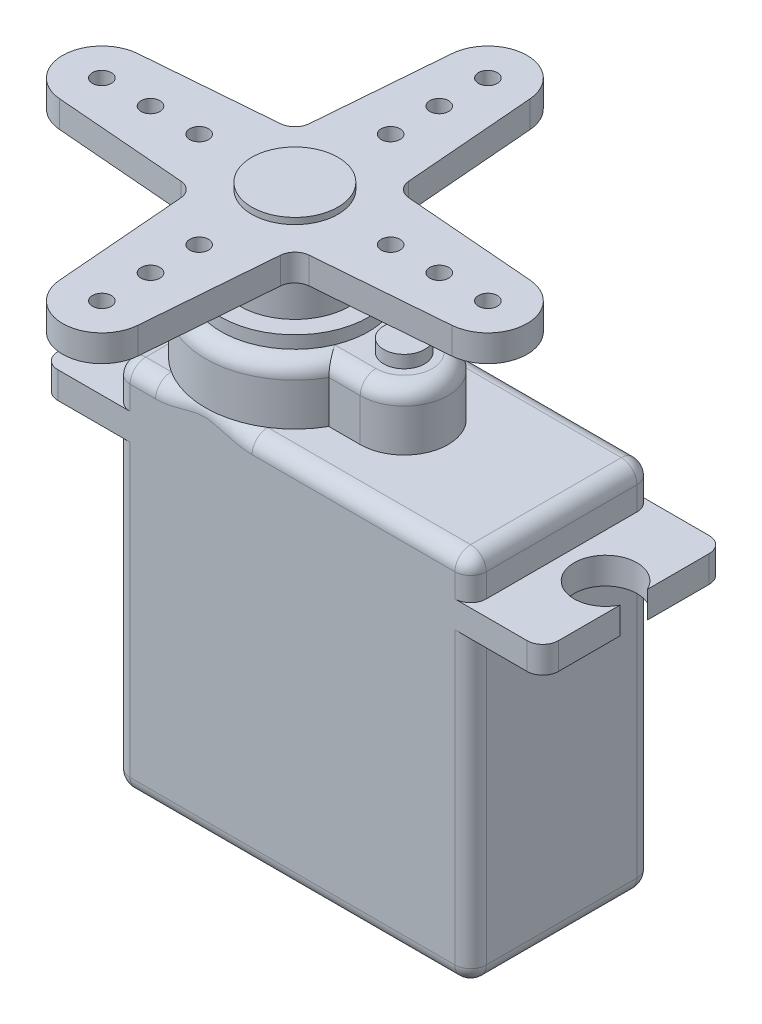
ISO-10303-21;
HEADER;
FILE_DESCRIPTION(('STEP AP214'),'2;1');
FILE_NAME('part.step','',(''),(''),'','','');
FILE_SCHEMA(('AUTOMOTIVE_DESIGN { 1 0 10303 214 1 1 1 1 }'));
ENDSEC;
DATA;
#1=APPLICATION_CONTEXT('core data for automotive mechanical design processes');
#2=APPLICATION_PROTOCOL_DEFINITION('international standard','automotive_design',2000,#1);
#3=PRODUCT_CONTEXT('',#1,'mechanical');
#4=PRODUCT('Part','Part','',(#3));
#5=PRODUCT_RELATED_PRODUCT_CATEGORY('part','',(#4));
#6=PRODUCT_DEFINITION_FORMATION('','',#4);
#7=PRODUCT_DEFINITION_CONTEXT('part definition',#1,'design');
#8=PRODUCT_DEFINITION('design','',#6,#7);
#9=PRODUCT_DEFINITION_SHAPE('','',#8);
#10=(LENGTH_UNIT() NAMED_UNIT(*) SI_UNIT(.MILLI.,.METRE.));
#11=(NAMED_UNIT(*) PLANE_ANGLE_UNIT() SI_UNIT($,.RADIAN.));
#12=(NAMED_UNIT(*) SI_UNIT($,.STERADIAN.) SOLID_ANGLE_UNIT());
#13=UNCERTAINTY_MEASURE_WITH_UNIT(LENGTH_MEASURE(1.E-05),#10,'distance_accuracy_value','');
#14=(GEOMETRIC_REPRESENTATION_CONTEXT(3) GLOBAL_UNCERTAINTY_ASSIGNED_CONTEXT((#13)) GLOBAL_UNIT_ASSIGNED_CONTEXT((#10,
#11,#12)) REPRESENTATION_CONTEXT('',''));
#15=CARTESIAN_POINT('',(0.,0.,0.));
#16=DIRECTION('',(0.,0.,1.));
#17=DIRECTION('',(1.,0.,0.));
#18=AXIS2_PLACEMENT_3D('',#15,#16,#17);
#19=CARTESIAN_POINT('',(-6.6,32.9,0.));
#20=DIRECTION('',(0.,1.,0.));
#21=DIRECTION('',(0.,0.,1.));
#22=AXIS2_PLACEMENT_3D('',#19,#20,#21);
#23=PLANE('',#22);
#24=CARTESIAN_POINT('',(5.7,32.9,-6.1));
#25=DIRECTION('',(0.,1.,0.));
#26=DIRECTION('',(0.,0.,1.));
#27=AXIS2_PLACEMENT_3D('',#24,#25,#26);
#28=CIRCLE('',#27,0.6);
#29=CARTESIAN_POINT('',(5.7,32.9,-5.5));
#30=VERTEX_POINT('',#29);
#31=EDGE_CURVE('E470',#30,#30,#28,.T.);
#32=ORIENTED_EDGE('',*,*,#31,.F.);
#33=EDGE_LOOP('',(#32));
#34=FACE_BOUND('',#33,.T.);
#35=CARTESIAN_POINT('',(5.7,32.9,-12.3));
#36=DIRECTION('',(0.,1.,0.));
#37=DIRECTION('',(0.,0.,1.));
#38=AXIS2_PLACEMENT_3D('',#35,#36,#37);
#39=CIRCLE('',#38,0.6);
#40=CARTESIAN_POINT('',(5.7,32.9,-11.7));
#41=VERTEX_POINT('',#40);
#42=EDGE_CURVE('E458',#41,#41,#39,.T.);
#43=ORIENTED_EDGE('',*,*,#42,.F.);
#44=EDGE_LOOP('',(#43));
#45=FACE_BOUND('',#44,.T.);
#46=CARTESIAN_POINT('',(5.7,32.9,9.2));
#47=DIRECTION('',(0.,1.,0.));
#48=DIRECTION('',(0.,0.,1.));
#49=AXIS2_PLACEMENT_3D('',#46,#47,#48);
#50=CIRCLE('',#49,0.6);
#51=CARTESIAN_POINT('',(5.7,32.9,9.8));
#52=VERTEX_POINT('',#51);
#53=EDGE_CURVE('E446',#52,#52,#50,.T.);
#54=ORIENTED_EDGE('',*,*,#53,.F.);
#55=EDGE_LOOP('',(#54));
#56=FACE_BOUND('',#55,.T.);
#57=CARTESIAN_POINT('',(-0.4,32.9,0.));
#58=DIRECTION('',(0.,1.,0.));
#59=DIRECTION('',(0.,0.,1.));
#60=AXIS2_PLACEMENT_3D('',#57,#58,#59);
#61=CIRCLE('',#60,0.6);
#62=CARTESIAN_POINT('',(-0.4,32.9,0.6));
#63=VERTEX_POINT('',#62);
#64=EDGE_CURVE('E434',#63,#63,#61,.T.);
#65=ORIENTED_EDGE('',*,*,#64,.F.);
#66=EDGE_LOOP('',(#65));
#67=FACE_BOUND('',#66,.T.);
#68=CARTESIAN_POINT('',(-6.6,32.9,0.));
#69=DIRECTION('',(0.,1.,0.));
#70=DIRECTION('',(0.,0.,1.));
#71=AXIS2_PLACEMENT_3D('',#68,#69,#70);
#72=CIRCLE('',#71,0.6);
#73=CARTESIAN_POINT('',(-6.6,32.9,0.6));
#74=VERTEX_POINT('',#73);
#75=EDGE_CURVE('E422',#74,#74,#72,.T.);
#76=ORIENTED_EDGE('',*,*,#75,.F.);
#77=EDGE_LOOP('',(#76));
#78=FACE_BOUND('',#77,.T.);
#79=CARTESIAN_POINT('',(14.9,32.9,0.));
#80=DIRECTION('',(0.,1.,0.));
#81=DIRECTION('',(0.,0.,1.));
#82=AXIS2_PLACEMENT_3D('',#79,#80,#81);
#83=CIRCLE('',#82,0.600000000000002);
#84=CARTESIAN_POINT('',(14.9,32.9,0.600000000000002));
#85=VERTEX_POINT('',#84);
#86=EDGE_CURVE('E410',#85,#85,#83,.T.);
#87=ORIENTED_EDGE('',*,*,#86,.F.);
#88=EDGE_LOOP('',(#87));
#89=FACE_BOUND('',#88,.T.);
#90=CARTESIAN_POINT('',(-6.6,32.9,0.));
#91=DIRECTION('',(0.,1.,0.));
#92=DIRECTION('',(0.,0.,1.));
#93=AXIS2_PLACEMENT_3D('',#90,#91,#92);
#94=CIRCLE('',#93,2.5);
#95=CARTESIAN_POINT('',(-6.80095020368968,32.9,-2.49191071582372));
#96=VERTEX_POINT('',#95);
#97=CARTESIAN_POINT('',(-6.80095020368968,32.9,2.49191071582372));
#98=VERTEX_POINT('',#97);
#99=EDGE_CURVE('E226',#96,#98,#94,.T.);
#100=ORIENTED_EDGE('',*,*,#99,.T.);
#101=DIRECTION('',(0.996764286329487,0.,0.0803800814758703));
#102=VECTOR('',#101,1.);
#103=CARTESIAN_POINT('',(1.61318101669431,32.9,3.17043477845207));
#104=LINE('',#103,#102);
#105=CARTESIAN_POINT('',(1.61318101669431,32.9,3.17043477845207));
#106=VERTEX_POINT('',#105);
#107=EDGE_CURVE('E134',#98,#106,#104,.T.);
#108=ORIENTED_EDGE('',*,*,#107,.T.);
#109=CARTESIAN_POINT('',(1.53280093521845,32.9,4.16719906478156));
#110=DIRECTION('',(0.,-1.,0.));
#111=DIRECTION('',(0.,0.,1.));
#112=AXIS2_PLACEMENT_3D('',#109,#110,#111);
#113=CIRCLE('',#112,1.);
#114=CARTESIAN_POINT('',(2.52956522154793,32.9,4.08681898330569));
#115=VERTEX_POINT('',#114);
#116=EDGE_CURVE('E357',#106,#115,#113,.T.);
#117=ORIENTED_EDGE('',*,*,#116,.T.);
#118=DIRECTION('',(0.0803800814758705,0.,0.996764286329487));
#119=VECTOR('',#118,1.);
#120=CARTESIAN_POINT('',(3.20808928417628,32.9,12.5009502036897));
#121=LINE('',#120,#119);
#122=CARTESIAN_POINT('',(3.20808928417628,32.9,12.5009502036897));
#123=VERTEX_POINT('',#122);
#124=EDGE_CURVE('E359',#115,#123,#121,.T.);
#125=ORIENTED_EDGE('',*,*,#124,.T.);
#126=CARTESIAN_POINT('',(5.7,32.9,12.3));
#127=DIRECTION('',(0.,1.,0.));
#128=DIRECTION('',(0.,0.,-1.));
#129=AXIS2_PLACEMENT_3D('',#126,#127,#128);
#130=CIRCLE('',#129,2.5);
#131=CARTESIAN_POINT('',(8.19191071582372,32.9,12.5009502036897));
#132=VERTEX_POINT('',#131);
#133=EDGE_CURVE('E361',#123,#132,#130,.T.);
#134=ORIENTED_EDGE('',*,*,#133,.T.);
#135=DIRECTION('',(0.0803800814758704,0.,-0.996764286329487));
#136=VECTOR('',#135,1.);
#137=CARTESIAN_POINT('',(8.87043477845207,32.9,4.08681898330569));
#138=LINE('',#137,#136);
#139=CARTESIAN_POINT('',(8.87043477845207,32.9,4.08681898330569));
#140=VERTEX_POINT('',#139);
#141=EDGE_CURVE('E367',#132,#140,#138,.T.);
#142=ORIENTED_EDGE('',*,*,#141,.T.);
#143=CARTESIAN_POINT('',(9.86719906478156,32.9,4.16719906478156));
#144=DIRECTION('',(0.,-1.,0.));
#145=DIRECTION('',(0.,0.,1.));
#146=AXIS2_PLACEMENT_3D('',#143,#144,#145);
#147=CIRCLE('',#146,1.);
#148=CARTESIAN_POINT('',(9.78681898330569,32.9,3.17043477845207));
#149=VERTEX_POINT('',#148);
#150=EDGE_CURVE('E369',#140,#149,#147,.T.);
#151=ORIENTED_EDGE('',*,*,#150,.T.);
#152=DIRECTION('',(0.996764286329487,0.,-0.0803800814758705));
#153=VECTOR('',#152,1.);
#154=CARTESIAN_POINT('',(18.2009502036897,32.9,2.49191071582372));
#155=LINE('',#154,#153);
#156=CARTESIAN_POINT('',(18.2009502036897,32.9,2.49191071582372));
#157=VERTEX_POINT('',#156);
#158=EDGE_CURVE('E371',#149,#157,#155,.T.);
#159=ORIENTED_EDGE('',*,*,#158,.T.);
#160=CARTESIAN_POINT('',(18.,32.9,0.));
#161=DIRECTION('',(0.,1.,0.));
#162=DIRECTION('',(0.,0.,-1.));
#163=AXIS2_PLACEMENT_3D('',#160,#161,#162);
#164=CIRCLE('',#163,2.5);
#165=CARTESIAN_POINT('',(18.2009502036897,32.9,-2.49191071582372));
#166=VERTEX_POINT('',#165);
#167=EDGE_CURVE('E373',#157,#166,#164,.T.);
#168=ORIENTED_EDGE('',*,*,#167,.T.);
#169=DIRECTION('',(-0.996764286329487,0.,-0.0803800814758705));
#170=VECTOR('',#169,1.);
#171=CARTESIAN_POINT('',(9.78681898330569,32.9,-3.17043477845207));
#172=LINE('',#171,#170);
#173=CARTESIAN_POINT('',(9.78681898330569,32.9,-3.17043477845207));
#174=VERTEX_POINT('',#173);
#175=EDGE_CURVE('E375',#166,#174,#172,.T.);
#176=ORIENTED_EDGE('',*,*,#175,.T.);
#177=CARTESIAN_POINT('',(9.86719906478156,32.9,-4.16719906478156));
#178=DIRECTION('',(0.,-1.,0.));
#179=DIRECTION('',(0.,0.,1.));
#180=AXIS2_PLACEMENT_3D('',#177,#178,#179);
#181=CIRCLE('',#180,1.);
#182=CARTESIAN_POINT('',(8.87043477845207,32.9,-4.08681898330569));
#183=VERTEX_POINT('',#182);
#184=EDGE_CURVE('E377',#174,#183,#181,.T.);
#185=ORIENTED_EDGE('',*,*,#184,.T.);
#186=DIRECTION('',(-0.0803800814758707,0.,-0.996764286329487));
#187=VECTOR('',#186,1.);
#188=CARTESIAN_POINT('',(8.19191071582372,32.9,-12.5009502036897));
#189=LINE('',#188,#187);
#190=CARTESIAN_POINT('',(8.19191071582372,32.9,-12.5009502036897));
#191=VERTEX_POINT('',#190);
#192=EDGE_CURVE('E379',#183,#191,#189,.T.);
#193=ORIENTED_EDGE('',*,*,#192,.T.);
#194=CARTESIAN_POINT('',(5.7,32.9,-12.3));
#195=DIRECTION('',(0.,1.,0.));
#196=DIRECTION('',(0.,0.,-1.));
#197=AXIS2_PLACEMENT_3D('',#194,#195,#196);
#198=CIRCLE('',#197,2.5);
#199=CARTESIAN_POINT('',(3.20808928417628,32.9,-12.5009502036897));
#200=VERTEX_POINT('',#199);
#201=EDGE_CURVE('E177',#191,#200,#198,.T.);
#202=ORIENTED_EDGE('',*,*,#201,.T.);
#203=DIRECTION('',(-0.0803800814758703,0.,0.996764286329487));
#204=VECTOR('',#203,1.);
#205=CARTESIAN_POINT('',(3.20808928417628,32.9,-12.5009502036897));
#206=LINE('',#205,#204);
#207=CARTESIAN_POINT('',(2.52956522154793,32.9,-4.08681898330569));
#208=VERTEX_POINT('',#207);
#209=EDGE_CURVE('E171',#200,#208,#206,.T.);
#210=ORIENTED_EDGE('',*,*,#209,.T.);
#211=CARTESIAN_POINT('',(1.53280093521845,32.9,-4.16719906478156));
#212=DIRECTION('',(0.,-1.,0.));
#213=DIRECTION('',(0.,0.,1.));
#214=AXIS2_PLACEMENT_3D('',#211,#212,#213);
#215=CIRCLE('',#214,1.);
#216=CARTESIAN_POINT('',(1.61318101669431,32.9,-3.17043477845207));
#217=VERTEX_POINT('',#216);
#218=EDGE_CURVE('E175',#208,#217,#215,.T.);
#219=ORIENTED_EDGE('',*,*,#218,.T.);
#220=DIRECTION('',(-0.996764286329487,0.,0.0803800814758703));
#221=VECTOR('',#220,1.);
#222=CARTESIAN_POINT('',(1.61318101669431,32.9,-3.17043477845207));
#223=LINE('',#222,#221);
#224=EDGE_CURVE('E66',#217,#96,#223,.T.);
#225=ORIENTED_EDGE('',*,*,#224,.T.);
#226=EDGE_LOOP('',(#100,#108,#117,#125,#134,#142,#151,#159,#168,#176,#185,#193,#202,#210,#219,#225));
#227=FACE_BOUND('',#226,.T.);
#228=CARTESIAN_POINT('',(18.,32.9,0.));
#229=DIRECTION('',(0.,1.,0.));
#230=DIRECTION('',(0.,0.,1.));
#231=AXIS2_PLACEMENT_3D('',#228,#229,#230);
#232=CIRCLE('',#231,0.6);
#233=CARTESIAN_POINT('',(18.,32.9,0.6));
#234=VERTEX_POINT('',#233);
#235=EDGE_CURVE('E199',#234,#234,#232,.T.);
#236=ORIENTED_EDGE('',*,*,#235,.F.);
#237=EDGE_LOOP('',(#236));
#238=FACE_BOUND('',#237,.T.);
#239=CARTESIAN_POINT('',(11.8,32.9,0.));
#240=DIRECTION('',(0.,1.,0.));
#241=DIRECTION('',(0.,0.,1.));
#242=AXIS2_PLACEMENT_3D('',#239,#240,#241);
#243=CIRCLE('',#242,0.6);
#244=CARTESIAN_POINT('',(11.8,32.9,0.6));
#245=VERTEX_POINT('',#244);
#246=EDGE_CURVE('E416',#245,#245,#243,.T.);
#247=ORIENTED_EDGE('',*,*,#246,.F.);
#248=EDGE_LOOP('',(#247));
#249=FACE_BOUND('',#248,.T.);
#250=CARTESIAN_POINT('',(-3.5,32.9,0.));
#251=DIRECTION('',(0.,1.,0.));
#252=DIRECTION('',(0.,0.,1.));
#253=AXIS2_PLACEMENT_3D('',#250,#251,#252);
#254=CIRCLE('',#253,0.6);
#255=CARTESIAN_POINT('',(-3.5,32.9,0.6));
#256=VERTEX_POINT('',#255);
#257=EDGE_CURVE('E428',#256,#256,#254,.T.);
#258=ORIENTED_EDGE('',*,*,#257,.F.);
#259=EDGE_LOOP('',(#258));
#260=FACE_BOUND('',#259,.T.);
#261=CARTESIAN_POINT('',(5.7,32.9,12.3));
#262=DIRECTION('',(0.,1.,0.));
#263=DIRECTION('',(0.,0.,1.));
#264=AXIS2_PLACEMENT_3D('',#261,#262,#263);
#265=CIRCLE('',#264,0.6);
#266=CARTESIAN_POINT('',(5.7,32.9,12.9));
#267=VERTEX_POINT('',#266);
#268=EDGE_CURVE('E440',#267,#267,#265,.T.);
#269=ORIENTED_EDGE('',*,*,#268,.F.);
#270=EDGE_LOOP('',(#269));
#271=FACE_BOUND('',#270,.T.);
#272=CARTESIAN_POINT('',(5.7,32.9,6.1));
#273=DIRECTION('',(0.,1.,0.));
#274=DIRECTION('',(0.,0.,1.));
#275=AXIS2_PLACEMENT_3D('',#272,#273,#274);
#276=CIRCLE('',#275,0.6);
#277=CARTESIAN_POINT('',(5.7,32.9,6.7));
#278=VERTEX_POINT('',#277);
#279=EDGE_CURVE('E452',#278,#278,#276,.T.);
#280=ORIENTED_EDGE('',*,*,#279,.F.);
#281=EDGE_LOOP('',(#280));
#282=FACE_BOUND('',#281,.T.);
#283=CARTESIAN_POINT('',(5.7,32.9,-9.2));
#284=DIRECTION('',(0.,1.,0.));
#285=DIRECTION('',(0.,0.,1.));
#286=AXIS2_PLACEMENT_3D('',#283,#284,#285);
#287=CIRCLE('',#286,0.6);
#288=CARTESIAN_POINT('',(5.7,32.9,-8.6));
#289=VERTEX_POINT('',#288);
#290=EDGE_CURVE('E464',#289,#289,#287,.T.);
#291=ORIENTED_EDGE('',*,*,#290,.F.);
#292=EDGE_LOOP('',(#291));
#293=FACE_BOUND('',#292,.T.);
#294=CARTESIAN_POINT('',(5.7,32.9,0.));
#295=DIRECTION('',(0.,1.,0.));
#296=DIRECTION('',(0.,0.,1.));
#297=AXIS2_PLACEMENT_3D('',#294,#295,#296);
#298=CIRCLE('',#297,2.75);
#299=CARTESIAN_POINT('',(5.7,32.9,2.75));
#300=VERTEX_POINT('',#299);
#301=EDGE_CURVE('E479',#300,#300,#298,.T.);
#302=ORIENTED_EDGE('',*,*,#301,.F.);
#303=EDGE_LOOP('',(#302));
#304=FACE_BOUND('',#303,.T.);
#305=ADVANCED_FACE('F49',(#34,#45,#56,#67,#78,#89,#227,#238,#249,#260,#271,#282,#293,#304),#23,.T.);
#306=CARTESIAN_POINT('',(5.7,31.2,0.));
#307=DIRECTION('',(0.,-1.,0.));
#308=DIRECTION('',(0.,0.,-1.));
#309=AXIS2_PLACEMENT_3D('',#306,#307,#308);
#310=CYLINDRICAL_SURFACE('',#309,3.5);
#311=CARTESIAN_POINT('',(5.7,31.2,0.));
#312=DIRECTION('',(0.,1.,0.));
#313=DIRECTION('',(0.,0.,1.));
#314=AXIS2_PLACEMENT_3D('',#311,#312,#313);
#315=CIRCLE('',#314,3.5);
#316=CARTESIAN_POINT('',(5.7,31.2,3.5));
#317=VERTEX_POINT('',#316);
#318=EDGE_CURVE('E12',#317,#317,#315,.T.);
#319=ORIENTED_EDGE('',*,*,#318,.F.);
#320=EDGE_LOOP('',(#319));
#321=FACE_BOUND('',#320,.T.);
#322=CARTESIAN_POINT('',(5.7,28.2,0.));
#323=DIRECTION('',(0.,1.,0.));
#324=DIRECTION('',(0.,0.,1.));
#325=AXIS2_PLACEMENT_3D('',#322,#323,#324);
#326=CIRCLE('',#325,3.5);
#327=CARTESIAN_POINT('',(5.7,28.2,3.5));
#328=VERTEX_POINT('',#327);
#329=EDGE_CURVE('E53',#328,#328,#326,.T.);
#330=ORIENTED_EDGE('',*,*,#329,.T.);
#331=EDGE_LOOP('',(#330));
#332=FACE_BOUND('',#331,.T.);
#333=ADVANCED_FACE('F51',(#321,#332),#310,.T.);
#334=CARTESIAN_POINT('',(5.7,28.2,0.));
#335=DIRECTION('',(0.,1.,0.));
#336=DIRECTION('',(0.,0.,1.));
#337=AXIS2_PLACEMENT_3D('',#334,#335,#336);
#338=PLANE('',#337);
#339=ORIENTED_EDGE('',*,*,#329,.F.);
#340=EDGE_LOOP('',(#339));
#341=FACE_BOUND('',#340,.T.);
#342=ADVANCED_FACE('F269',(#341),#338,.F.);
#343=CARTESIAN_POINT('',(-6.6,31.2,0.));
#344=DIRECTION('',(0.,1.,0.));
#345=DIRECTION('',(0.,0.,1.));
#346=AXIS2_PLACEMENT_3D('',#343,#344,#345);
#347=PLANE('',#346);
#348=CARTESIAN_POINT('',(5.7,31.2,-6.1));
#349=DIRECTION('',(0.,1.,0.));
#350=DIRECTION('',(0.,0.,1.));
#351=AXIS2_PLACEMENT_3D('',#348,#349,#350);
#352=CIRCLE('',#351,0.6);
#353=CARTESIAN_POINT('',(5.7,31.2,-5.5));
#354=VERTEX_POINT('',#353);
#355=EDGE_CURVE('E473',#354,#354,#352,.T.);
#356=ORIENTED_EDGE('',*,*,#355,.T.);
#357=EDGE_LOOP('',(#356));
#358=FACE_BOUND('',#357,.T.);
#359=CARTESIAN_POINT('',(5.7,31.2,-12.3));
#360=DIRECTION('',(0.,1.,0.));
#361=DIRECTION('',(0.,0.,1.));
#362=AXIS2_PLACEMENT_3D('',#359,#360,#361);
#363=CIRCLE('',#362,0.6);
#364=CARTESIAN_POINT('',(5.7,31.2,-11.7));
#365=VERTEX_POINT('',#364);
#366=EDGE_CURVE('E461',#365,#365,#363,.T.);
#367=ORIENTED_EDGE('',*,*,#366,.T.);
#368=EDGE_LOOP('',(#367));
#369=FACE_BOUND('',#368,.T.);
#370=CARTESIAN_POINT('',(5.7,31.2,9.2));
#371=DIRECTION('',(0.,1.,0.));
#372=DIRECTION('',(0.,0.,1.));
#373=AXIS2_PLACEMENT_3D('',#370,#371,#372);
#374=CIRCLE('',#373,0.6);
#375=CARTESIAN_POINT('',(5.7,31.2,9.8));
#376=VERTEX_POINT('',#375);
#377=EDGE_CURVE('E449',#376,#376,#374,.T.);
#378=ORIENTED_EDGE('',*,*,#377,.T.);
#379=EDGE_LOOP('',(#378));
#380=FACE_BOUND('',#379,.T.);
#381=CARTESIAN_POINT('',(-0.4,31.2,0.));
#382=DIRECTION('',(0.,1.,0.));
#383=DIRECTION('',(0.,0.,1.));
#384=AXIS2_PLACEMENT_3D('',#381,#382,#383);
#385=CIRCLE('',#384,0.6);
#386=CARTESIAN_POINT('',(-0.4,31.2,0.6));
#387=VERTEX_POINT('',#386);
#388=EDGE_CURVE('E437',#387,#387,#385,.T.);
#389=ORIENTED_EDGE('',*,*,#388,.T.);
#390=EDGE_LOOP('',(#389));
#391=FACE_BOUND('',#390,.T.);
#392=CARTESIAN_POINT('',(-6.6,31.2,0.));
#393=DIRECTION('',(0.,1.,0.));
#394=DIRECTION('',(0.,0.,1.));
#395=AXIS2_PLACEMENT_3D('',#392,#393,#394);
#396=CIRCLE('',#395,0.6);
#397=CARTESIAN_POINT('',(-6.6,31.2,0.6));
#398=VERTEX_POINT('',#397);
#399=EDGE_CURVE('E425',#398,#398,#396,.T.);
#400=ORIENTED_EDGE('',*,*,#399,.T.);
#401=EDGE_LOOP('',(#400));
#402=FACE_BOUND('',#401,.T.);
#403=CARTESIAN_POINT('',(14.9,31.2,0.));
#404=DIRECTION('',(0.,1.,0.));
#405=DIRECTION('',(0.,0.,1.));
#406=AXIS2_PLACEMENT_3D('',#403,#404,#405);
#407=CIRCLE('',#406,0.600000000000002);
#408=CARTESIAN_POINT('',(14.9,31.2,0.600000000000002));
#409=VERTEX_POINT('',#408);
#410=EDGE_CURVE('E413',#409,#409,#407,.T.);
#411=ORIENTED_EDGE('',*,*,#410,.T.);
#412=EDGE_LOOP('',(#411));
#413=FACE_BOUND('',#412,.T.);
#414=CARTESIAN_POINT('',(-6.6,31.2,0.));
#415=DIRECTION('',(0.,1.,0.));
#416=DIRECTION('',(0.,0.,1.));
#417=AXIS2_PLACEMENT_3D('',#414,#415,#416);
#418=CIRCLE('',#417,2.5);
#419=CARTESIAN_POINT('',(-6.80095020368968,31.2,-2.49191071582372));
#420=VERTEX_POINT('',#419);
#421=CARTESIAN_POINT('',(-6.80095020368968,31.2,2.49191071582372));
#422=VERTEX_POINT('',#421);
#423=EDGE_CURVE('E195',#420,#422,#418,.T.);
#424=ORIENTED_EDGE('',*,*,#423,.F.);
#425=DIRECTION('',(-0.996764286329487,0.,0.0803800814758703));
#426=VECTOR('',#425,1.);
#427=CARTESIAN_POINT('',(1.61318101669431,31.2,-3.17043477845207));
#428=LINE('',#427,#426);
#429=CARTESIAN_POINT('',(1.61318101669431,31.2,-3.17043477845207));
#430=VERTEX_POINT('',#429);
#431=EDGE_CURVE('E125',#430,#420,#428,.T.);
#432=ORIENTED_EDGE('',*,*,#431,.F.);
#433=CARTESIAN_POINT('',(1.53280093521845,31.2,-4.16719906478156));
#434=DIRECTION('',(0.,-1.,0.));
#435=DIRECTION('',(0.,0.,1.));
#436=AXIS2_PLACEMENT_3D('',#433,#434,#435);
#437=CIRCLE('',#436,1.);
#438=CARTESIAN_POINT('',(2.52956522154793,31.2,-4.08681898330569));
#439=VERTEX_POINT('',#438);
#440=EDGE_CURVE('E119',#439,#430,#437,.T.);
#441=ORIENTED_EDGE('',*,*,#440,.F.);
#442=DIRECTION('',(-0.0803800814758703,0.,0.996764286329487));
#443=VECTOR('',#442,1.);
#444=CARTESIAN_POINT('',(3.20808928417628,31.2,-12.5009502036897));
#445=LINE('',#444,#443);
#446=CARTESIAN_POINT('',(3.20808928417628,31.2,-12.5009502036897));
#447=VERTEX_POINT('',#446);
#448=EDGE_CURVE('E185',#447,#439,#445,.T.);
#449=ORIENTED_EDGE('',*,*,#448,.F.);
#450=CARTESIAN_POINT('',(5.7,31.2,-12.3));
#451=DIRECTION('',(0.,1.,0.));
#452=DIRECTION('',(0.,0.,-1.));
#453=AXIS2_PLACEMENT_3D('',#450,#451,#452);
#454=CIRCLE('',#453,2.5);
#455=CARTESIAN_POINT('',(8.19191071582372,31.2,-12.5009502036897));
#456=VERTEX_POINT('',#455);
#457=EDGE_CURVE('E221',#456,#447,#454,.T.);
#458=ORIENTED_EDGE('',*,*,#457,.F.);
#459=DIRECTION('',(-0.0803800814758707,0.,-0.996764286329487));
#460=VECTOR('',#459,1.);
#461=CARTESIAN_POINT('',(8.19191071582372,31.2,-12.5009502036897));
#462=LINE('',#461,#460);
#463=CARTESIAN_POINT('',(8.87043477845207,31.2,-4.08681898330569));
#464=VERTEX_POINT('',#463);
#465=EDGE_CURVE('E219',#464,#456,#462,.T.);
#466=ORIENTED_EDGE('',*,*,#465,.F.);
#467=CARTESIAN_POINT('',(9.86719906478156,31.2,-4.16719906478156));
#468=DIRECTION('',(0.,-1.,0.));
#469=DIRECTION('',(0.,0.,1.));
#470=AXIS2_PLACEMENT_3D('',#467,#468,#469);
#471=CIRCLE('',#470,1.);
#472=CARTESIAN_POINT('',(9.78681898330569,31.2,-3.17043477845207));
#473=VERTEX_POINT('',#472);
#474=EDGE_CURVE('E217',#473,#464,#471,.T.);
#475=ORIENTED_EDGE('',*,*,#474,.F.);
#476=DIRECTION('',(-0.996764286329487,0.,-0.0803800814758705));
#477=VECTOR('',#476,1.);
#478=CARTESIAN_POINT('',(9.78681898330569,31.2,-3.17043477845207));
#479=LINE('',#478,#477);
#480=CARTESIAN_POINT('',(18.2009502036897,31.2,-2.49191071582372));
#481=VERTEX_POINT('',#480);
#482=EDGE_CURVE('E215',#481,#473,#479,.T.);
#483=ORIENTED_EDGE('',*,*,#482,.F.);
#484=CARTESIAN_POINT('',(18.,31.2,0.));
#485=DIRECTION('',(0.,1.,0.));
#486=DIRECTION('',(0.,0.,-1.));
#487=AXIS2_PLACEMENT_3D('',#484,#485,#486);
#488=CIRCLE('',#487,2.5);
#489=CARTESIAN_POINT('',(18.2009502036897,31.2,2.49191071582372));
#490=VERTEX_POINT('',#489);
#491=EDGE_CURVE('E213',#490,#481,#488,.T.);
#492=ORIENTED_EDGE('',*,*,#491,.F.);
#493=DIRECTION('',(0.996764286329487,0.,-0.0803800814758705));
#494=VECTOR('',#493,1.);
#495=CARTESIAN_POINT('',(18.2009502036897,31.2,2.49191071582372));
#496=LINE('',#495,#494);
#497=CARTESIAN_POINT('',(9.78681898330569,31.2,3.17043477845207));
#498=VERTEX_POINT('',#497);
#499=EDGE_CURVE('E211',#498,#490,#496,.T.);
#500=ORIENTED_EDGE('',*,*,#499,.F.);
#501=CARTESIAN_POINT('',(9.86719906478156,31.2,4.16719906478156));
#502=DIRECTION('',(0.,-1.,0.));
#503=DIRECTION('',(0.,0.,1.));
#504=AXIS2_PLACEMENT_3D('',#501,#502,#503);
#505=CIRCLE('',#504,1.);
#506=CARTESIAN_POINT('',(8.87043477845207,31.2,4.08681898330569));
#507=VERTEX_POINT('',#506);
#508=EDGE_CURVE('E209',#507,#498,#505,.T.);
#509=ORIENTED_EDGE('',*,*,#508,.F.);
#510=DIRECTION('',(0.0803800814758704,0.,-0.996764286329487));
#511=VECTOR('',#510,1.);
#512=CARTESIAN_POINT('',(8.87043477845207,31.2,4.08681898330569));
#513=LINE('',#512,#511);
#514=CARTESIAN_POINT('',(8.19191071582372,31.2,12.5009502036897));
#515=VERTEX_POINT('',#514);
#516=EDGE_CURVE('E207',#515,#507,#513,.T.);
#517=ORIENTED_EDGE('',*,*,#516,.F.);
#518=CARTESIAN_POINT('',(5.7,31.2,12.3));
#519=DIRECTION('',(0.,1.,0.));
#520=DIRECTION('',(0.,0.,-1.));
#521=AXIS2_PLACEMENT_3D('',#518,#519,#520);
#522=CIRCLE('',#521,2.5);
#523=CARTESIAN_POINT('',(3.20808928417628,31.2,12.5009502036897));
#524=VERTEX_POINT('',#523);
#525=EDGE_CURVE('E205',#524,#515,#522,.T.);
#526=ORIENTED_EDGE('',*,*,#525,.F.);
#527=DIRECTION('',(0.0803800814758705,0.,0.996764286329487));
#528=VECTOR('',#527,1.);
#529=CARTESIAN_POINT('',(3.20808928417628,31.2,12.5009502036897));
#530=LINE('',#529,#528);
#531=CARTESIAN_POINT('',(2.52956522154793,31.2,4.08681898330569));
#532=VERTEX_POINT('',#531);
#533=EDGE_CURVE('E203',#532,#524,#530,.T.);
#534=ORIENTED_EDGE('',*,*,#533,.F.);
#535=CARTESIAN_POINT('',(1.53280093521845,31.2,4.16719906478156));
#536=DIRECTION('',(0.,-1.,0.));
#537=DIRECTION('',(0.,0.,1.));
#538=AXIS2_PLACEMENT_3D('',#535,#536,#537);
#539=CIRCLE('',#538,1.);
#540=CARTESIAN_POINT('',(1.61318101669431,31.2,3.17043477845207));
#541=VERTEX_POINT('',#540);
#542=EDGE_CURVE('E201',#541,#532,#539,.T.);
#543=ORIENTED_EDGE('',*,*,#542,.F.);
#544=DIRECTION('',(0.996764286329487,0.,0.0803800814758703));
#545=VECTOR('',#544,1.);
#546=CARTESIAN_POINT('',(1.61318101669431,31.2,3.17043477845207));
#547=LINE('',#546,#545);
#548=EDGE_CURVE('E198',#422,#541,#547,.T.);
#549=ORIENTED_EDGE('',*,*,#548,.F.);
#550=EDGE_LOOP('',(#424,#432,#441,#449,#458,#466,#475,#483,#492,#500,#509,#517,#526,#534,#543,#549));
#551=FACE_BOUND('',#550,.T.);
#552=CARTESIAN_POINT('',(18.,31.2,0.));
#553=DIRECTION('',(0.,1.,0.));
#554=DIRECTION('',(0.,0.,1.));
#555=AXIS2_PLACEMENT_3D('',#552,#553,#554);
#556=CIRCLE('',#555,0.6);
#557=CARTESIAN_POINT('',(18.,31.2,0.6));
#558=VERTEX_POINT('',#557);
#559=EDGE_CURVE('E407',#558,#558,#556,.T.);
#560=ORIENTED_EDGE('',*,*,#559,.T.);
#561=EDGE_LOOP('',(#560));
#562=FACE_BOUND('',#561,.T.);
#563=CARTESIAN_POINT('',(11.8,31.2,0.));
#564=DIRECTION('',(0.,1.,0.));
#565=DIRECTION('',(0.,0.,1.));
#566=AXIS2_PLACEMENT_3D('',#563,#564,#565);
#567=CIRCLE('',#566,0.6);
#568=CARTESIAN_POINT('',(11.8,31.2,0.6));
#569=VERTEX_POINT('',#568);
#570=EDGE_CURVE('E419',#569,#569,#567,.T.);
#571=ORIENTED_EDGE('',*,*,#570,.T.);
#572=EDGE_LOOP('',(#571));
#573=FACE_BOUND('',#572,.T.);
#574=CARTESIAN_POINT('',(-3.5,31.2,0.));
#575=DIRECTION('',(0.,1.,0.));
#576=DIRECTION('',(0.,0.,1.));
#577=AXIS2_PLACEMENT_3D('',#574,#575,#576);
#578=CIRCLE('',#577,0.6);
#579=CARTESIAN_POINT('',(-3.5,31.2,0.6));
#580=VERTEX_POINT('',#579);
#581=EDGE_CURVE('E431',#580,#580,#578,.T.);
#582=ORIENTED_EDGE('',*,*,#581,.T.);
#583=EDGE_LOOP('',(#582));
#584=FACE_BOUND('',#583,.T.);
#585=CARTESIAN_POINT('',(5.7,31.2,12.3));
#586=DIRECTION('',(0.,1.,0.));
#587=DIRECTION('',(0.,0.,1.));
#588=AXIS2_PLACEMENT_3D('',#585,#586,#587);
#589=CIRCLE('',#588,0.6);
#590=CARTESIAN_POINT('',(5.7,31.2,12.9));
#591=VERTEX_POINT('',#590);
#592=EDGE_CURVE('E443',#591,#591,#589,.T.);
#593=ORIENTED_EDGE('',*,*,#592,.T.);
#594=EDGE_LOOP('',(#593));
#595=FACE_BOUND('',#594,.T.);
#596=CARTESIAN_POINT('',(5.7,31.2,6.1));
#597=DIRECTION('',(0.,1.,0.));
#598=DIRECTION('',(0.,0.,1.));
#599=AXIS2_PLACEMENT_3D('',#596,#597,#598);
#600=CIRCLE('',#599,0.6);
#601=CARTESIAN_POINT('',(5.7,31.2,6.7));
#602=VERTEX_POINT('',#601);
#603=EDGE_CURVE('E455',#602,#602,#600,.T.);
#604=ORIENTED_EDGE('',*,*,#603,.T.);
#605=EDGE_LOOP('',(#604));
#606=FACE_BOUND('',#605,.T.);
#607=CARTESIAN_POINT('',(5.7,31.2,-9.2));
#608=DIRECTION('',(0.,1.,0.));
#609=DIRECTION('',(0.,0.,1.));
#610=AXIS2_PLACEMENT_3D('',#607,#608,#609);
#611=CIRCLE('',#610,0.6);
#612=CARTESIAN_POINT('',(5.7,31.2,-8.6));
#613=VERTEX_POINT('',#612);
#614=EDGE_CURVE('E467',#613,#613,#611,.T.);
#615=ORIENTED_EDGE('',*,*,#614,.T.);
#616=EDGE_LOOP('',(#615));
#617=FACE_BOUND('',#616,.T.);
#618=ORIENTED_EDGE('',*,*,#318,.T.);
#619=EDGE_LOOP('',(#618));
#620=FACE_BOUND('',#619,.T.);
#621=ADVANCED_FACE('F271',(#358,#369,#380,#391,#402,#413,#551,#562,#573,#584,#595,#606,#617,
#620),#347,.F.);
#622=CARTESIAN_POINT('',(-6.6,32.9,0.));
#623=DIRECTION('',(0.,-1.,0.));
#624=DIRECTION('',(0.,0.,-1.));
#625=AXIS2_PLACEMENT_3D('',#622,#623,#624);
#626=CYLINDRICAL_SURFACE('',#625,2.5);
#627=ORIENTED_EDGE('',*,*,#423,.T.);
#628=DIRECTION('',(0.,-1.,0.));
#629=VECTOR('',#628,1.);
#630=CARTESIAN_POINT('',(-6.80095020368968,32.9,2.49191071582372));
#631=LINE('',#630,#629);
#632=EDGE_CURVE('E263',#98,#422,#631,.T.);
#633=ORIENTED_EDGE('',*,*,#632,.F.);
#634=ORIENTED_EDGE('',*,*,#99,.F.);
#635=DIRECTION('',(0.,-1.,0.));
#636=VECTOR('',#635,1.);
#637=CARTESIAN_POINT('',(-6.80095020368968,32.9,-2.49191071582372));
#638=LINE('',#637,#636);
#639=EDGE_CURVE('E191',#96,#420,#638,.T.);
#640=ORIENTED_EDGE('',*,*,#639,.T.);
#641=EDGE_LOOP('',(#627,#633,#634,#640));
#642=FACE_BOUND('',#641,.T.);
#643=ADVANCED_FACE('F276',(#642),#626,.T.);
#644=CARTESIAN_POINT('',(1.61318101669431,32.9,3.17043477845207));
#645=DIRECTION('',(0.0803800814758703,0.,-0.996764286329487));
#646=DIRECTION('',(-0.996764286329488,0.,-0.0803800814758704));
#647=AXIS2_PLACEMENT_3D('',#644,#645,#646);
#648=PLANE('',#647);
#649=ORIENTED_EDGE('',*,*,#548,.T.);
#650=DIRECTION('',(0.,-1.,0.));
#651=VECTOR('',#650,1.);
#652=CARTESIAN_POINT('',(1.61318101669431,32.9,3.17043477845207));
#653=LINE('',#652,#651);
#654=EDGE_CURVE('E260',#106,#541,#653,.T.);
#655=ORIENTED_EDGE('',*,*,#654,.F.);
#656=ORIENTED_EDGE('',*,*,#107,.F.);
#657=ORIENTED_EDGE('',*,*,#632,.T.);
#658=EDGE_LOOP('',(#649,#655,#656,#657));
#659=FACE_BOUND('',#658,.T.);
#660=ADVANCED_FACE('F342',(#659),#648,.F.);
#661=CARTESIAN_POINT('',(1.53280093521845,32.9,4.16719906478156));
#662=DIRECTION('',(0.,-1.,0.));
#663=DIRECTION('',(0.,0.,-1.));
#664=AXIS2_PLACEMENT_3D('',#661,#662,#663);
#665=CYLINDRICAL_SURFACE('',#664,1.);
#666=ORIENTED_EDGE('',*,*,#542,.T.);
#667=DIRECTION('',(0.,-1.,0.));
#668=VECTOR('',#667,1.);
#669=CARTESIAN_POINT('',(2.52956522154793,32.9,4.08681898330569));
#670=LINE('',#669,#668);
#671=EDGE_CURVE('E257',#115,#532,#670,.T.);
#672=ORIENTED_EDGE('',*,*,#671,.F.);
#673=ORIENTED_EDGE('',*,*,#116,.F.);
#674=ORIENTED_EDGE('',*,*,#654,.T.);
#675=EDGE_LOOP('',(#666,#672,#673,#674));
#676=FACE_BOUND('',#675,.T.);
#677=ADVANCED_FACE('F338',(#676),#665,.F.);
#678=CARTESIAN_POINT('',(3.20808928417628,32.9,12.5009502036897));
#679=DIRECTION('',(0.996764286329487,0.,-0.0803800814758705));
#680=DIRECTION('',(-0.0803800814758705,0.,-0.996764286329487));
#681=AXIS2_PLACEMENT_3D('',#678,#679,#680);
#682=PLANE('',#681);
#683=ORIENTED_EDGE('',*,*,#533,.T.);
#684=DIRECTION('',(0.,-1.,0.));
#685=VECTOR('',#684,1.);
#686=CARTESIAN_POINT('',(3.20808928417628,32.9,12.5009502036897));
#687=LINE('',#686,#685);
#688=EDGE_CURVE('E254',#123,#524,#687,.T.);
#689=ORIENTED_EDGE('',*,*,#688,.F.);
#690=ORIENTED_EDGE('',*,*,#124,.F.);
#691=ORIENTED_EDGE('',*,*,#671,.T.);
#692=EDGE_LOOP('',(#683,#689,#690,#691));
#693=FACE_BOUND('',#692,.T.);
#694=ADVANCED_FACE('F334',(#693),#682,.F.);
#695=CARTESIAN_POINT('',(5.7,32.9,12.3));
#696=DIRECTION('',(0.,-1.,0.));
#697=DIRECTION('',(0.,0.,-1.));
#698=AXIS2_PLACEMENT_3D('',#695,#696,#697);
#699=CYLINDRICAL_SURFACE('',#698,2.5);
#700=ORIENTED_EDGE('',*,*,#525,.T.);
#701=DIRECTION('',(0.,-1.,0.));
#702=VECTOR('',#701,1.);
#703=CARTESIAN_POINT('',(8.19191071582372,32.9,12.5009502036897));
#704=LINE('',#703,#702);
#705=EDGE_CURVE('E251',#132,#515,#704,.T.);
#706=ORIENTED_EDGE('',*,*,#705,.F.);
#707=ORIENTED_EDGE('',*,*,#133,.F.);
#708=ORIENTED_EDGE('',*,*,#688,.T.);
#709=EDGE_LOOP('',(#700,#706,#707,#708));
#710=FACE_BOUND('',#709,.T.);
#711=ADVANCED_FACE('F330',(#710),#699,.T.);
#712=CARTESIAN_POINT('',(8.87043477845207,32.9,4.08681898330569));
#713=DIRECTION('',(-0.996764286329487,0.,-0.0803800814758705));
#714=DIRECTION('',(-0.0803800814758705,0.,0.996764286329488));
#715=AXIS2_PLACEMENT_3D('',#712,#713,#714);
#716=PLANE('',#715);
#717=ORIENTED_EDGE('',*,*,#516,.T.);
#718=DIRECTION('',(0.,-1.,0.));
#719=VECTOR('',#718,1.);
#720=CARTESIAN_POINT('',(8.87043477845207,32.9,4.08681898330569));
#721=LINE('',#720,#719);
#722=EDGE_CURVE('E248',#140,#507,#721,.T.);
#723=ORIENTED_EDGE('',*,*,#722,.F.);
#724=ORIENTED_EDGE('',*,*,#141,.F.);
#725=ORIENTED_EDGE('',*,*,#705,.T.);
#726=EDGE_LOOP('',(#717,#723,#724,#725));
#727=FACE_BOUND('',#726,.T.);
#728=ADVANCED_FACE('F326',(#727),#716,.F.);
#729=CARTESIAN_POINT('',(9.86719906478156,32.9,4.16719906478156));
#730=DIRECTION('',(0.,-1.,0.));
#731=DIRECTION('',(0.,0.,-1.));
#732=AXIS2_PLACEMENT_3D('',#729,#730,#731);
#733=CYLINDRICAL_SURFACE('',#732,1.);
#734=ORIENTED_EDGE('',*,*,#508,.T.);
#735=DIRECTION('',(0.,-1.,0.));
#736=VECTOR('',#735,1.);
#737=CARTESIAN_POINT('',(9.78681898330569,32.9,3.17043477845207));
#738=LINE('',#737,#736);
#739=EDGE_CURVE('E245',#149,#498,#738,.T.);
#740=ORIENTED_EDGE('',*,*,#739,.F.);
#741=ORIENTED_EDGE('',*,*,#150,.F.);
#742=ORIENTED_EDGE('',*,*,#722,.T.);
#743=EDGE_LOOP('',(#734,#740,#741,#742));
#744=FACE_BOUND('',#743,.T.);
#745=ADVANCED_FACE('F322',(#744),#733,.F.);
#746=CARTESIAN_POINT('',(18.2009502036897,32.9,2.49191071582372));
#747=DIRECTION('',(-0.0803800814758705,0.,-0.996764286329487));
#748=DIRECTION('',(-0.996764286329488,0.,0.0803800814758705));
#749=AXIS2_PLACEMENT_3D('',#746,#747,#748);
#750=PLANE('',#749);
#751=ORIENTED_EDGE('',*,*,#499,.T.);
#752=DIRECTION('',(0.,-1.,0.));
#753=VECTOR('',#752,1.);
#754=CARTESIAN_POINT('',(18.2009502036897,32.9,2.49191071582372));
#755=LINE('',#754,#753);
#756=EDGE_CURVE('E242',#157,#490,#755,.T.);
#757=ORIENTED_EDGE('',*,*,#756,.F.);
#758=ORIENTED_EDGE('',*,*,#158,.F.);
#759=ORIENTED_EDGE('',*,*,#739,.T.);
#760=EDGE_LOOP('',(#751,#757,#758,#759));
#761=FACE_BOUND('',#760,.T.);
#762=ADVANCED_FACE('F318',(#761),#750,.F.);
#763=CARTESIAN_POINT('',(18.,32.9,0.));
#764=DIRECTION('',(0.,-1.,0.));
#765=DIRECTION('',(0.,0.,-1.));
#766=AXIS2_PLACEMENT_3D('',#763,#764,#765);
#767=CYLINDRICAL_SURFACE('',#766,2.5);
#768=ORIENTED_EDGE('',*,*,#491,.T.);
#769=DIRECTION('',(0.,-1.,0.));
#770=VECTOR('',#769,1.);
#771=CARTESIAN_POINT('',(18.2009502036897,32.9,-2.49191071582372));
#772=LINE('',#771,#770);
#773=EDGE_CURVE('E239',#166,#481,#772,.T.);
#774=ORIENTED_EDGE('',*,*,#773,.F.);
#775=ORIENTED_EDGE('',*,*,#167,.F.);
#776=ORIENTED_EDGE('',*,*,#756,.T.);
#777=EDGE_LOOP('',(#768,#774,#775,#776));
#778=FACE_BOUND('',#777,.T.);
#779=ADVANCED_FACE('F314',(#778),#767,.T.);
#780=CARTESIAN_POINT('',(9.78681898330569,32.9,-3.17043477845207));
#781=DIRECTION('',(-0.0803800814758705,0.,0.996764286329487));
#782=DIRECTION('',(0.996764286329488,0.,0.0803800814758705));
#783=AXIS2_PLACEMENT_3D('',#780,#781,#782);
#784=PLANE('',#783);
#785=ORIENTED_EDGE('',*,*,#482,.T.);
#786=DIRECTION('',(0.,-1.,0.));
#787=VECTOR('',#786,1.);
#788=CARTESIAN_POINT('',(9.78681898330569,32.9,-3.17043477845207));
#789=LINE('',#788,#787);
#790=EDGE_CURVE('E236',#174,#473,#789,.T.);
#791=ORIENTED_EDGE('',*,*,#790,.F.);
#792=ORIENTED_EDGE('',*,*,#175,.F.);
#793=ORIENTED_EDGE('',*,*,#773,.T.);
#794=EDGE_LOOP('',(#785,#791,#792,#793));
#795=FACE_BOUND('',#794,.T.);
#796=ADVANCED_FACE('F310',(#795),#784,.F.);
#797=CARTESIAN_POINT('',(9.86719906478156,32.9,-4.16719906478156));
#798=DIRECTION('',(0.,-1.,0.));
#799=DIRECTION('',(0.,0.,-1.));
#800=AXIS2_PLACEMENT_3D('',#797,#798,#799);
#801=CYLINDRICAL_SURFACE('',#800,1.);
#802=ORIENTED_EDGE('',*,*,#474,.T.);
#803=DIRECTION('',(0.,-1.,0.));
#804=VECTOR('',#803,1.);
#805=CARTESIAN_POINT('',(8.87043477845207,32.9,-4.08681898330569));
#806=LINE('',#805,#804);
#807=EDGE_CURVE('E233',#183,#464,#806,.T.);
#808=ORIENTED_EDGE('',*,*,#807,.F.);
#809=ORIENTED_EDGE('',*,*,#184,.F.);
#810=ORIENTED_EDGE('',*,*,#790,.T.);
#811=EDGE_LOOP('',(#802,#808,#809,#810));
#812=FACE_BOUND('',#811,.T.);
#813=ADVANCED_FACE('F306',(#812),#801,.F.);
#814=CARTESIAN_POINT('',(8.19191071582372,32.9,-12.5009502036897));
#815=DIRECTION('',(-0.996764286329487,0.,0.0803800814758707));
#816=DIRECTION('',(0.0803800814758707,0.,0.996764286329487));
#817=AXIS2_PLACEMENT_3D('',#814,#815,#816);
#818=PLANE('',#817);
#819=ORIENTED_EDGE('',*,*,#465,.T.);
#820=DIRECTION('',(0.,-1.,0.));
#821=VECTOR('',#820,1.);
#822=CARTESIAN_POINT('',(8.19191071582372,32.9,-12.5009502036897));
#823=LINE('',#822,#821);
#824=EDGE_CURVE('E230',#191,#456,#823,.T.);
#825=ORIENTED_EDGE('',*,*,#824,.F.);
#826=ORIENTED_EDGE('',*,*,#192,.F.);
#827=ORIENTED_EDGE('',*,*,#807,.T.);
#828=EDGE_LOOP('',(#819,#825,#826,#827));
#829=FACE_BOUND('',#828,.T.);
#830=ADVANCED_FACE('F302',(#829),#818,.F.);
#831=CARTESIAN_POINT('',(5.7,32.9,-12.3));
#832=DIRECTION('',(0.,-1.,0.));
#833=DIRECTION('',(0.,0.,-1.));
#834=AXIS2_PLACEMENT_3D('',#831,#832,#833);
#835=CYLINDRICAL_SURFACE('',#834,2.5);
#836=ORIENTED_EDGE('',*,*,#457,.T.);
#837=DIRECTION('',(0.,-1.,0.));
#838=VECTOR('',#837,1.);
#839=CARTESIAN_POINT('',(3.20808928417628,32.9,-12.5009502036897));
#840=LINE('',#839,#838);
#841=EDGE_CURVE('E186',#200,#447,#840,.T.);
#842=ORIENTED_EDGE('',*,*,#841,.F.);
#843=ORIENTED_EDGE('',*,*,#201,.F.);
#844=ORIENTED_EDGE('',*,*,#824,.T.);
#845=EDGE_LOOP('',(#836,#842,#843,#844));
#846=FACE_BOUND('',#845,.T.);
#847=ADVANCED_FACE('F299',(#846),#835,.T.);
#848=CARTESIAN_POINT('',(3.20808928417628,32.9,-12.5009502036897));
#849=DIRECTION('',(0.996764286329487,0.,0.0803800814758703));
#850=DIRECTION('',(0.0803800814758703,0.,-0.996764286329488));
#851=AXIS2_PLACEMENT_3D('',#848,#849,#850);
#852=PLANE('',#851);
#853=ORIENTED_EDGE('',*,*,#448,.T.);
#854=DIRECTION('',(0.,-1.,0.));
#855=VECTOR('',#854,1.);
#856=CARTESIAN_POINT('',(2.52956522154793,32.9,-4.08681898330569));
#857=LINE('',#856,#855);
#858=EDGE_CURVE('E182',#208,#439,#857,.T.);
#859=ORIENTED_EDGE('',*,*,#858,.F.);
#860=ORIENTED_EDGE('',*,*,#209,.F.);
#861=ORIENTED_EDGE('',*,*,#841,.T.);
#862=EDGE_LOOP('',(#853,#859,#860,#861));
#863=FACE_BOUND('',#862,.T.);
#864=ADVANCED_FACE('F183',(#863),#852,.F.);
#865=CARTESIAN_POINT('',(1.53280093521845,32.9,-4.16719906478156));
#866=DIRECTION('',(0.,-1.,0.));
#867=DIRECTION('',(0.,0.,-1.));
#868=AXIS2_PLACEMENT_3D('',#865,#866,#867);
#869=CYLINDRICAL_SURFACE('',#868,1.);
#870=ORIENTED_EDGE('',*,*,#440,.T.);
#871=DIRECTION('',(0.,-1.,0.));
#872=VECTOR('',#871,1.);
#873=CARTESIAN_POINT('',(1.61318101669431,32.9,-3.17043477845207));
#874=LINE('',#873,#872);
#875=EDGE_CURVE('E187',#217,#430,#874,.T.);
#876=ORIENTED_EDGE('',*,*,#875,.F.);
#877=ORIENTED_EDGE('',*,*,#218,.F.);
#878=ORIENTED_EDGE('',*,*,#858,.T.);
#879=EDGE_LOOP('',(#870,#876,#877,#878));
#880=FACE_BOUND('',#879,.T.);
#881=ADVANCED_FACE('F189',(#880),#869,.F.);
#882=CARTESIAN_POINT('',(1.61318101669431,32.9,-3.17043477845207));
#883=DIRECTION('',(0.0803800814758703,0.,0.996764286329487));
#884=DIRECTION('',(0.996764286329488,0.,-0.0803800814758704));
#885=AXIS2_PLACEMENT_3D('',#882,#883,#884);
#886=PLANE('',#885);
#887=ORIENTED_EDGE('',*,*,#431,.T.);
#888=ORIENTED_EDGE('',*,*,#639,.F.);
#889=ORIENTED_EDGE('',*,*,#224,.F.);
#890=ORIENTED_EDGE('',*,*,#875,.T.);
#891=EDGE_LOOP('',(#887,#888,#889,#890));
#892=FACE_BOUND('',#891,.T.);
#893=ADVANCED_FACE('F292',(#892),#886,.F.);
#894=CARTESIAN_POINT('',(18.,32.9,0.));
#895=DIRECTION('',(0.,-1.,0.));
#896=DIRECTION('',(0.,0.,-1.));
#897=AXIS2_PLACEMENT_3D('',#894,#895,#896);
#898=CYLINDRICAL_SURFACE('',#897,0.6);
#899=ORIENTED_EDGE('',*,*,#235,.T.);
#900=EDGE_LOOP('',(#899));
#901=FACE_BOUND('',#900,.T.);
#902=ORIENTED_EDGE('',*,*,#559,.F.);
#903=EDGE_LOOP('',(#902));
#904=FACE_BOUND('',#903,.T.);
#905=ADVANCED_FACE('F289',(#901,#904),#898,.F.);
#906=CARTESIAN_POINT('',(14.9,32.9,0.));
#907=DIRECTION('',(0.,-1.,0.));
#908=DIRECTION('',(0.,0.,-1.));
#909=AXIS2_PLACEMENT_3D('',#906,#907,#908);
#910=CYLINDRICAL_SURFACE('',#909,0.600000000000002);
#911=ORIENTED_EDGE('',*,*,#86,.T.);
#912=EDGE_LOOP('',(#911));
#913=FACE_BOUND('',#912,.T.);
#914=ORIENTED_EDGE('',*,*,#410,.F.);
#915=EDGE_LOOP('',(#914));
#916=FACE_BOUND('',#915,.T.);
#917=ADVANCED_FACE('F536',(#913,#916),#910,.F.);
#918=CARTESIAN_POINT('',(11.8,32.9,0.));
#919=DIRECTION('',(0.,-1.,0.));
#920=DIRECTION('',(0.,0.,-1.));
#921=AXIS2_PLACEMENT_3D('',#918,#919,#920);
#922=CYLINDRICAL_SURFACE('',#921,0.6);
#923=ORIENTED_EDGE('',*,*,#246,.T.);
#924=EDGE_LOOP('',(#923));
#925=FACE_BOUND('',#924,.T.);
#926=ORIENTED_EDGE('',*,*,#570,.F.);
#927=EDGE_LOOP('',(#926));
#928=FACE_BOUND('',#927,.T.);
#929=ADVANCED_FACE('F533',(#925,#928),#922,.F.);
#930=CARTESIAN_POINT('',(-6.6,32.9,0.));
#931=DIRECTION('',(0.,-1.,0.));
#932=DIRECTION('',(0.,0.,-1.));
#933=AXIS2_PLACEMENT_3D('',#930,#931,#932);
#934=CYLINDRICAL_SURFACE('',#933,0.6);
#935=ORIENTED_EDGE('',*,*,#75,.T.);
#936=EDGE_LOOP('',(#935));
#937=FACE_BOUND('',#936,.T.);
#938=ORIENTED_EDGE('',*,*,#399,.F.);
#939=EDGE_LOOP('',(#938));
#940=FACE_BOUND('',#939,.T.);
#941=ADVANCED_FACE('F529',(#937,#940),#934,.F.);
#942=CARTESIAN_POINT('',(-3.5,32.9,0.));
#943=DIRECTION('',(0.,-1.,0.));
#944=DIRECTION('',(0.,0.,-1.));
#945=AXIS2_PLACEMENT_3D('',#942,#943,#944);
#946=CYLINDRICAL_SURFACE('',#945,0.6);
#947=ORIENTED_EDGE('',*,*,#257,.T.);
#948=EDGE_LOOP('',(#947));
#949=FACE_BOUND('',#948,.T.);
#950=ORIENTED_EDGE('',*,*,#581,.F.);
#951=EDGE_LOOP('',(#950));
#952=FACE_BOUND('',#951,.T.);
#953=ADVANCED_FACE('F525',(#949,#952),#946,.F.);
#954=CARTESIAN_POINT('',(-0.4,32.9,0.));
#955=DIRECTION('',(0.,-1.,0.));
#956=DIRECTION('',(0.,0.,-1.));
#957=AXIS2_PLACEMENT_3D('',#954,#955,#956);
#958=CYLINDRICAL_SURFACE('',#957,0.6);
#959=ORIENTED_EDGE('',*,*,#64,.T.);
#960=EDGE_LOOP('',(#959));
#961=FACE_BOUND('',#960,.T.);
#962=ORIENTED_EDGE('',*,*,#388,.F.);
#963=EDGE_LOOP('',(#962));
#964=FACE_BOUND('',#963,.T.);
#965=ADVANCED_FACE('F521',(#961,#964),#958,.F.);
#966=CARTESIAN_POINT('',(5.7,32.9,12.3));
#967=DIRECTION('',(0.,-1.,0.));
#968=DIRECTION('',(0.,0.,-1.));
#969=AXIS2_PLACEMENT_3D('',#966,#967,#968);
#970=CYLINDRICAL_SURFACE('',#969,0.6);
#971=ORIENTED_EDGE('',*,*,#268,.T.);
#972=EDGE_LOOP('',(#971));
#973=FACE_BOUND('',#972,.T.);
#974=ORIENTED_EDGE('',*,*,#592,.F.);
#975=EDGE_LOOP('',(#974));
#976=FACE_BOUND('',#975,.T.);
#977=ADVANCED_FACE('F517',(#973,#976),#970,.F.);
#978=CARTESIAN_POINT('',(5.7,32.9,9.2));
#979=DIRECTION('',(0.,-1.,0.));
#980=DIRECTION('',(0.,0.,-1.));
#981=AXIS2_PLACEMENT_3D('',#978,#979,#980);
#982=CYLINDRICAL_SURFACE('',#981,0.6);
#983=ORIENTED_EDGE('',*,*,#53,.T.);
#984=EDGE_LOOP('',(#983));
#985=FACE_BOUND('',#984,.T.);
#986=ORIENTED_EDGE('',*,*,#377,.F.);
#987=EDGE_LOOP('',(#986));
#988=FACE_BOUND('',#987,.T.);
#989=ADVANCED_FACE('F513',(#985,#988),#982,.F.);
#990=CARTESIAN_POINT('',(5.7,32.9,6.1));
#991=DIRECTION('',(0.,-1.,0.));
#992=DIRECTION('',(0.,0.,-1.));
#993=AXIS2_PLACEMENT_3D('',#990,#991,#992);
#994=CYLINDRICAL_SURFACE('',#993,0.6);
#995=ORIENTED_EDGE('',*,*,#279,.T.);
#996=EDGE_LOOP('',(#995));
#997=FACE_BOUND('',#996,.T.);
#998=ORIENTED_EDGE('',*,*,#603,.F.);
#999=EDGE_LOOP('',(#998));
#1000=FACE_BOUND('',#999,.T.);
#1001=ADVANCED_FACE('F509',(#997,#1000),#994,.F.);
#1002=CARTESIAN_POINT('',(5.7,32.9,-12.3));
#1003=DIRECTION('',(0.,-1.,0.));
#1004=DIRECTION('',(0.,0.,-1.));
#1005=AXIS2_PLACEMENT_3D('',#1002,#1003,#1004);
#1006=CYLINDRICAL_SURFACE('',#1005,0.6);
#1007=ORIENTED_EDGE('',*,*,#42,.T.);
#1008=EDGE_LOOP('',(#1007));
#1009=FACE_BOUND('',#1008,.T.);
#1010=ORIENTED_EDGE('',*,*,#366,.F.);
#1011=EDGE_LOOP('',(#1010));
#1012=FACE_BOUND('',#1011,.T.);
#1013=ADVANCED_FACE('F505',(#1009,#1012),#1006,.F.);
#1014=CARTESIAN_POINT('',(5.7,32.9,-9.2));
#1015=DIRECTION('',(0.,-1.,0.));
#1016=DIRECTION('',(0.,0.,-1.));
#1017=AXIS2_PLACEMENT_3D('',#1014,#1015,#1016);
#1018=CYLINDRICAL_SURFACE('',#1017,0.6);
#1019=ORIENTED_EDGE('',*,*,#290,.T.);
#1020=EDGE_LOOP('',(#1019));
#1021=FACE_BOUND('',#1020,.T.);
#1022=ORIENTED_EDGE('',*,*,#614,.F.);
#1023=EDGE_LOOP('',(#1022));
#1024=FACE_BOUND('',#1023,.T.);
#1025=ADVANCED_FACE('F499',(#1021,#1024),#1018,.F.);
#1026=CARTESIAN_POINT('',(5.7,32.9,-6.1));
#1027=DIRECTION('',(0.,-1.,0.));
#1028=DIRECTION('',(0.,0.,-1.));
#1029=AXIS2_PLACEMENT_3D('',#1026,#1027,#1028);
#1030=CYLINDRICAL_SURFACE('',#1029,0.6);
#1031=ORIENTED_EDGE('',*,*,#31,.T.);
#1032=EDGE_LOOP('',(#1031));
#1033=FACE_BOUND('',#1032,.T.);
#1034=ORIENTED_EDGE('',*,*,#355,.F.);
#1035=EDGE_LOOP('',(#1034));
#1036=FACE_BOUND('',#1035,.T.);
#1037=ADVANCED_FACE('F490',(#1033,#1036),#1030,.F.);
#1038=CARTESIAN_POINT('',(5.7,33.3,0.));
#1039=DIRECTION('',(0.,-1.,0.));
#1040=DIRECTION('',(0.,0.,-1.));
#1041=AXIS2_PLACEMENT_3D('',#1038,#1039,#1040);
#1042=CYLINDRICAL_SURFACE('',#1041,2.75);
#1043=CARTESIAN_POINT('',(5.7,33.3,0.));
#1044=DIRECTION('',(0.,1.,0.));
#1045=DIRECTION('',(0.,0.,1.));
#1046=AXIS2_PLACEMENT_3D('',#1043,#1044,#1045);
#1047=CIRCLE('',#1046,2.75);
#1048=CARTESIAN_POINT('',(5.7,33.3,2.75));
#1049=VERTEX_POINT('',#1048);
#1050=EDGE_CURVE('E476',#1049,#1049,#1047,.T.);
#1051=ORIENTED_EDGE('',*,*,#1050,.F.);
#1052=EDGE_LOOP('',(#1051));
#1053=FACE_BOUND('',#1052,.T.);
#1054=ORIENTED_EDGE('',*,*,#301,.T.);
#1055=EDGE_LOOP('',(#1054));
#1056=FACE_BOUND('',#1055,.T.);
#1057=ADVANCED_FACE('F487',(#1053,#1056),#1042,.T.);
#1058=CARTESIAN_POINT('',(5.7,33.3,0.));
#1059=DIRECTION('',(0.,1.,0.));
#1060=DIRECTION('',(0.,0.,1.));
#1061=AXIS2_PLACEMENT_3D('',#1058,#1059,#1060);
#1062=PLANE('',#1061);
#1063=ORIENTED_EDGE('',*,*,#1050,.T.);
#1064=EDGE_LOOP('',(#1063));
#1065=FACE_BOUND('',#1064,.T.);
#1066=ADVANCED_FACE('F485',(#1065),#1062,.T.);
#1067=CLOSED_SHELL('',(#305,#333,#342,#621,#643,#660,#677,#694,#711,#728,#745,#762,#779,#796,
#813,#830,#847,#864,#881,#893,#905,#917,#929,#941,#953,#965,#977,#989,#1001,#1013,#1025,#1037,
#1057,#1066));
#1068=MANIFOLD_SOLID_BREP('B2',#1067);
#1069=CARTESIAN_POINT('',(0.,23.7,-5.8));
#1070=DIRECTION('',(0.,-1.,0.));
#1071=DIRECTION('',(0.,0.,-1.));
#1072=AXIS2_PLACEMENT_3D('',#1069,#1070,#1071);
#1073=PLANE('',#1072);
#1074=DIRECTION('',(-1.,0.,0.));
#1075=VECTOR('',#1074,1.);
#1076=CARTESIAN_POINT('',(0.,23.7,-4.8));
#1077=LINE('',#1076,#1075);
#1078=CARTESIAN_POINT('',(2.62591477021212,23.7,-4.8));
#1079=VERTEX_POINT('',#1078);
#1080=CARTESIAN_POINT('',(1.,23.7,-4.8));
#1081=VERTEX_POINT('',#1080);
#1082=EDGE_CURVE('E1720',#1079,#1081,#1077,.T.);
#1083=ORIENTED_EDGE('',*,*,#1082,.T.);
#1084=DIRECTION('',(0.,0.,1.));
#1085=VECTOR('',#1084,1.);
#1086=CARTESIAN_POINT('',(1.,23.7,-5.8));
#1087=LINE('',#1086,#1085);
#1088=CARTESIAN_POINT('',(0.999999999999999,23.7,-3.22490309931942));
#1089=VERTEX_POINT('',#1088);
#1090=EDGE_CURVE('E1722',#1081,#1089,#1087,.T.);
#1091=ORIENTED_EDGE('',*,*,#1090,.T.);
#1092=CARTESIAN_POINT('',(5.7,23.7,0.));
#1093=DIRECTION('',(0.,1.,0.));
#1094=DIRECTION('',(0.,0.,1.));
#1095=AXIS2_PLACEMENT_3D('',#1092,#1093,#1094);
#1096=CIRCLE('',#1095,5.7);
#1097=EDGE_CURVE('E2409',#1079,#1089,#1096,.T.);
#1098=ORIENTED_EDGE('',*,*,#1097,.F.);
#1099=EDGE_LOOP('',(#1083,#1091,#1098));
#1100=FACE_BOUND('',#1099,.T.);
#1101=ADVANCED_FACE('F796',(#1100),#1073,.F.);
#1102=CARTESIAN_POINT('',(1.,23.7,3.22490309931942));
#1103=VERTEX_POINT('',#1102);
#1104=CARTESIAN_POINT('',(2.62591477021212,23.7,4.8));
#1105=VERTEX_POINT('',#1104);
#1106=EDGE_CURVE('E1755',#1103,#1105,#1096,.T.);
#1107=ORIENTED_EDGE('',*,*,#1106,.F.);
#1108=DIRECTION('',(0.,0.,1.));
#1109=VECTOR('',#1108,1.);
#1110=CARTESIAN_POINT('',(1.,23.7,-5.8));
#1111=LINE('',#1110,#1109);
#1112=CARTESIAN_POINT('',(1.,23.7,4.8));
#1113=VERTEX_POINT('',#1112);
#1114=EDGE_CURVE('E1718',#1103,#1113,#1111,.T.);
#1115=ORIENTED_EDGE('',*,*,#1114,.T.);
#1116=DIRECTION('',(1.,0.,0.));
#1117=VECTOR('',#1116,1.);
#1118=CARTESIAN_POINT('',(0.,23.7,4.8));
#1119=LINE('',#1118,#1117);
#1120=EDGE_CURVE('E1609',#1113,#1105,#1119,.T.);
#1121=ORIENTED_EDGE('',*,*,#1120,.T.);
#1122=EDGE_LOOP('',(#1107,#1115,#1121));
#1123=FACE_BOUND('',#1122,.T.);
#1124=ADVANCED_FACE('F1577',(#1123),#1073,.F.);
#1125=CARTESIAN_POINT('',(27.3,21.2,-5.8));
#1126=DIRECTION('',(-1.,0.,0.));
#1127=DIRECTION('',(0.,0.,1.));
#1128=AXIS2_PLACEMENT_3D('',#1125,#1126,#1127);
#1129=PLANE('',#1128);
#1130=DIRECTION('',(0.,0.,-1.));
#1131=VECTOR('',#1130,1.);
#1132=CARTESIAN_POINT('',(27.3,21.2,-5.8));
#1133=LINE('',#1132,#1131);
#1134=CARTESIAN_POINT('',(27.3,21.2,4.8));
#1135=VERTEX_POINT('',#1134);
#1136=CARTESIAN_POINT('',(27.3,21.2,0.871779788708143));
#1137=VERTEX_POINT('',#1136);
#1138=EDGE_CURVE('E1083',#1135,#1137,#1133,.T.);
#1139=ORIENTED_EDGE('',*,*,#1138,.F.);
#1140=DIRECTION('',(0.,-1.,0.));
#1141=VECTOR('',#1140,1.);
#1142=CARTESIAN_POINT('',(27.3,21.2,4.8));
#1143=LINE('',#1142,#1141);
#1144=CARTESIAN_POINT('',(27.3,19.5,4.8));
#1145=VERTEX_POINT('',#1144);
#1146=EDGE_CURVE('E1291',#1135,#1145,#1143,.T.);
#1147=ORIENTED_EDGE('',*,*,#1146,.T.);
#1148=DIRECTION('',(0.,0.,-1.));
#1149=VECTOR('',#1148,1.);
#1150=CARTESIAN_POINT('',(27.3,19.5,-5.8));
#1151=LINE('',#1150,#1149);
#1152=CARTESIAN_POINT('',(27.3,19.5,0.871779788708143));
#1153=VERTEX_POINT('',#1152);
#1154=EDGE_CURVE('E1110',#1145,#1153,#1151,.T.);
#1155=ORIENTED_EDGE('',*,*,#1154,.T.);
#1156=DIRECTION('',(0.,1.,0.));
#1157=VECTOR('',#1156,1.);
#1158=CARTESIAN_POINT('',(27.3,-0.00102500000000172,0.871779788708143));
#1159=LINE('',#1158,#1157);
#1160=EDGE_CURVE('E1102',#1137,#1153,#1159,.F.);
#1161=ORIENTED_EDGE('',*,*,#1160,.F.);
#1162=EDGE_LOOP('',(#1139,#1147,#1155,#1161));
#1163=FACE_BOUND('',#1162,.T.);
#1164=ADVANCED_FACE('F1108',(#1163),#1129,.F.);
#1165=CARTESIAN_POINT('',(-4.6,21.2,5.8));
#1166=DIRECTION('',(1.,0.,0.));
#1167=DIRECTION('',(0.,0.,-1.));
#1168=AXIS2_PLACEMENT_3D('',#1165,#1166,#1167);
#1169=PLANE('',#1168);
#1170=DIRECTION('',(0.,0.,1.));
#1171=VECTOR('',#1170,1.);
#1172=CARTESIAN_POINT('',(-4.6,21.2,5.8));
#1173=LINE('',#1172,#1171);
#1174=CARTESIAN_POINT('',(-4.6,21.2,-4.8));
#1175=VERTEX_POINT('',#1174);
#1176=CARTESIAN_POINT('',(-4.6,21.2,-0.871779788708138));
#1177=VERTEX_POINT('',#1176);
#1178=EDGE_CURVE('E1211',#1175,#1177,#1173,.T.);
#1179=ORIENTED_EDGE('',*,*,#1178,.F.);
#1180=DIRECTION('',(0.,-1.,0.));
#1181=VECTOR('',#1180,1.);
#1182=CARTESIAN_POINT('',(-4.6,21.2,-4.8));
#1183=LINE('',#1182,#1181);
#1184=CARTESIAN_POINT('',(-4.6,19.5,-4.8));
#1185=VERTEX_POINT('',#1184);
#1186=EDGE_CURVE('E1181',#1175,#1185,#1183,.T.);
#1187=ORIENTED_EDGE('',*,*,#1186,.T.);
#1188=DIRECTION('',(0.,0.,1.));
#1189=VECTOR('',#1188,1.);
#1190=CARTESIAN_POINT('',(-4.6,19.5,5.8));
#1191=LINE('',#1190,#1189);
#1192=CARTESIAN_POINT('',(-4.6,19.5,-0.871779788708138));
#1193=VERTEX_POINT('',#1192);
#1194=EDGE_CURVE('E1196',#1185,#1193,#1191,.T.);
#1195=ORIENTED_EDGE('',*,*,#1194,.T.);
#1196=DIRECTION('',(0.,1.,0.));
#1197=VECTOR('',#1196,1.);
#1198=CARTESIAN_POINT('',(-4.6,-0.00102500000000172,-0.871779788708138));
#1199=LINE('',#1198,#1197);
#1200=EDGE_CURVE('E1118',#1177,#1193,#1199,.F.);
#1201=ORIENTED_EDGE('',*,*,#1200,.F.);
#1202=EDGE_LOOP('',(#1179,#1187,#1195,#1201));
#1203=FACE_BOUND('',#1202,.T.);
#1204=ADVANCED_FACE('F1549',(#1203),#1169,.F.);
#1205=CARTESIAN_POINT('',(5.7,27.4,0.));
#1206=DIRECTION('',(0.,1.,0.));
#1207=DIRECTION('',(0.,0.,1.));
#1208=AXIS2_PLACEMENT_3D('',#1205,#1206,#1207);
#1209=PLANE('',#1208);
#1210=CARTESIAN_POINT('',(5.7,27.4,0.));
#1211=DIRECTION('',(0.,1.,0.));
#1212=DIRECTION('',(0.,0.,1.));
#1213=AXIS2_PLACEMENT_3D('',#1210,#1211,#1212);
#1214=CIRCLE('',#1213,4.7);
#1215=CARTESIAN_POINT('',(10.0416586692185,27.4,1.8));
#1216=VERTEX_POINT('',#1215);
#1217=CARTESIAN_POINT('',(10.0416586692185,27.4,-1.8));
#1218=VERTEX_POINT('',#1217);
#1219=EDGE_CURVE('E1138',#1216,#1218,#1214,.T.);
#1220=ORIENTED_EDGE('',*,*,#1219,.F.);
#1221=DIRECTION('',(1.,0.,0.));
#1222=VECTOR('',#1221,1.);
#1223=CARTESIAN_POINT('',(12.6648766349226,27.4,1.8));
#1224=LINE('',#1223,#1222);
#1225=CARTESIAN_POINT('',(12.6648766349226,27.4,1.8));
#1226=VERTEX_POINT('',#1225);
#1227=EDGE_CURVE('E1342',#1216,#1226,#1224,.T.);
#1228=ORIENTED_EDGE('',*,*,#1227,.T.);
#1229=CARTESIAN_POINT('',(12.6648766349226,27.4,0.));
#1230=DIRECTION('',(0.,1.,0.));
#1231=DIRECTION('',(0.,0.,1.));
#1232=AXIS2_PLACEMENT_3D('',#1229,#1230,#1231);
#1233=CIRCLE('',#1232,1.8);
#1234=CARTESIAN_POINT('',(12.6648766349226,27.4,-1.8));
#1235=VERTEX_POINT('',#1234);
#1236=EDGE_CURVE('E1340',#1226,#1235,#1233,.T.);
#1237=ORIENTED_EDGE('',*,*,#1236,.T.);
#1238=DIRECTION('',(-1.,0.,0.));
#1239=VECTOR('',#1238,1.);
#1240=CARTESIAN_POINT('',(10.6648766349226,27.4,-1.8));
#1241=LINE('',#1240,#1239);
#1242=EDGE_CURVE('E1338',#1235,#1218,#1241,.T.);
#1243=ORIENTED_EDGE('',*,*,#1242,.T.);
#1244=EDGE_LOOP('',(#1220,#1228,#1237,#1243));
#1245=FACE_BOUND('',#1244,.T.);
#1246=CARTESIAN_POINT('',(12.6648766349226,27.4,0.));
#1247=DIRECTION('',(0.,1.,0.));
#1248=DIRECTION('',(0.,0.,1.));
#1249=AXIS2_PLACEMENT_3D('',#1246,#1247,#1248);
#1250=CIRCLE('',#1249,1.3);
#1251=CARTESIAN_POINT('',(12.6648766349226,27.4,1.3));
#1252=VERTEX_POINT('',#1251);
#1253=EDGE_CURVE('E1127',#1252,#1252,#1250,.T.);
#1254=ORIENTED_EDGE('',*,*,#1253,.F.);
#1255=EDGE_LOOP('',(#1254));
#1256=FACE_BOUND('',#1255,.T.);
#1257=ADVANCED_FACE('F1546',(#1245,#1256),#1209,.T.);
#1258=DIRECTION('',(0.,0.,-1.));
#1259=VECTOR('',#1258,1.);
#1260=CARTESIAN_POINT('',(21.7,23.7,-5.8));
#1261=LINE('',#1260,#1259);
#1262=CARTESIAN_POINT('',(21.7,23.7,4.8));
#1263=VERTEX_POINT('',#1262);
#1264=CARTESIAN_POINT('',(21.7,23.7,-4.8));
#1265=VERTEX_POINT('',#1264);
#1266=EDGE_CURVE('E1589',#1263,#1265,#1261,.T.);
#1267=ORIENTED_EDGE('',*,*,#1266,.T.);
#1268=DIRECTION('',(-1.,0.,0.));
#1269=VECTOR('',#1268,1.);
#1270=CARTESIAN_POINT('',(0.,23.7,-4.8));
#1271=LINE('',#1270,#1269);
#1272=CARTESIAN_POINT('',(8.77408522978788,23.7,-4.8));
#1273=VERTEX_POINT('',#1272);
#1274=EDGE_CURVE('E1592',#1265,#1273,#1271,.T.);
#1275=ORIENTED_EDGE('',*,*,#1274,.T.);
#1276=CARTESIAN_POINT('',(10.6648766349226,23.7,-2.8));
#1277=VERTEX_POINT('',#1276);
#1278=EDGE_CURVE('E1141',#1277,#1273,#1096,.T.);
#1279=ORIENTED_EDGE('',*,*,#1278,.F.);
#1280=DIRECTION('',(-1.,0.,0.));
#1281=VECTOR('',#1280,1.);
#1282=CARTESIAN_POINT('',(10.6648766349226,23.7,-2.8));
#1283=LINE('',#1282,#1281);
#1284=CARTESIAN_POINT('',(12.6648766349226,23.7,-2.8));
#1285=VERTEX_POINT('',#1284);
#1286=EDGE_CURVE('E1153',#1285,#1277,#1283,.T.);
#1287=ORIENTED_EDGE('',*,*,#1286,.F.);
#1288=CARTESIAN_POINT('',(12.6648766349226,23.7,0.));
#1289=DIRECTION('',(0.,1.,0.));
#1290=DIRECTION('',(0.,0.,1.));
#1291=AXIS2_PLACEMENT_3D('',#1288,#1289,#1290);
#1292=CIRCLE('',#1291,2.8);
#1293=CARTESIAN_POINT('',(12.6648766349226,23.7,2.8));
#1294=VERTEX_POINT('',#1293);
#1295=EDGE_CURVE('E1150',#1294,#1285,#1292,.T.);
#1296=ORIENTED_EDGE('',*,*,#1295,.F.);
#1297=DIRECTION('',(1.,0.,0.));
#1298=VECTOR('',#1297,1.);
#1299=CARTESIAN_POINT('',(12.6648766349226,23.7,2.8));
#1300=LINE('',#1299,#1298);
#1301=CARTESIAN_POINT('',(10.6648766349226,23.7,2.8));
#1302=VERTEX_POINT('',#1301);
#1303=EDGE_CURVE('E1144',#1302,#1294,#1300,.T.);
#1304=ORIENTED_EDGE('',*,*,#1303,.F.);
#1305=CARTESIAN_POINT('',(8.77408522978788,23.7,4.8));
#1306=VERTEX_POINT('',#1305);
#1307=EDGE_CURVE('E1146',#1306,#1302,#1096,.T.);
#1308=ORIENTED_EDGE('',*,*,#1307,.F.);
#1309=DIRECTION('',(1.,0.,0.));
#1310=VECTOR('',#1309,1.);
#1311=CARTESIAN_POINT('',(0.,23.7,4.8));
#1312=LINE('',#1311,#1310);
#1313=EDGE_CURVE('E1594',#1306,#1263,#1312,.T.);
#1314=ORIENTED_EDGE('',*,*,#1313,.T.);
#1315=EDGE_LOOP('',(#1267,#1275,#1279,#1287,#1296,#1304,#1308,#1314));
#1316=FACE_BOUND('',#1315,.T.);
#1317=ADVANCED_FACE('F1523',(#1316),#1073,.F.);
#1318=CARTESIAN_POINT('',(-4.6,21.2,-5.8));
#1319=DIRECTION('',(0.,-1.,0.));
#1320=DIRECTION('',(0.,0.,-1.));
#1321=AXIS2_PLACEMENT_3D('',#1318,#1319,#1320);
#1322=PLANE('',#1321);
#1323=CARTESIAN_POINT('',(-4.6,21.2,0.871779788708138));
#1324=VERTEX_POINT('',#1323);
#1325=CARTESIAN_POINT('',(-4.6,21.2,4.8));
#1326=VERTEX_POINT('',#1325);
#1327=EDGE_CURVE('E1213',#1324,#1326,#1173,.T.);
#1328=ORIENTED_EDGE('',*,*,#1327,.T.);
#1329=CARTESIAN_POINT('',(-3.6,21.2,4.8));
#1330=DIRECTION('',(0.,-1.,0.));
#1331=DIRECTION('',(0.,0.,-1.));
#1332=AXIS2_PLACEMENT_3D('',#1329,#1330,#1331);
#1333=CIRCLE('',#1332,1.);
#1334=CARTESIAN_POINT('',(-3.6,21.2,5.8));
#1335=VERTEX_POINT('',#1334);
#1336=EDGE_CURVE('E1179',#1326,#1335,#1333,.F.);
#1337=ORIENTED_EDGE('',*,*,#1336,.T.);
#1338=DIRECTION('',(1.,0.,0.));
#1339=VECTOR('',#1338,1.);
#1340=CARTESIAN_POINT('',(27.3,21.2,5.8));
#1341=LINE('',#1340,#1339);
#1342=CARTESIAN_POINT('',(1.,21.2,5.8));
#1343=VERTEX_POINT('',#1342);
#1344=EDGE_CURVE('E1205',#1335,#1343,#1341,.T.);
#1345=ORIENTED_EDGE('',*,*,#1344,.T.);
#1346=CARTESIAN_POINT('',(1.,21.2,4.8));
#1347=DIRECTION('',(0.,-1.,0.));
#1348=DIRECTION('',(0.,0.,-1.));
#1349=AXIS2_PLACEMENT_3D('',#1346,#1347,#1348);
#1350=CIRCLE('',#1349,1.);
#1351=CARTESIAN_POINT('',(0.,21.2,4.8));
#1352=VERTEX_POINT('',#1351);
#1353=EDGE_CURVE('E1333',#1343,#1352,#1350,.T.);
#1354=ORIENTED_EDGE('',*,*,#1353,.T.);
#1355=DIRECTION('',(0.,0.,1.));
#1356=VECTOR('',#1355,1.);
#1357=CARTESIAN_POINT('',(0.,21.2,5.8));
#1358=LINE('',#1357,#1356);
#1359=CARTESIAN_POINT('',(0.,21.2,-4.8));
#1360=VERTEX_POINT('',#1359);
#1361=EDGE_CURVE('E1165',#1360,#1352,#1358,.T.);
#1362=ORIENTED_EDGE('',*,*,#1361,.F.);
#1363=CARTESIAN_POINT('',(1.,21.2,-4.8));
#1364=DIRECTION('',(0.,-1.,0.));
#1365=DIRECTION('',(0.,0.,-1.));
#1366=AXIS2_PLACEMENT_3D('',#1363,#1364,#1365);
#1367=CIRCLE('',#1366,1.);
#1368=CARTESIAN_POINT('',(1.,21.2,-5.8));
#1369=VERTEX_POINT('',#1368);
#1370=EDGE_CURVE('E1330',#1360,#1369,#1367,.T.);
#1371=ORIENTED_EDGE('',*,*,#1370,.T.);
#1372=DIRECTION('',(-1.,0.,0.));
#1373=VECTOR('',#1372,1.);
#1374=CARTESIAN_POINT('',(-4.6,21.2,-5.8));
#1375=LINE('',#1374,#1373);
#1376=CARTESIAN_POINT('',(-3.6,21.2,-5.8));
#1377=VERTEX_POINT('',#1376);
#1378=EDGE_CURVE('E1096',#1369,#1377,#1375,.T.);
#1379=ORIENTED_EDGE('',*,*,#1378,.T.);
#1380=CARTESIAN_POINT('',(-3.6,21.2,-4.8));
#1381=DIRECTION('',(0.,-1.,0.));
#1382=DIRECTION('',(0.,0.,-1.));
#1383=AXIS2_PLACEMENT_3D('',#1380,#1381,#1382);
#1384=CIRCLE('',#1383,1.);
#1385=EDGE_CURVE('E1177',#1377,#1175,#1384,.F.);
#1386=ORIENTED_EDGE('',*,*,#1385,.T.);
#1387=ORIENTED_EDGE('',*,*,#1178,.T.);
#1388=CARTESIAN_POINT('',(-2.8,21.2,0.));
#1389=DIRECTION('',(0.,1.,0.));
#1390=DIRECTION('',(0.,0.,1.));
#1391=AXIS2_PLACEMENT_3D('',#1388,#1389,#1390);
#1392=CIRCLE('',#1391,2.);
#1393=EDGE_CURVE('E1121',#1324,#1177,#1392,.T.);
#1394=ORIENTED_EDGE('',*,*,#1393,.F.);
#1395=EDGE_LOOP('',(#1328,#1337,#1345,#1354,#1362,#1371,#1379,#1386,#1387,#1394));
#1396=FACE_BOUND('',#1395,.T.);
#1397=ADVANCED_FACE('F1264',(#1396),#1322,.F.);
#1398=CARTESIAN_POINT('',(27.3,21.2,-0.871779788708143));
#1399=VERTEX_POINT('',#1398);
#1400=CARTESIAN_POINT('',(27.3,21.2,-4.8));
#1401=VERTEX_POINT('',#1400);
#1402=EDGE_CURVE('E1097',#1399,#1401,#1133,.T.);
#1403=ORIENTED_EDGE('',*,*,#1402,.T.);
#1404=CARTESIAN_POINT('',(26.3,21.2,-4.8));
#1405=DIRECTION('',(0.,-1.,0.));
#1406=DIRECTION('',(0.,0.,-1.));
#1407=AXIS2_PLACEMENT_3D('',#1404,#1405,#1406);
#1408=CIRCLE('',#1407,1.);
#1409=CARTESIAN_POINT('',(26.3,21.2,-5.8));
#1410=VERTEX_POINT('',#1409);
#1411=EDGE_CURVE('E1292',#1401,#1410,#1408,.F.);
#1412=ORIENTED_EDGE('',*,*,#1411,.T.);
#1413=CARTESIAN_POINT('',(21.7,21.2,-5.8));
#1414=VERTEX_POINT('',#1413);
#1415=EDGE_CURVE('E1185',#1410,#1414,#1375,.T.);
#1416=ORIENTED_EDGE('',*,*,#1415,.T.);
#1417=CARTESIAN_POINT('',(21.7,21.2,-4.8));
#1418=DIRECTION('',(0.,-1.,0.));
#1419=DIRECTION('',(0.,0.,-1.));
#1420=AXIS2_PLACEMENT_3D('',#1417,#1418,#1419);
#1421=CIRCLE('',#1420,1.);
#1422=CARTESIAN_POINT('',(22.7,21.2,-4.8));
#1423=VERTEX_POINT('',#1422);
#1424=EDGE_CURVE('E1326',#1414,#1423,#1421,.T.);
#1425=ORIENTED_EDGE('',*,*,#1424,.T.);
#1426=DIRECTION('',(0.,0.,-1.));
#1427=VECTOR('',#1426,1.);
#1428=CARTESIAN_POINT('',(22.7,21.2,-5.8));
#1429=LINE('',#1428,#1427);
#1430=CARTESIAN_POINT('',(22.7,21.2,4.8));
#1431=VERTEX_POINT('',#1430);
#1432=EDGE_CURVE('E1174',#1431,#1423,#1429,.T.);
#1433=ORIENTED_EDGE('',*,*,#1432,.F.);
#1434=CARTESIAN_POINT('',(21.7,21.2,4.8));
#1435=DIRECTION('',(0.,-1.,0.));
#1436=DIRECTION('',(0.,0.,-1.));
#1437=AXIS2_PLACEMENT_3D('',#1434,#1435,#1436);
#1438=CIRCLE('',#1437,1.);
#1439=CARTESIAN_POINT('',(21.7,21.2,5.8));
#1440=VERTEX_POINT('',#1439);
#1441=EDGE_CURVE('E1288',#1431,#1440,#1438,.T.);
#1442=ORIENTED_EDGE('',*,*,#1441,.T.);
#1443=CARTESIAN_POINT('',(26.3,21.2,5.8));
#1444=VERTEX_POINT('',#1443);
#1445=EDGE_CURVE('E1203',#1440,#1444,#1341,.T.);
#1446=ORIENTED_EDGE('',*,*,#1445,.T.);
#1447=CARTESIAN_POINT('',(26.3,21.2,4.8));
#1448=DIRECTION('',(0.,-1.,0.));
#1449=DIRECTION('',(0.,0.,-1.));
#1450=AXIS2_PLACEMENT_3D('',#1447,#1448,#1449);
#1451=CIRCLE('',#1450,1.);
#1452=EDGE_CURVE('E1091',#1444,#1135,#1451,.F.);
#1453=ORIENTED_EDGE('',*,*,#1452,.T.);
#1454=ORIENTED_EDGE('',*,*,#1138,.T.);
#1455=CARTESIAN_POINT('',(25.5,21.2,0.));
#1456=DIRECTION('',(0.,1.,0.));
#1457=DIRECTION('',(0.,0.,1.));
#1458=AXIS2_PLACEMENT_3D('',#1455,#1456,#1457);
#1459=CIRCLE('',#1458,2.);
#1460=EDGE_CURVE('E1087',#1399,#1137,#1459,.T.);
#1461=ORIENTED_EDGE('',*,*,#1460,.F.);
#1462=EDGE_LOOP('',(#1403,#1412,#1416,#1425,#1433,#1442,#1446,#1453,#1454,#1461));
#1463=FACE_BOUND('',#1462,.T.);
#1464=ADVANCED_FACE('F1086',(#1463),#1322,.F.);
#1465=CARTESIAN_POINT('',(0.,19.5,-5.8));
#1466=DIRECTION('',(1.,0.,0.));
#1467=DIRECTION('',(0.,0.,-1.));
#1468=AXIS2_PLACEMENT_3D('',#1465,#1466,#1467);
#1469=PLANE('',#1468);
#1470=DIRECTION('',(0.,-1.,0.));
#1471=VECTOR('',#1470,1.);
#1472=CARTESIAN_POINT('',(0.,19.5,-4.8));
#1473=LINE('',#1472,#1471);
#1474=CARTESIAN_POINT('',(0.,19.5,-4.8));
#1475=VERTEX_POINT('',#1474);
#1476=CARTESIAN_POINT('',(0.,1.,-4.8));
#1477=VERTEX_POINT('',#1476);
#1478=EDGE_CURVE('E1313',#1475,#1477,#1473,.T.);
#1479=ORIENTED_EDGE('',*,*,#1478,.T.);
#1480=DIRECTION('',(0.,0.,1.));
#1481=VECTOR('',#1480,1.);
#1482=CARTESIAN_POINT('',(0.,1.,-5.8));
#1483=LINE('',#1482,#1481);
#1484=CARTESIAN_POINT('',(0.,1.,4.8));
#1485=VERTEX_POINT('',#1484);
#1486=EDGE_CURVE('E1831',#1477,#1485,#1483,.T.);
#1487=ORIENTED_EDGE('',*,*,#1486,.T.);
#1488=DIRECTION('',(0.,-1.,0.));
#1489=VECTOR('',#1488,1.);
#1490=CARTESIAN_POINT('',(0.,19.5,4.8));
#1491=LINE('',#1490,#1489);
#1492=CARTESIAN_POINT('',(0.,19.5,4.8));
#1493=VERTEX_POINT('',#1492);
#1494=EDGE_CURVE('E1311',#1485,#1493,#1491,.F.);
#1495=ORIENTED_EDGE('',*,*,#1494,.T.);
#1496=DIRECTION('',(0.,0.,1.));
#1497=VECTOR('',#1496,1.);
#1498=CARTESIAN_POINT('',(0.,19.5,-5.8));
#1499=LINE('',#1498,#1497);
#1500=EDGE_CURVE('E1189',#1475,#1493,#1499,.T.);
#1501=ORIENTED_EDGE('',*,*,#1500,.F.);
#1502=EDGE_LOOP('',(#1479,#1487,#1495,#1501));
#1503=FACE_BOUND('',#1502,.T.);
#1504=ADVANCED_FACE('F1880',(#1503),#1469,.F.);
#1505=CARTESIAN_POINT('',(0.,19.5,5.8));
#1506=DIRECTION('',(0.,0.,-1.));
#1507=DIRECTION('',(-1.,0.,0.));
#1508=AXIS2_PLACEMENT_3D('',#1505,#1506,#1507);
#1509=PLANE('',#1508);
#1510=DIRECTION('',(0.,-1.,0.));
#1511=VECTOR('',#1510,1.);
#1512=CARTESIAN_POINT('',(1.,19.5,5.8));
#1513=LINE('',#1512,#1511);
#1514=CARTESIAN_POINT('',(1.,19.5,5.8));
#1515=VERTEX_POINT('',#1514);
#1516=CARTESIAN_POINT('',(1.,1.,5.8));
#1517=VERTEX_POINT('',#1516);
#1518=EDGE_CURVE('E1276',#1515,#1517,#1513,.T.);
#1519=ORIENTED_EDGE('',*,*,#1518,.T.);
#1520=DIRECTION('',(1.,0.,0.));
#1521=VECTOR('',#1520,1.);
#1522=CARTESIAN_POINT('',(0.,1.,5.8));
#1523=LINE('',#1522,#1521);
#1524=CARTESIAN_POINT('',(21.7,1.,5.8));
#1525=VERTEX_POINT('',#1524);
#1526=EDGE_CURVE('E47',#1517,#1525,#1523,.T.);
#1527=ORIENTED_EDGE('',*,*,#1526,.T.);
#1528=DIRECTION('',(0.,-1.,0.));
#1529=VECTOR('',#1528,1.);
#1530=CARTESIAN_POINT('',(21.7,19.5,5.8));
#1531=LINE('',#1530,#1529);
#1532=CARTESIAN_POINT('',(21.7,19.5,5.8));
#1533=VERTEX_POINT('',#1532);
#1534=EDGE_CURVE('E1278',#1525,#1533,#1531,.F.);
#1535=ORIENTED_EDGE('',*,*,#1534,.T.);
#1536=DIRECTION('',(1.,0.,0.));
#1537=VECTOR('',#1536,1.);
#1538=CARTESIAN_POINT('',(27.3,19.5,5.8));
#1539=LINE('',#1538,#1537);
#1540=CARTESIAN_POINT('',(26.3,19.5,5.8));
#1541=VERTEX_POINT('',#1540);
#1542=EDGE_CURVE('E1234',#1533,#1541,#1539,.T.);
#1543=ORIENTED_EDGE('',*,*,#1542,.T.);
#1544=DIRECTION('',(0.,-1.,0.));
#1545=VECTOR('',#1544,1.);
#1546=CARTESIAN_POINT('',(26.3,19.5,5.8));
#1547=LINE('',#1546,#1545);
#1548=EDGE_CURVE('E1281',#1541,#1444,#1547,.F.);
#1549=ORIENTED_EDGE('',*,*,#1548,.T.);
#1550=ORIENTED_EDGE('',*,*,#1445,.F.);
#1551=DIRECTION('',(0.,-1.,0.));
#1552=VECTOR('',#1551,1.);
#1553=CARTESIAN_POINT('',(21.7,19.5,5.8));
#1554=LINE('',#1553,#1552);
#1555=CARTESIAN_POINT('',(21.7,22.7,5.8));
#1556=VERTEX_POINT('',#1555);
#1557=EDGE_CURVE('E1275',#1440,#1556,#1554,.F.);
#1558=ORIENTED_EDGE('',*,*,#1557,.T.);
#1559=DIRECTION('',(1.,0.,0.));
#1560=VECTOR('',#1559,1.);
#1561=CARTESIAN_POINT('',(0.,22.7,5.8));
#1562=LINE('',#1561,#1560);
#1563=CARTESIAN_POINT('',(8.77408522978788,22.7,5.8));
#1564=VERTEX_POINT('',#1563);
#1565=EDGE_CURVE('E808',#1556,#1564,#1562,.F.);
#1566=ORIENTED_EDGE('',*,*,#1565,.T.);
#1567=CARTESIAN_POINT('',(1.95531215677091,22.7783040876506,5.8));
#1568=CARTESIAN_POINT('',(2.08274461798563,23.2705544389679,5.8));
#1569=CARTESIAN_POINT('',(2.15781903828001,23.5605544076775,5.38913105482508));
#1570=CARTESIAN_POINT('',(2.23289345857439,23.8505543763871,4.97826210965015));
#1571=CARTESIAN_POINT('',(2.19391834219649,23.7,4.49415079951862));
#1572=CARTESIAN_POINT('',(2.02578520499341,22.7600987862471,5.8));
#1573=CARTESIAN_POINT('',(2.1332609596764,23.2465534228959,5.8));
#1574=CARTESIAN_POINT('',(2.19865387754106,23.5396943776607,5.40270968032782));
#1575=CARTESIAN_POINT('',(2.26366369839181,23.8330169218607,5.00530261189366));
#1576=CARTESIAN_POINT('',(2.23491823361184,23.7,4.52614314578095));
#1577=CARTESIAN_POINT('',(2.0970901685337,22.7455148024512,5.8));
#1578=CARTESIAN_POINT('',(2.18716543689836,23.2248077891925,5.8));
#1579=CARTESIAN_POINT('',(2.24322254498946,23.5200548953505,5.41603235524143));
#1580=CARTESIAN_POINT('',(2.29888759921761,23.8154495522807,5.03195971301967));
#1581=CARTESIAN_POINT('',(2.27775145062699,23.7,4.55865044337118));
#1582=CARTESIAN_POINT('',(2.2405566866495,22.7227092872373,5.8));
#1583=CARTESIAN_POINT('',(2.29978041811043,23.1861291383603,5.8));
#1584=CARTESIAN_POINT('',(2.33837260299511,23.4836427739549,5.4420653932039));
#1585=CARTESIAN_POINT('',(2.37659645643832,23.7812998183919,5.08402776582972));
#1586=CARTESIAN_POINT('',(2.36680617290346,23.7,4.62415949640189));
#1587=CARTESIAN_POINT('',(2.31271589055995,22.7144731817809,5.8));
#1588=CARTESIAN_POINT('',(2.35846480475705,23.1691392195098,5.8));
#1589=CARTESIAN_POINT('',(2.38893991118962,23.4668636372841,5.45477709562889));
#1590=CARTESIAN_POINT('',(2.41902318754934,23.7647004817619,5.10946198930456));
#1591=CARTESIAN_POINT('',(2.41301964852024,23.7,4.65715994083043));
#1592=CARTESIAN_POINT('',(2.45613760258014,22.7035053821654,5.8));
#1593=CARTESIAN_POINT('',(2.4783223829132,23.1401294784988,5.8));
#1594=CARTESIAN_POINT('',(2.4938986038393,23.4367662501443,5.47933240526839));
#1595=CARTESIAN_POINT('',(2.50909362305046,23.7335122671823,5.1585761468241));
#1596=CARTESIAN_POINT('',(2.50790248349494,23.7,4.72268818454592));
#1597=CARTESIAN_POINT('',(2.52739346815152,22.7006791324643,5.8));
#1598=CARTESIAN_POINT('',(2.53942776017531,23.1279892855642,5.8));
#1599=CARTESIAN_POINT('',(2.54820677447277,23.4233921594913,5.49118737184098));
#1600=CARTESIAN_POINT('',(2.55660421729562,23.7188757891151,5.18229638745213));
#1601=CARTESIAN_POINT('',(2.55651412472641,23.7,4.75521404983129));
#1602=CARTESIAN_POINT('',(2.6699751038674,22.6995379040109,5.8));
#1603=CARTESIAN_POINT('',(2.66419993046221,23.1079538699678,5.8));
#1604=CARTESIAN_POINT('',(2.6605386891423,23.3997155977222,5.51424941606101));
#1605=CARTESIAN_POINT('',(2.65649828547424,23.6915569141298,5.2284210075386));
#1606=CARTESIAN_POINT('',(2.65684394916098,23.7,4.82003851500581));
#1607=CARTESIAN_POINT('',(2.74130088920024,22.7012258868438,5.8));
#1608=CARTESIAN_POINT('',(2.72787982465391,23.1000282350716,5.8));
#1609=CARTESIAN_POINT('',(2.71856484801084,23.3894151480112,5.5254560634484));
#1610=CARTESIAN_POINT('',(2.7088750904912,23.6788563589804,5.2508439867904));
#1611=CARTESIAN_POINT('',(2.70856414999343,23.7,4.8523369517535));
#1612=CARTESIAN_POINT('',(2.92813177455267,22.710749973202,5.8));
#1613=CARTESIAN_POINT('',(2.89700254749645,23.0844005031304,5.8));
#1614=CARTESIAN_POINT('',(2.8746524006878,23.3663080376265,5.5539683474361));
#1615=CARTESIAN_POINT('',(2.85132761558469,23.6483617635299,5.3077581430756));
#1616=CARTESIAN_POINT('',(2.84816523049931,23.7,4.93631360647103));
#1617=CARTESIAN_POINT('',(3.04347379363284,22.7217614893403,5.8));
#1618=CARTESIAN_POINT('',(3.00433994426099,23.0797731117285,5.8));
#1619=CARTESIAN_POINT('',(2.97513180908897,23.3559386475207,5.57072346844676));
#1620=CARTESIAN_POINT('',(2.94500655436,23.6321658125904,5.34130595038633));
#1621=CARTESIAN_POINT('',(2.93849808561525,23.7,4.98752797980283));
#1622=CARTESIAN_POINT('',(3.27310672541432,22.751725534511,5.8));
#1623=CARTESIAN_POINT('',(3.22183467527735,23.079190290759,5.8));
#1624=CARTESIAN_POINT('',(3.18165536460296,23.3421898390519,5.60240061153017));
#1625=CARTESIAN_POINT('',(3.14056224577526,23.6052496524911,5.40466137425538));
#1626=CARTESIAN_POINT('',(3.12670767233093,23.7,5.08719139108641));
#1627=CARTESIAN_POINT('',(3.38739715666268,22.7706815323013,5.8));
#1628=CARTESIAN_POINT('',(3.33209304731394,23.0831620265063,5.8));
#1629=CARTESIAN_POINT('',(3.28770192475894,23.33881347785,5.61732182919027));
#1630=CARTESIAN_POINT('',(3.24248250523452,23.5944682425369,5.43453655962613));
#1631=CARTESIAN_POINT('',(3.2245876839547,23.7,5.13563921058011));
#1632=CARTESIAN_POINT('',(3.6165519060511,22.814891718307,5.8));
#1633=CARTESIAN_POINT('',(3.55596854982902,23.098167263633,5.8));
#1634=CARTESIAN_POINT('',(3.50558682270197,23.3379375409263,5.64549308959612));
#1635=CARTESIAN_POINT('',(3.45435753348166,23.5777112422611,5.49087659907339));
#1636=CARTESIAN_POINT('',(3.4290722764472,23.7,5.22931419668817));
#1637=CARTESIAN_POINT('',(3.7313979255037,22.8402384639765,5.8));
#1638=CARTESIAN_POINT('',(3.6697395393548,23.1092634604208,5.8));
#1639=CARTESIAN_POINT('',(3.61748923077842,23.3405293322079,5.65871383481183));
#1640=CARTESIAN_POINT('',(3.56449511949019,23.5717628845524,5.51734756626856));
#1641=CARTESIAN_POINT('',(3.53578806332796,23.7,5.27448022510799));
#1642=CARTESIAN_POINT('',(3.95998797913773,22.8950983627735,5.8));
#1643=CARTESIAN_POINT('',(3.89831938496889,23.1367890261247,5.8));
#1644=CARTESIAN_POINT('',(3.84455670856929,23.3504888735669,5.68314617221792));
#1645=CARTESIAN_POINT('',(3.79005519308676,23.5641560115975,5.5662129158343));
#1646=CARTESIAN_POINT('',(3.75611972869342,23.7,5.35959605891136));
#1647=CARTESIAN_POINT('',(4.07373266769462,22.9246088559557,5.8));
#1648=CARTESIAN_POINT('',(4.01324841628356,23.1531958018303,5.8));
#1649=CARTESIAN_POINT('',(3.95971965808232,23.3578535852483,5.69435903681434));
#1650=CARTESIAN_POINT('',(3.90556594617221,23.5624627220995,5.58866357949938));
#1651=CARTESIAN_POINT('',(3.86973117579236,23.7,5.39954916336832));
#1652=CARTESIAN_POINT('',(4.31263537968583,22.988948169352,5.8));
#1653=CARTESIAN_POINT('',(4.25621624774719,23.1912938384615,5.8));
#1654=CARTESIAN_POINT('',(4.20524388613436,23.3768695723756,5.71579908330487));
#1655=CARTESIAN_POINT('',(4.15351158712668,23.5623867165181,5.63153171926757));
#1656=CARTESIAN_POINT('',(4.115859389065,23.7,5.47712206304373));
#1657=CARTESIAN_POINT('',(4.43772844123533,23.0240093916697,5.8));
#1658=CARTESIAN_POINT('',(4.38459176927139,23.2133754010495,5.8));
#1659=CARTESIAN_POINT('',(4.33592458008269,23.3888917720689,5.72579665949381));
#1660=CARTESIAN_POINT('',(4.28666072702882,23.564350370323,5.65155430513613));
#1661=CARTESIAN_POINT('',(4.24910490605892,23.7,5.5140483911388));
#1662=CARTESIAN_POINT('',(4.68850028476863,23.0931764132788,5.8));
#1663=CARTESIAN_POINT('',(4.6432440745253,23.2585158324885,5.8));
#1664=CARTESIAN_POINT('',(4.60108840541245,23.4146646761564,5.74318507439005));
#1665=CARTESIAN_POINT('',(4.5583376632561,23.5707554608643,5.68633101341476));
#1666=CARTESIAN_POINT('',(4.52348305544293,23.7,5.57904432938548));
#1667=CARTESIAN_POINT('',(4.81417974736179,23.1272800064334,5.8));
#1668=CARTESIAN_POINT('',(4.77369763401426,23.2816040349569,5.8));
#1669=CARTESIAN_POINT('',(4.73557907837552,23.4284190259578,5.75057028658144));
#1670=CARTESIAN_POINT('',(4.6970431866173,23.5751955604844,5.70112189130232));
#1671=CARTESIAN_POINT('',(4.66463196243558,23.7,5.60709480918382));
#1672=CARTESIAN_POINT('',(5.00254008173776,23.1728691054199,5.8));
#1673=CARTESIAN_POINT('',(4.96995909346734,23.3130289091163,5.8));
#1674=CARTESIAN_POINT('',(4.93878501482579,23.4475386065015,5.7594801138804));
#1675=CARTESIAN_POINT('',(4.90751088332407,23.5820384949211,5.71895602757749));
#1676=CARTESIAN_POINT('',(4.88016691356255,23.7,5.64118769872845));
#1677=CARTESIAN_POINT('',(5.06456081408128,23.1870007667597,5.8));
#1678=CARTESIAN_POINT('',(5.03465740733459,23.3228657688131,5.8));
#1679=CARTESIAN_POINT('',(5.00595498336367,23.4535961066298,5.76207015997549));
#1680=CARTESIAN_POINT('',(4.97717509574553,23.5843200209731,5.72413780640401));
#1681=CARTESIAN_POINT('',(4.95177054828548,23.7,5.65114811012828));
#1682=CARTESIAN_POINT('',(5.18916850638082,23.2125787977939,5.8));
#1683=CARTESIAN_POINT('',(5.16479962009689,23.340776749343,5.8));
#1684=CARTESIAN_POINT('',(5.1413125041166,23.4647056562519,5.76655452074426));
#1685=CARTESIAN_POINT('',(5.11774834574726,23.5886283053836,5.73310643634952));
#1686=CARTESIAN_POINT('',(5.09663385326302,23.7,5.6684450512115));
#1687=CARTESIAN_POINT('',(5.25175546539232,23.2240251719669,5.8));
#1688=CARTESIAN_POINT('',(5.23026581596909,23.3488560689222,5.8));
#1689=CARTESIAN_POINT('',(5.20950005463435,23.4697577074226,5.76844883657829));
#1690=CARTESIAN_POINT('',(5.18868096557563,23.5906561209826,5.73689647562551));
#1691=CARTESIAN_POINT('',(5.16989352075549,23.7,5.67578158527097));
#1692=CARTESIAN_POINT('',(5.37722183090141,23.2430603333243,5.8));
#1693=CARTESIAN_POINT('',(5.36160126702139,23.3623368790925,5.8));
#1694=CARTESIAN_POINT('',(5.34647128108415,23.4782237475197,5.77150199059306));
#1695=CARTESIAN_POINT('',(5.33128848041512,23.5941072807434,5.74300281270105));
#1696=CARTESIAN_POINT('',(5.31745580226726,23.7,5.68762762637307));
#1697=CARTESIAN_POINT('',(5.44009829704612,23.2506677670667,5.8));
#1698=CARTESIAN_POINT('',(5.42749023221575,23.3677557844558,5.8));
#1699=CARTESIAN_POINT('',(5.4152503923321,23.4816456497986,5.77266439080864));
#1700=CARTESIAN_POINT('',(5.40298305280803,23.5955346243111,5.7453284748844));
#1701=CARTESIAN_POINT('',(5.39175153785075,23.7,5.69215082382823));
#1702=CARTESIAN_POINT('',(5.56624266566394,23.2610872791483,5.8));
#1703=CARTESIAN_POINT('',(5.55971549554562,23.3751841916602,5.8));
#1704=CARTESIAN_POINT('',(5.55338012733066,23.4863444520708,5.7742376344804));
#1705=CARTESIAN_POINT('',(5.5470171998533,23.5975037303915,5.74847494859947));
#1706=CARTESIAN_POINT('',(5.54117088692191,23.7,5.69827667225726));
#1707=CARTESIAN_POINT('',(5.62951040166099,23.2639012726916,5.8));
#1708=CARTESIAN_POINT('',(5.62607655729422,23.3771978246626,5.8));
#1709=CARTESIAN_POINT('',(5.62273051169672,23.4876222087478,5.77464877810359));
#1710=CARTESIAN_POINT('',(5.61938362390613,23.5980465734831,5.74929755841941));
#1711=CARTESIAN_POINT('',(5.6162941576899,23.7,5.69988048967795));
#1712=CARTESIAN_POINT('',(5.75191878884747,23.2642836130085,5.8));
#1713=CARTESIAN_POINT('',(5.75444715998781,23.3774711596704,5.8));
#1714=CARTESIAN_POINT('',(5.7569124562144,23.4877955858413,5.7747048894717));
#1715=CARTESIAN_POINT('',(5.75937669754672,23.5981200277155,5.74940977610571));
#1716=CARTESIAN_POINT('',(5.76165306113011,23.7,5.7000992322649));
#1717=CARTESIAN_POINT('',(5.81105857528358,23.2621831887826,5.8));
#1718=CARTESIAN_POINT('',(5.81647891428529,23.3759680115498,5.8));
#1719=CARTESIAN_POINT('',(5.82174273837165,23.4868416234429,5.7743982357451));
#1720=CARTESIAN_POINT('',(5.82702720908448,23.5977145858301,5.74879622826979));
#1721=CARTESIAN_POINT('',(5.83188682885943,23.7,5.69890288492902));
#1722=CARTESIAN_POINT('',(5.92903628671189,23.2537104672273,5.8));
#1723=CARTESIAN_POINT('',(5.94015912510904,23.369924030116,5.8));
#1724=CARTESIAN_POINT('',(5.95096510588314,23.4830161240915,5.77312660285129));
#1725=CARTESIAN_POINT('',(5.96179206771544,23.5961076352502,5.74625303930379));
#1726=CARTESIAN_POINT('',(5.97172262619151,23.7,5.6939501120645));
#1727=CARTESIAN_POINT('',(5.98787411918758,23.2473369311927,5.8));
#1728=CARTESIAN_POINT('',(6.00182797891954,23.365380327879,5.8));
#1729=CARTESIAN_POINT('',(6.01535705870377,23.4801440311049,5.77216143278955));
#1730=CARTESIAN_POINT('',(6.0289285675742,23.5949053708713,5.74432216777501));
#1731=CARTESIAN_POINT('',(6.04132446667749,23.7,5.69019294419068));
#1732=CARTESIAN_POINT('',(6.16412224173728,23.2229080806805,5.8));
#1733=CARTESIAN_POINT('',(6.18644511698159,23.3480427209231,5.8));
#1734=CARTESIAN_POINT('',(6.20791705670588,23.4692384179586,5.76830160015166));
#1735=CARTESIAN_POINT('',(6.2295556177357,23.5904245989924,5.7365995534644));
#1736=CARTESIAN_POINT('',(6.24899008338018,23.7,5.67520162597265));
#1737=CARTESIAN_POINT('',(6.28076634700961,23.1995539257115,5.8));
#1738=CARTESIAN_POINT('',(6.30847404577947,23.3315389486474,5.8));
#1739=CARTESIAN_POINT('',(6.33491842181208,23.4589206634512,5.7644426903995));
#1740=CARTESIAN_POINT('',(6.361682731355,23.5862724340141,5.72887235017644));
#1741=CARTESIAN_POINT('',(6.38531458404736,23.7,5.66024824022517));
#1742=CARTESIAN_POINT('',(6.51470413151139,23.1454406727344,5.8));
#1743=CARTESIAN_POINT('',(6.55232741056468,23.2940364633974,5.8));
#1744=CARTESIAN_POINT('',(6.58793791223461,23.4359263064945,5.75426398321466));
#1745=CARTESIAN_POINT('',(6.62388580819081,23.5777863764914,5.7085145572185));
#1746=CARTESIAN_POINT('',(6.65457200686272,23.7,5.62118705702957));
#1747=CARTESIAN_POINT('',(6.6319604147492,23.1145369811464,5.8));
#1748=CARTESIAN_POINT('',(6.67423453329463,23.2729171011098,5.8));
#1749=CARTESIAN_POINT('',(6.71387998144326,23.4232049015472,5.74789442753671));
#1750=CARTESIAN_POINT('',(6.7540070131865,23.5734451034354,5.69575973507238));
#1751=CARTESIAN_POINT('',(6.78737445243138,23.7,5.5968944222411));
#1752=CARTESIAN_POINT('',(6.86574542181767,23.050902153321,5.8));
#1753=CARTESIAN_POINT('',(6.91598298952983,23.2307357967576,5.8));
#1754=CARTESIAN_POINT('',(6.96242416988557,23.3986541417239,5.7328542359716));
#1755=CARTESIAN_POINT('',(7.00934702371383,23.5665249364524,5.66567930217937));
#1756=CARTESIAN_POINT('',(7.04622992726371,23.7,5.54032111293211));
#1757=CARTESIAN_POINT('',(6.9822750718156,23.0181743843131,5.8));
#1758=CARTESIAN_POINT('',(7.0359682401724,23.2096481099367,5.8));
#1759=CARTESIAN_POINT('',(7.08503185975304,23.3868232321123,5.72418773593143));
#1760=CARTESIAN_POINT('',(7.13471215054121,23.563945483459,5.64832569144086));
#1761=CARTESIAN_POINT('',(7.17229460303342,23.7,5.50805480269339));
#1762=CARTESIAN_POINT('',(7.21484351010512,22.9543308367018,5.8));
#1763=CARTESIAN_POINT('',(7.27367009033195,23.1704566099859,5.8));
#1764=CARTESIAN_POINT('',(7.32634302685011,23.3662020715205,5.70471429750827));
#1765=CARTESIAN_POINT('',(7.3796265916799,23.5618955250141,5.60937933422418));
#1766=CARTESIAN_POINT('',(7.41667777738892,23.7,5.43682783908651));
#1767=CARTESIAN_POINT('',(7.33087942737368,22.9232048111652,5.8));
#1768=CARTESIAN_POINT('',(7.39153522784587,23.1523219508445,5.8));
#1769=CARTESIAN_POINT('',(7.44506888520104,23.3573896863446,5.69392389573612));
#1770=CARTESIAN_POINT('',(7.49933742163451,23.5624162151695,5.5877734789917));
#1771=CARTESIAN_POINT('',(7.53504727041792,23.7,5.39791919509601));
#1772=CARTESIAN_POINT('',(7.56398106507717,22.8646535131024,5.8));
#1773=CARTESIAN_POINT('',(7.62601276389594,23.1209838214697,5.8));
#1774=CARTESIAN_POINT('',(7.67930963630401,23.3443030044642,5.67022695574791));
#1775=CARTESIAN_POINT('',(7.73334628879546,23.5675810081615,5.54037904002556));
#1776=CARTESIAN_POINT('',(7.76471764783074,23.7,5.31430903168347));
#1777=CARTESIAN_POINT('',(7.68104736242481,22.8372304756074,5.8));
#1778=CARTESIAN_POINT('',(7.74275489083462,23.1077961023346,5.8));
#1779=CARTESIAN_POINT('',(7.79482255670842,23.3400314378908,5.65731914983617));
#1780=CARTESIAN_POINT('',(7.84774488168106,23.5722568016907,5.51453342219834));
#1781=CARTESIAN_POINT('',(7.87601424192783,23.7,5.26960404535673));
#1782=CARTESIAN_POINT('',(7.91549007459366,22.7884047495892,5.8));
#1783=CARTESIAN_POINT('',(7.97351733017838,23.0883614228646,5.8));
#1784=CARTESIAN_POINT('',(8.0208377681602,23.3374633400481,5.6295645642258));
#1785=CARTESIAN_POINT('',(8.06900499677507,23.586555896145,5.45902506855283));
#1786=CARTESIAN_POINT('',(8.09015803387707,23.7,5.17597260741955));
#1787=CARTESIAN_POINT('',(8.03285660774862,22.7669558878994,5.8));
#1788=CARTESIAN_POINT('',(8.08768241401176,23.0820991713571,5.8));
#1789=CARTESIAN_POINT('',(8.13137261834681,23.3391195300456,5.61473403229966));
#1790=CARTESIAN_POINT('',(8.17600760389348,23.5961858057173,5.42932957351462));
#1791=CARTESIAN_POINT('',(8.19306542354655,23.7,5.1270825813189));
#1792=CARTESIAN_POINT('',(8.2687235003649,22.7319178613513,5.8));
#1793=CARTESIAN_POINT('',(8.31314117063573,23.078151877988,5.8));
#1794=CARTESIAN_POINT('',(8.34695724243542,23.3495546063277,5.58311907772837));
#1795=CARTESIAN_POINT('',(8.38172293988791,23.6210031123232,5.36609883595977));
#1796=CARTESIAN_POINT('',(8.39093482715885,23.7,5.02605197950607));
#1797=CARTESIAN_POINT('',(8.38722300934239,22.7183232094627,5.8));
#1798=CARTESIAN_POINT('',(8.42454995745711,23.0805343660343,5.8));
#1799=CARTESIAN_POINT('',(8.45201079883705,23.3583285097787,5.56633602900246));
#1800=CARTESIAN_POINT('',(8.48049445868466,23.6362510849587,5.33249342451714));
#1801=CARTESIAN_POINT('',(8.48590234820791,23.7,4.97391370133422));
#1802=CARTESIAN_POINT('',(8.63374618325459,22.7007328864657,5.8));
#1803=CARTESIAN_POINT('',(8.65084413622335,23.0962043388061,5.8));
#1804=CARTESIAN_POINT('',(8.66200724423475,23.3849753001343,5.52956385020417));
#1805=CARTESIAN_POINT('',(8.67435957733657,23.673898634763,5.2589189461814));
#1806=CARTESIAN_POINT('',(8.67425650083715,23.7,4.86380098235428));
#1807=CARTESIAN_POINT('',(8.76183025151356,22.6975153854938,5.8));
#1808=CARTESIAN_POINT('',(8.76540066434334,23.1104118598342,5.8));
#1809=CARTESIAN_POINT('',(8.76637554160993,23.4034690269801,5.50942979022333));
#1810=CARTESIAN_POINT('',(8.7685829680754,23.6968246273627,5.21859413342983));
#1811=CARTESIAN_POINT('',(8.76701496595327,23.7,4.80567912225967));
#1812=CARTESIAN_POINT('',(9.01738899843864,22.7064733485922,5.8));
#1813=CARTESIAN_POINT('',(8.98512931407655,23.1527259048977,5.8));
#1814=CARTESIAN_POINT('',(8.96208349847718,23.450545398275,5.46710526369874));
#1815=CARTESIAN_POINT('',(8.94025832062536,23.7486565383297,5.13394542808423));
#1816=CARTESIAN_POINT('',(8.94233108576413,23.7,4.68916961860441));
#1817=CARTESIAN_POINT('',(9.14486439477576,22.7186085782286,5.8));
#1818=CARTESIAN_POINT('',(9.09037853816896,23.1810046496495,5.8));
#1819=CARTESIAN_POINT('',(9.0534565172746,23.4791015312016,5.44492031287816));
#1820=CARTESIAN_POINT('',(9.01767594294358,23.7776627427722,5.08951553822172));
#1821=CARTESIAN_POINT('',(9.02491478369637,23.7,4.6307830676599));
#1822=CARTESIAN_POINT('',(9.3177517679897,22.7489914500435,5.8));
#1823=CARTESIAN_POINT('',(9.22364178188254,23.2296393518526,5.8));
#1824=CARTESIAN_POINT('',(9.16568247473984,23.5243655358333,5.41320716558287));
#1825=CARTESIAN_POINT('',(9.10789101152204,23.8191579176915,5.02636786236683));
#1826=CARTESIAN_POINT('',(9.13097049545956,23.7,4.55189548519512));
#1827=CARTESIAN_POINT('',(9.36470115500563,22.758690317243,5.8));
#1828=CARTESIAN_POINT('',(9.25905841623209,23.244021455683,5.8));
#1829=CARTESIAN_POINT('',(9.19494210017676,23.5373370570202,5.40442613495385));
#1830=CARTESIAN_POINT('',(9.13098030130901,23.8307273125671,5.00880287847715));
#1831=CARTESIAN_POINT('',(9.15915251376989,23.7,4.53050379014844));
#1832=CARTESIAN_POINT('',(9.45783171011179,22.7811937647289,5.8));
#1833=CARTESIAN_POINT('',(9.32715140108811,23.2747426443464,5.8));
#1834=CARTESIAN_POINT('',(9.25022537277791,23.564252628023,5.38665361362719));
#1835=CARTESIAN_POINT('',(9.17345272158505,23.8538378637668,4.97325763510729));
#1836=CARTESIAN_POINT('',(9.21390807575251,23.7,4.48816717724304));
#1837=CARTESIAN_POINT('',(9.50401331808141,22.7939964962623,5.8));
#1838=CARTESIAN_POINT('',(9.3598204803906,23.2910944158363,5.8));
#1839=CARTESIAN_POINT('',(9.27625093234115,23.5781960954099,5.37766225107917));
#1840=CARTESIAN_POINT('',(9.19282133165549,23.8653810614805,4.95527194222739));
#1841=CARTESIAN_POINT('',(9.24048256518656,23.7,4.4672220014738));
#1842=CARTESIAN_POINT('',(9.59566184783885,22.8231344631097,5.8));
#1843=CARTESIAN_POINT('',(9.42211612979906,23.3257229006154,5.8));
#1844=CARTESIAN_POINT('',(9.32475094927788,23.6068374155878,5.35944225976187));
#1845=CARTESIAN_POINT('',(9.22752750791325,23.8880349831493,4.91883125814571));
#1846=CARTESIAN_POINT('',(9.29214895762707,23.7,4.42578466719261));
#1847=CARTESIAN_POINT('',(9.64112038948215,22.8394964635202,5.8));
#1848=CARTESIAN_POINT('',(9.45170105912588,23.3440262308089,5.8));
#1849=CARTESIAN_POINT('',(9.34719613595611,23.6215403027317,5.35021232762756));
#1850=CARTESIAN_POINT('',(9.24280972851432,23.899139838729,4.90036967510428));
#1851=CARTESIAN_POINT('',(9.31722768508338,23.7,4.40529731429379));
#1852=CARTESIAN_POINT('',(9.73055279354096,22.8760738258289,5.8));
#1853=CARTESIAN_POINT('',(9.50692926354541,23.382062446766,5.8));
#1854=CARTESIAN_POINT('',(9.38774919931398,23.6509952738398,5.33165488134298));
#1855=CARTESIAN_POINT('',(9.26869483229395,23.9200200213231,4.86325299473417));
#1856=CARTESIAN_POINT('',(9.36559051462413,23.7,4.36513933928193));
#1857=CARTESIAN_POINT('',(9.77452367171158,22.8962964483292,5.8));
#1858=CARTESIAN_POINT('',(9.53254329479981,23.4018082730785,5.8));
#1859=CARTESIAN_POINT('',(9.40584875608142,23.6657473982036,5.32232721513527));
#1860=CARTESIAN_POINT('',(9.27926140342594,23.9297855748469,4.84459486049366));
#1861=CARTESIAN_POINT('',(9.38887111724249,23.7,4.34547034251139));
#1862=CARTESIAN_POINT('',(9.81746432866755,22.9186095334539,5.8));
#1863=CARTESIAN_POINT('',(9.55573156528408,23.4219675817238,5.8));
#1864=CARTESIAN_POINT('',(9.42146154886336,23.6801923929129,5.31300423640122));
#1865=CARTESIAN_POINT('',(9.28719153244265,23.938417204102,4.82600847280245));
#1866=CARTESIAN_POINT('',(9.41116212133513,23.7,4.32634669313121));
#1867=(BOUNDED_SURFACE() B_SPLINE_SURFACE(3,2,((#1567,#1568,#1569,#1570,#1571),(#1572,#1573,
#1574,#1575,#1576),(#1577,#1578,#1579,#1580,#1581),(#1582,#1583,#1584,#1585,#1586),(#1587,#1588,
#1589,#1590,#1591),(#1592,#1593,#1594,#1595,#1596),(#1597,#1598,#1599,#1600,#1601),(#1602,#1603,
#1604,#1605,#1606),(#1607,#1608,#1609,#1610,#1611),(#1612,#1613,#1614,#1615,#1616),(#1617,#1618,
#1619,#1620,#1621),(#1622,#1623,#1624,#1625,#1626),(#1627,#1628,#1629,#1630,#1631),(#1632,#1633,
#1634,#1635,#1636),(#1637,#1638,#1639,#1640,#1641),(#1642,#1643,#1644,#1645,#1646),(#1647,#1648,
#1649,#1650,#1651),(#1652,#1653,#1654,#1655,#1656),(#1657,#1658,#1659,#1660,#1661),(#1662,#1663,
#1664,#1665,#1666),(#1667,#1668,#1669,#1670,#1671),(#1672,#1673,#1674,#1675,#1676),(#1677,#1678,
#1679,#1680,#1681),(#1682,#1683,#1684,#1685,#1686),(#1687,#1688,#1689,#1690,#1691),(#1692,#1693,
#1694,#1695,#1696),(#1697,#1698,#1699,#1700,#1701),(#1702,#1703,#1704,#1705,#1706),(#1707,#1708,
#1709,#1710,#1711),(#1712,#1713,#1714,#1715,#1716),(#1717,#1718,#1719,#1720,#1721),(#1722,#1723,
#1724,#1725,#1726),(#1727,#1728,#1729,#1730,#1731),(#1732,#1733,#1734,#1735,#1736),(#1737,#1738,
#1739,#1740,#1741),(#1742,#1743,#1744,#1745,#1746),(#1747,#1748,#1749,#1750,#1751),(#1752,#1753,
#1754,#1755,#1756),(#1757,#1758,#1759,#1760,#1761),(#1762,#1763,#1764,#1765,#1766),(#1767,#1768,
#1769,#1770,#1771),(#1772,#1773,#1774,#1775,#1776),(#1777,#1778,#1779,#1780,#1781),(#1782,#1783,
#1784,#1785,#1786),(#1787,#1788,#1789,#1790,#1791),(#1792,#1793,#1794,#1795,#1796),(#1797,#1798,
#1799,#1800,#1801),(#1802,#1803,#1804,#1805,#1806),(#1807,#1808,#1809,#1810,#1811),(#1812,#1813,
#1814,#1815,#1816),(#1817,#1818,#1819,#1820,#1821),(#1822,#1823,#1824,#1825,#1826),(#1827,#1828,
#1829,#1830,#1831),(#1832,#1833,#1834,#1835,#1836),(#1837,#1838,#1839,#1840,#1841),(#1842,#1843,
#1844,#1845,#1846),(#1847,#1848,#1849,#1850,#1851),(#1852,#1853,#1854,#1855,#1856),(#1857,#1858,
#1859,#1860,#1861),(#1862,#1863,#1864,#1865,#1866)),.UNSPECIFIED.,.F.,.F.,
.F.) B_SPLINE_SURFACE_WITH_KNOTS((4,2,2,2,2,2,2,2,2,2,2,2,2,2,2,2,2,2,2,2,2,2,2,2,2,2,2,2,2,4),
(3,2,3),(0.,0.21812032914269,0.435738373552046,0.649516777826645,0.863435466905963,
1.2106407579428,1.55799780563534,1.91070785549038,2.26319359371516,2.65295213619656,
3.04354510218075,3.23433715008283,3.42512887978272,3.61498475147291,3.80476474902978,
3.98212536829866,4.15953742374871,4.51585236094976,4.87961603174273,5.24272911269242,
5.60311951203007,5.96372647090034,6.32146372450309,6.67895075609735,7.06268852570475,
7.44542272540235,7.58916045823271,7.73281278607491,7.87758519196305,8.02263259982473),(0.,0.5,
1.),.UNSPECIFIED.) GEOMETRIC_REPRESENTATION_ITEM() RATIONAL_B_SPLINE_SURFACE(((1.,
0.891384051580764,1.,0.891384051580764,1.),(1.,0.895192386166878,1.,0.895192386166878,1.),(1.,
0.898904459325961,1.,0.898904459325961,1.),(1.,0.906115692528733,1.,0.906115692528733,1.),(1.,
0.909615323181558,1.,0.909615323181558,1.),(1.,0.916339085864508,1.,0.916339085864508,1.),(1.,
0.919566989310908,1.,0.919566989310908,1.),(1.,0.925815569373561,1.,0.925815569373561,1.),(1.,
0.928836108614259,1.,0.928836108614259,1.),(1.,0.93648631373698,1.,0.93648631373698,1.),(1.,
0.940945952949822,1.,0.940945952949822,1.),(1.,0.949324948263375,1.,0.949324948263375,1.),(1.,
0.953244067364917,1.,0.953244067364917,1.),(1.,0.960604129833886,1.,0.960604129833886,1.),(1.,
0.964036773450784,1.,0.964036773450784,1.),(1.,0.970352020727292,1.,0.970352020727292,1.),(1.,
0.973234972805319,1.,0.973234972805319,1.),(1.,0.978727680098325,1.,0.978727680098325,1.),(1.,
0.981276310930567,1.,0.981276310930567,1.),(1.,0.985696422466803,1.,0.985696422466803,1.),(1.,
0.987566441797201,1.,0.987566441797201,1.),(1.,0.989818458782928,1.,0.989818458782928,1.),(1.,
0.990472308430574,1.,0.990472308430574,1.),(1.,0.991603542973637,1.,0.991603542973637,1.),(1.,
0.99208092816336,1.,0.99208092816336,1.),(1.,0.992850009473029,1.,0.992850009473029,1.),(1.,
0.993142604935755,1.,0.993142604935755,1.),(1.,0.993538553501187,1.,0.993538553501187,1.),(1.,
0.99364198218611,1.,0.99364198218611,1.),(1.,0.993656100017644,1.,0.993656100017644,1.),(1.,
0.993578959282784,1.,0.993578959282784,1.),(1.,0.993258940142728,1.,0.993258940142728,1.),(1.,
0.9930160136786,1.,0.9930160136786,1.),(1.,0.992043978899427,1.,0.992043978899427,1.),(1.,
0.991071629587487,1.,0.991071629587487,1.),(1.,0.988500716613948,1.,0.988500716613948,1.),(1.,
0.9868894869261,1.,0.9868894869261,1.),(1.,0.983072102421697,1.,0.983072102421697,1.),(1.,
0.980867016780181,1.,0.980867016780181,1.),(1.,0.975891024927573,1.,0.975891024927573,1.),(1.,
0.97312448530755,1.,0.97312448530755,1.),(1.,0.967017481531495,1.,0.967017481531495,1.),(1.,
0.963676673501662,1.,0.963676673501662,1.),(1.,0.95644928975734,1.,0.95644928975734,1.),(1.,
0.952567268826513,1.,0.952567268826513,1.),(1.,0.944233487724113,1.,0.944233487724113,1.),(1.,
0.939782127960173,1.,0.939782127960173,1.),(1.,0.929950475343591,1.,0.929950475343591,1.),(1.,
0.924525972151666,1.,0.924525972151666,1.),(1.,0.913009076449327,1.,0.913009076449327,1.),(1.,
0.906918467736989,1.,0.906918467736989,1.),(1.,0.898114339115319,1.,0.898114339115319,1.),(1.,
0.895666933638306,1.,0.895666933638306,1.),(1.,0.890692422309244,1.,0.890692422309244,1.),(1.,
0.888165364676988,1.,0.888165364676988,1.),(1.,0.883021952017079,1.,0.883021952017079,1.),(1.,
0.880405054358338,1.,0.880405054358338,1.),(1.,0.875119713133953,1.,0.875119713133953,1.),(1.,
0.872451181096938,1.,0.872451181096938,1.),(1.,0.8697713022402,1.,0.8697713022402,1.))) REPRESENTATION_ITEM('') SURFACE());
#1868=CARTESIAN_POINT('',(9.81746432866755,22.9186095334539,5.8));
#1869=CARTESIAN_POINT('',(9.77452367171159,22.8962964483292,5.8));
#1870=CARTESIAN_POINT('',(9.73055279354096,22.8760738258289,5.8));
#1871=CARTESIAN_POINT('',(9.64112038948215,22.8394964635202,5.8));
#1872=CARTESIAN_POINT('',(9.59566184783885,22.8231344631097,5.8));
#1873=CARTESIAN_POINT('',(9.50401331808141,22.7939964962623,5.8));
#1874=CARTESIAN_POINT('',(9.45783171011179,22.7811937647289,5.8));
#1875=CARTESIAN_POINT('',(9.36470115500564,22.758690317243,5.8));
#1876=CARTESIAN_POINT('',(9.3177517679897,22.7489914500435,5.8));
#1877=CARTESIAN_POINT('',(9.14486439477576,22.7186085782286,5.8));
#1878=CARTESIAN_POINT('',(9.01738899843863,22.7064733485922,5.8));
#1879=CARTESIAN_POINT('',(8.76183025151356,22.6975153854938,5.8));
#1880=CARTESIAN_POINT('',(8.63374618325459,22.7007328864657,5.8));
#1881=CARTESIAN_POINT('',(8.38722300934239,22.7183232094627,5.8));
#1882=CARTESIAN_POINT('',(8.2687235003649,22.7319178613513,5.8));
#1883=CARTESIAN_POINT('',(8.03285660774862,22.7669558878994,5.8));
#1884=CARTESIAN_POINT('',(7.91549007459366,22.7884047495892,5.8));
#1885=CARTESIAN_POINT('',(7.68104736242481,22.8372304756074,5.8));
#1886=CARTESIAN_POINT('',(7.56398106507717,22.8646535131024,5.8));
#1887=CARTESIAN_POINT('',(7.33087942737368,22.9232048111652,5.8));
#1888=CARTESIAN_POINT('',(7.21484351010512,22.9543308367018,5.8));
#1889=CARTESIAN_POINT('',(6.9822750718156,23.0181743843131,5.8));
#1890=CARTESIAN_POINT('',(6.86574542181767,23.050902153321,5.8));
#1891=CARTESIAN_POINT('',(6.63196041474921,23.1145369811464,5.8));
#1892=CARTESIAN_POINT('',(6.51470413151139,23.1454406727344,5.8));
#1893=CARTESIAN_POINT('',(6.28076634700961,23.1995539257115,5.8));
#1894=CARTESIAN_POINT('',(6.16412224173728,23.2229080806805,5.8));
#1895=CARTESIAN_POINT('',(5.98787411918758,23.2473369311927,5.8));
#1896=CARTESIAN_POINT('',(5.92903628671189,23.2537104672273,5.8));
#1897=CARTESIAN_POINT('',(5.81105857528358,23.2621831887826,5.8));
#1898=CARTESIAN_POINT('',(5.75191878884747,23.2642836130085,5.8));
#1899=CARTESIAN_POINT('',(5.62951040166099,23.2639012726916,5.8));
#1900=CARTESIAN_POINT('',(5.56624266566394,23.2610872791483,5.8));
#1901=CARTESIAN_POINT('',(5.44009829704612,23.2506677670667,5.8));
#1902=CARTESIAN_POINT('',(5.37722183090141,23.2430603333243,5.8));
#1903=CARTESIAN_POINT('',(5.25175546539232,23.2240251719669,5.8));
#1904=CARTESIAN_POINT('',(5.18916850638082,23.2125787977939,5.8));
#1905=CARTESIAN_POINT('',(5.06456081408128,23.1870007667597,5.8));
#1906=CARTESIAN_POINT('',(5.00254008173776,23.1728691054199,5.8));
#1907=CARTESIAN_POINT('',(4.81417974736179,23.1272800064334,5.8));
#1908=CARTESIAN_POINT('',(4.68850028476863,23.0931764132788,5.8));
#1909=CARTESIAN_POINT('',(4.43772844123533,23.0240093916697,5.8));
#1910=CARTESIAN_POINT('',(4.31263537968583,22.988948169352,5.8));
#1911=CARTESIAN_POINT('',(4.07373266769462,22.9246088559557,5.8));
#1912=CARTESIAN_POINT('',(3.95998797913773,22.8950983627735,5.8));
#1913=CARTESIAN_POINT('',(3.7313979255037,22.8402384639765,5.8));
#1914=CARTESIAN_POINT('',(3.6165519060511,22.814891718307,5.8));
#1915=CARTESIAN_POINT('',(3.38739715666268,22.7706815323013,5.8));
#1916=CARTESIAN_POINT('',(3.27310672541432,22.751725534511,5.8));
#1917=CARTESIAN_POINT('',(3.04347379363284,22.7217614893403,5.8));
#1918=CARTESIAN_POINT('',(2.92813177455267,22.710749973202,5.8));
#1919=CARTESIAN_POINT('',(2.74130088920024,22.7012258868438,5.8));
#1920=CARTESIAN_POINT('',(2.6699751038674,22.6995379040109,5.8));
#1921=CARTESIAN_POINT('',(2.52739346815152,22.7006791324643,5.8));
#1922=CARTESIAN_POINT('',(2.45613760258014,22.7035053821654,5.8));
#1923=CARTESIAN_POINT('',(2.31271589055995,22.7144731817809,5.8));
#1924=CARTESIAN_POINT('',(2.2405566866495,22.7227092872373,5.8));
#1925=CARTESIAN_POINT('',(2.0970901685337,22.7455148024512,5.8));
#1926=CARTESIAN_POINT('',(2.02578520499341,22.7600987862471,5.8));
#1927=CARTESIAN_POINT('',(1.95531215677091,22.7783040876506,5.8));
#1928=B_SPLINE_CURVE_WITH_KNOTS('',3,(#1868,#1869,#1870,#1871,#1872,#1873,#1874,#1875,#1876,
#1877,#1878,#1879,#1880,#1881,#1882,#1883,#1884,#1885,#1886,#1887,#1888,#1889,#1890,#1891,#1892,
#1893,#1894,#1895,#1896,#1897,#1898,#1899,#1900,#1901,#1902,#1903,#1904,#1905,#1906,#1907,#1908,
#1909,#1910,#1911,#1912,#1913,#1914,#1915,#1916,#1917,#1918,#1919,#1920,#1921,#1922,#1923,#1924,
#1925,#1926,#1927),.UNSPECIFIED.,.F.,.F.,(4,2,2,2,2,2,2,2,2,2,2,2,2,2,2,2,2,2,2,2,2,2,2,2,2,2,2,
2,2,4),(0.,0.145047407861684,0.289819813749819,0.43347214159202,0.577209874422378,
0.959944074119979,1.34368184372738,1.70116887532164,2.05890612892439,2.41951308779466,
2.77990348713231,3.143016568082,3.50678023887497,3.86309517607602,4.04050723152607,
4.21786785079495,4.40764784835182,4.59750372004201,4.7882954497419,4.97908749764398,
5.36968046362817,5.75943900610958,6.11192474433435,6.46463479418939,6.81199184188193,
7.15919713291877,7.37311582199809,7.58689422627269,7.80451227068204,8.02263259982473),.UNSPECIFIED.);
#1929=CARTESIAN_POINT('',(2.62591477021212,22.7,5.8));
#1930=VERTEX_POINT('',#1929);
#1931=EDGE_CURVE('E820',#1564,#1930,#1928,.T.);
#1932=ORIENTED_EDGE('',*,*,#1931,.T.);
#1933=DIRECTION('',(1.,0.,0.));
#1934=VECTOR('',#1933,1.);
#1935=CARTESIAN_POINT('',(0.,22.7,5.8));
#1936=LINE('',#1935,#1934);
#1937=CARTESIAN_POINT('',(1.,22.7,5.8));
#1938=VERTEX_POINT('',#1937);
#1939=EDGE_CURVE('E1271',#1930,#1938,#1936,.F.);
#1940=ORIENTED_EDGE('',*,*,#1939,.T.);
#1941=DIRECTION('',(0.,-1.,0.));
#1942=VECTOR('',#1941,1.);
#1943=CARTESIAN_POINT('',(1.,19.5,5.8));
#1944=LINE('',#1943,#1942);
#1945=EDGE_CURVE('E1269',#1938,#1343,#1944,.T.);
#1946=ORIENTED_EDGE('',*,*,#1945,.T.);
#1947=ORIENTED_EDGE('',*,*,#1344,.F.);
#1948=DIRECTION('',(0.,-1.,0.));
#1949=VECTOR('',#1948,1.);
#1950=CARTESIAN_POINT('',(-3.6,19.5,5.8));
#1951=LINE('',#1950,#1949);
#1952=CARTESIAN_POINT('',(-3.6,19.5,5.8));
#1953=VERTEX_POINT('',#1952);
#1954=EDGE_CURVE('E1246',#1335,#1953,#1951,.T.);
#1955=ORIENTED_EDGE('',*,*,#1954,.T.);
#1956=EDGE_CURVE('E1208',#1953,#1515,#1539,.T.);
#1957=ORIENTED_EDGE('',*,*,#1956,.T.);
#1958=EDGE_LOOP('',(#1519,#1527,#1535,#1543,#1549,#1550,#1558,#1566,#1932,#1940,#1946,#1947,
#1955,#1957));
#1959=FACE_BOUND('',#1958,.T.);
#1960=ADVANCED_FACE('F1267',(#1959),#1509,.F.);
#1961=CARTESIAN_POINT('',(22.7,19.5,-5.8));
#1962=DIRECTION('',(-1.,0.,0.));
#1963=DIRECTION('',(0.,0.,1.));
#1964=AXIS2_PLACEMENT_3D('',#1961,#1962,#1963);
#1965=PLANE('',#1964);
#1966=DIRECTION('',(0.,-1.,0.));
#1967=VECTOR('',#1966,1.);
#1968=CARTESIAN_POINT('',(22.7,19.5,4.8));
#1969=LINE('',#1968,#1967);
#1970=CARTESIAN_POINT('',(22.7,19.5,4.8));
#1971=VERTEX_POINT('',#1970);
#1972=CARTESIAN_POINT('',(22.7,1.,4.8));
#1973=VERTEX_POINT('',#1972);
#1974=EDGE_CURVE('E1303',#1971,#1973,#1969,.T.);
#1975=ORIENTED_EDGE('',*,*,#1974,.T.);
#1976=DIRECTION('',(0.,0.,-1.));
#1977=VECTOR('',#1976,1.);
#1978=CARTESIAN_POINT('',(22.7,1.,-5.8));
#1979=LINE('',#1978,#1977);
#1980=CARTESIAN_POINT('',(22.7,1.,-4.8));
#1981=VERTEX_POINT('',#1980);
#1982=EDGE_CURVE('E1742',#1973,#1981,#1979,.T.);
#1983=ORIENTED_EDGE('',*,*,#1982,.T.);
#1984=DIRECTION('',(0.,-1.,0.));
#1985=VECTOR('',#1984,1.);
#1986=CARTESIAN_POINT('',(22.7,19.5,-4.8));
#1987=LINE('',#1986,#1985);
#1988=CARTESIAN_POINT('',(22.7,19.5,-4.8));
#1989=VERTEX_POINT('',#1988);
#1990=EDGE_CURVE('E1301',#1981,#1989,#1987,.F.);
#1991=ORIENTED_EDGE('',*,*,#1990,.T.);
#1992=DIRECTION('',(0.,0.,-1.));
#1993=VECTOR('',#1992,1.);
#1994=CARTESIAN_POINT('',(22.7,19.5,-5.8));
#1995=LINE('',#1994,#1993);
#1996=EDGE_CURVE('E1245',#1971,#1989,#1995,.T.);
#1997=ORIENTED_EDGE('',*,*,#1996,.F.);
#1998=EDGE_LOOP('',(#1975,#1983,#1991,#1997));
#1999=FACE_BOUND('',#1998,.T.);
#2000=ADVANCED_FACE('F1865',(#1999),#1965,.F.);
#2001=CARTESIAN_POINT('',(0.,19.5,-5.8));
#2002=DIRECTION('',(0.,0.,1.));
#2003=DIRECTION('',(1.,0.,0.));
#2004=AXIS2_PLACEMENT_3D('',#2001,#2002,#2003);
#2005=PLANE('',#2004);
#2006=DIRECTION('',(0.,-1.,0.));
#2007=VECTOR('',#2006,1.);
#2008=CARTESIAN_POINT('',(21.7,19.5,-5.8));
#2009=LINE('',#2008,#2007);
#2010=CARTESIAN_POINT('',(21.7,19.5,-5.8));
#2011=VERTEX_POINT('',#2010);
#2012=CARTESIAN_POINT('',(21.7,1.,-5.8));
#2013=VERTEX_POINT('',#2012);
#2014=EDGE_CURVE('E1785',#2011,#2013,#2009,.T.);
#2015=ORIENTED_EDGE('',*,*,#2014,.T.);
#2016=DIRECTION('',(-1.,0.,0.));
#2017=VECTOR('',#2016,1.);
#2018=CARTESIAN_POINT('',(0.,1.,-5.8));
#2019=LINE('',#2018,#2017);
#2020=CARTESIAN_POINT('',(1.,1.,-5.8));
#2021=VERTEX_POINT('',#2020);
#2022=EDGE_CURVE('E1730',#2013,#2021,#2019,.T.);
#2023=ORIENTED_EDGE('',*,*,#2022,.T.);
#2024=DIRECTION('',(0.,-1.,0.));
#2025=VECTOR('',#2024,1.);
#2026=CARTESIAN_POINT('',(1.,19.5,-5.8));
#2027=LINE('',#2026,#2025);
#2028=CARTESIAN_POINT('',(1.,19.5,-5.8));
#2029=VERTEX_POINT('',#2028);
#2030=EDGE_CURVE('E1786',#2021,#2029,#2027,.F.);
#2031=ORIENTED_EDGE('',*,*,#2030,.T.);
#2032=DIRECTION('',(-1.,0.,0.));
#2033=VECTOR('',#2032,1.);
#2034=CARTESIAN_POINT('',(-4.6,19.5,-5.8));
#2035=LINE('',#2034,#2033);
#2036=CARTESIAN_POINT('',(-3.6,19.5,-5.8));
#2037=VERTEX_POINT('',#2036);
#2038=EDGE_CURVE('E1220',#2029,#2037,#2035,.T.);
#2039=ORIENTED_EDGE('',*,*,#2038,.T.);
#2040=DIRECTION('',(0.,-1.,0.));
#2041=VECTOR('',#2040,1.);
#2042=CARTESIAN_POINT('',(-3.6,19.5,-5.8));
#2043=LINE('',#2042,#2041);
#2044=EDGE_CURVE('E1766',#2037,#1377,#2043,.F.);
#2045=ORIENTED_EDGE('',*,*,#2044,.T.);
#2046=ORIENTED_EDGE('',*,*,#1378,.F.);
#2047=DIRECTION('',(0.,-1.,0.));
#2048=VECTOR('',#2047,1.);
#2049=CARTESIAN_POINT('',(1.,19.5,-5.8));
#2050=LINE('',#2049,#2048);
#2051=CARTESIAN_POINT('',(1.,22.7,-5.8));
#2052=VERTEX_POINT('',#2051);
#2053=EDGE_CURVE('E1184',#1369,#2052,#2050,.F.);
#2054=ORIENTED_EDGE('',*,*,#2053,.T.);
#2055=DIRECTION('',(-1.,0.,0.));
#2056=VECTOR('',#2055,1.);
#2057=CARTESIAN_POINT('',(0.,22.7,-5.8));
#2058=LINE('',#2057,#2056);
#2059=CARTESIAN_POINT('',(2.62591477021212,22.7,-5.8));
#2060=VERTEX_POINT('',#2059);
#2061=EDGE_CURVE('E1729',#2052,#2060,#2058,.F.);
#2062=ORIENTED_EDGE('',*,*,#2061,.T.);
#2063=CARTESIAN_POINT('',(9.4446878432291,22.7783040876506,-5.8));
#2064=CARTESIAN_POINT('',(9.31725538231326,23.2705544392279,-5.8));
#2065=CARTESIAN_POINT('',(9.24218096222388,23.5605544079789,-5.38913105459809));
#2066=CARTESIAN_POINT('',(9.1671065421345,23.8505543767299,-4.97826210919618));
#2067=CARTESIAN_POINT('',(9.20608165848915,23.7,-4.49415079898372));
#2068=CARTESIAN_POINT('',(9.37421479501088,22.7600987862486,-5.8));
#2069=CARTESIAN_POINT('',(9.26673904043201,23.24655342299,-5.8));
#2070=CARTESIAN_POINT('',(9.20134612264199,23.5396943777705,-5.40270968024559));
#2071=CARTESIAN_POINT('',(9.13633630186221,23.8330169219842,-5.0053026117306));
#2072=CARTESIAN_POINT('',(9.16508176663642,23.7,-4.52614314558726));
#2073=CARTESIAN_POINT('',(9.30290983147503,22.7455148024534,-5.8));
#2074=CARTESIAN_POINT('',(9.21283456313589,23.2248077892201,-5.8));
#2075=CARTESIAN_POINT('',(9.15677745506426,23.5200548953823,-5.41603235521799));
#2076=CARTESIAN_POINT('',(9.10111240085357,23.8154495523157,-5.03195971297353));
#2077=CARTESIAN_POINT('',(9.12224854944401,23.7,-4.5586504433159));
#2078=CARTESIAN_POINT('',(9.15944331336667,22.7227092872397,-5.8));
#2079=CARTESIAN_POINT('',(9.10021958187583,23.1861291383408,-5.8));
#2080=CARTESIAN_POINT('',(9.06162739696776,23.4836427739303,-5.44206539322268));
#2081=CARTESIAN_POINT('',(9.02340354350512,23.7812998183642,-5.08402776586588));
#2082=CARTESIAN_POINT('',(9.03319382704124,23.7,-4.62415949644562));
#2083=CARTESIAN_POINT('',(9.0872841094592,22.714473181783,-5.8));
#2084=CARTESIAN_POINT('',(9.0415351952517,23.1691392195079,-5.8));
#2085=CARTESIAN_POINT('',(9.0110600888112,23.4668636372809,-5.45477709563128));
#2086=CARTESIAN_POINT('',(8.98097681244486,23.764700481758,-5.10946198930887));
#2087=CARTESIAN_POINT('',(8.98698035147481,23.7,-4.65715994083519));
#2088=CARTESIAN_POINT('',(8.94386239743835,22.7035053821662,-5.8));
#2089=CARTESIAN_POINT('',(8.92167761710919,23.1401294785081,-5.8));
#2090=CARTESIAN_POINT('',(8.90610139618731,23.4367662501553,-5.47933240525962));
#2091=CARTESIAN_POINT('',(8.89090637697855,23.7335122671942,-5.15857614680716));
#2092=CARTESIAN_POINT('',(8.89209751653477,23.7,-4.72268818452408));
#2093=CARTESIAN_POINT('',(8.87260653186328,22.7006791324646,-5.8));
#2094=CARTESIAN_POINT('',(8.86057223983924,23.1279892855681,-5.8));
#2095=CARTESIAN_POINT('',(8.85179322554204,23.4233921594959,-5.49118737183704));
#2096=CARTESIAN_POINT('',(8.84339578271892,23.7188757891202,-5.18229638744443));
#2097=CARTESIAN_POINT('',(8.84348587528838,23.7,-4.75521404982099));
#2098=CARTESIAN_POINT('',(8.73002489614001,22.6995379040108,-5.8));
#2099=CARTESIAN_POINT('',(8.73580006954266,23.107953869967,-5.8));
#2100=CARTESIAN_POINT('',(8.73946131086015,23.3997155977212,-5.51424941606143));
#2101=CARTESIAN_POINT('',(8.74350171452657,23.6915569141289,-5.22842100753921));
#2102=CARTESIAN_POINT('',(8.74315605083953,23.7,-4.82003851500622));
#2103=CARTESIAN_POINT('',(8.65869911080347,22.7012258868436,-5.8));
#2104=CARTESIAN_POINT('',(8.67212017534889,23.1000282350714,-5.8));
#2105=CARTESIAN_POINT('',(8.68143515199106,23.389415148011,-5.52545606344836));
#2106=CARTESIAN_POINT('',(8.69112490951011,23.6788563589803,-5.25084398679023));
#2107=CARTESIAN_POINT('',(8.69143585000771,23.7,-4.85233695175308));
#2108=CARTESIAN_POINT('',(8.47186822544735,22.7107499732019,-5.8));
#2109=CARTESIAN_POINT('',(8.50299745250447,23.0844005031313,-5.8));
#2110=CARTESIAN_POINT('',(8.52534759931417,23.3663080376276,-5.55396834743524));
#2111=CARTESIAN_POINT('',(8.5486723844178,23.648361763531,-5.30775814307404));
#2112=CARTESIAN_POINT('',(8.55183476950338,23.7,-4.93631360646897));
#2113=CARTESIAN_POINT('',(8.35652620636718,22.7217614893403,-5.8));
#2114=CARTESIAN_POINT('',(8.39566005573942,23.0797731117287,-5.8));
#2115=CARTESIAN_POINT('',(8.42486819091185,23.3559386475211,-5.57072346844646));
#2116=CARTESIAN_POINT('',(8.45499344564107,23.6321658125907,-5.34130595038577));
#2117=CARTESIAN_POINT('',(8.4615019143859,23.7,-4.98752797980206));
#2118=CARTESIAN_POINT('',(8.12689327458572,22.751725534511,-5.8));
#2119=CARTESIAN_POINT('',(8.17816532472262,23.0791902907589,-5.8));
#2120=CARTESIAN_POINT('',(8.21834463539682,23.3421898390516,-5.60240061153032));
#2121=CARTESIAN_POINT('',(8.25943775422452,23.6052496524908,-5.40466137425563));
#2122=CARTESIAN_POINT('',(8.2732923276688,23.7,-5.08719139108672));
#2123=CARTESIAN_POINT('',(8.01260284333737,22.7706815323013,-5.8));
#2124=CARTESIAN_POINT('',(8.06790695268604,23.0831620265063,-5.8));
#2125=CARTESIAN_POINT('',(8.11229807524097,23.33881347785,-5.61732182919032));
#2126=CARTESIAN_POINT('',(8.15751749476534,23.5944682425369,-5.43453655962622));
#2127=CARTESIAN_POINT('',(8.17541231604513,23.7,-5.13563921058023));
#2128=CARTESIAN_POINT('',(7.78344809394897,22.814891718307,-5.8));
#2129=CARTESIAN_POINT('',(7.8440314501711,23.0981672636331,-5.8));
#2130=CARTESIAN_POINT('',(7.89441317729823,23.3379375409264,-5.64549308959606));
#2131=CARTESIAN_POINT('',(7.94564246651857,23.5777112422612,-5.49087659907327));
#2132=CARTESIAN_POINT('',(7.97092772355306,23.7,-5.229314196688));
#2133=CARTESIAN_POINT('',(7.66860207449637,22.8402384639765,-5.8));
#2134=CARTESIAN_POINT('',(7.73026046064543,23.1092634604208,-5.8));
#2135=CARTESIAN_POINT('',(7.78251076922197,23.3405293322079,-5.65871383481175));
#2136=CARTESIAN_POINT('',(7.83550488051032,23.5717628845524,-5.51734756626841));
#2137=CARTESIAN_POINT('',(7.86421193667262,23.7,-5.27448022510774));
#2138=CARTESIAN_POINT('',(7.44001202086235,22.8950983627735,-5.8));
#2139=CARTESIAN_POINT('',(7.50168061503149,23.1367890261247,-5.8));
#2140=CARTESIAN_POINT('',(7.55544329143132,23.3504888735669,-5.68314617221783));
#2141=CARTESIAN_POINT('',(7.6099448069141,23.5641560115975,-5.5662129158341));
#2142=CARTESIAN_POINT('',(7.64388027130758,23.7,-5.35959605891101));
#2143=CARTESIAN_POINT('',(7.32626733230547,22.9246088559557,-5.8));
#2144=CARTESIAN_POINT('',(7.38675158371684,23.1531958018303,-5.8));
#2145=CARTESIAN_POINT('',(7.44028034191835,23.3578535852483,-5.69435903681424));
#2146=CARTESIAN_POINT('',(7.49443405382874,23.5624627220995,-5.58866357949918));
#2147=CARTESIAN_POINT('',(7.53026882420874,23.7,-5.39954916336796));
#2148=CARTESIAN_POINT('',(7.08736462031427,22.988948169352,-5.8));
#2149=CARTESIAN_POINT('',(7.14378375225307,23.1912938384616,-5.8));
#2150=CARTESIAN_POINT('',(7.19475611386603,23.3768695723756,-5.71579908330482));
#2151=CARTESIAN_POINT('',(7.24648841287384,23.5623867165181,-5.63153171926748));
#2152=CARTESIAN_POINT('',(7.28414061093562,23.7,-5.47712206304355));
#2153=CARTESIAN_POINT('',(6.96227155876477,23.0240093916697,-5.8));
#2154=CARTESIAN_POINT('',(7.01540823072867,23.2133754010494,-5.8));
#2155=CARTESIAN_POINT('',(7.06407541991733,23.3888917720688,-5.72579665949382));
#2156=CARTESIAN_POINT('',(7.11333927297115,23.564350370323,-5.65155430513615));
#2157=CARTESIAN_POINT('',(7.15089509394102,23.7,-5.51404839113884));
#2158=CARTESIAN_POINT('',(6.71149971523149,23.0931764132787,-5.8));
#2159=CARTESIAN_POINT('',(6.75675592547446,23.2585158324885,-5.8));
#2160=CARTESIAN_POINT('',(6.79891159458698,23.4146646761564,-5.74318507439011));
#2161=CARTESIAN_POINT('',(6.84166233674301,23.5707554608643,-5.68633101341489));
#2162=CARTESIAN_POINT('',(6.87651694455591,23.7,-5.57904432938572));
#2163=CARTESIAN_POINT('',(6.58582025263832,23.1272800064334,-5.8));
#2164=CARTESIAN_POINT('',(6.62630236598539,23.2816040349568,-5.8));
#2165=CARTESIAN_POINT('',(6.66442092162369,23.4284190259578,-5.7505702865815));
#2166=CARTESIAN_POINT('',(6.70295681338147,23.5751955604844,-5.70112189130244));
#2167=CARTESIAN_POINT('',(6.73536803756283,23.7,-5.60709480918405));
#2168=CARTESIAN_POINT('',(6.39745991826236,23.1728691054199,-5.8));
#2169=CARTESIAN_POINT('',(6.43004090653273,23.3130289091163,-5.8));
#2170=CARTESIAN_POINT('',(6.46121498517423,23.4475386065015,-5.75948011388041));
#2171=CARTESIAN_POINT('',(6.49248911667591,23.582038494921,-5.7189560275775));
#2172=CARTESIAN_POINT('',(6.51983308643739,23.7,-5.64118769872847));
#2173=CARTESIAN_POINT('',(6.33543918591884,23.1870007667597,-5.8));
#2174=CARTESIAN_POINT('',(6.36534259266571,23.3228657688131,-5.8));
#2175=CARTESIAN_POINT('',(6.39404501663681,23.4535961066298,-5.76207015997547));
#2176=CARTESIAN_POINT('',(6.42282490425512,23.5843200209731,-5.72413780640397));
#2177=CARTESIAN_POINT('',(6.44822945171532,23.7,-5.6511481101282));
#2178=CARTESIAN_POINT('',(6.2108314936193,23.2125787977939,-5.8));
#2179=CARTESIAN_POINT('',(6.23520037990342,23.340776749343,-5.8));
#2180=CARTESIAN_POINT('',(6.2586874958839,23.4647056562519,-5.76655452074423));
#2181=CARTESIAN_POINT('',(6.28225165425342,23.5886283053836,-5.73310643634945));
#2182=CARTESIAN_POINT('',(6.30336614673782,23.7,-5.66844505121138));
#2183=CARTESIAN_POINT('',(6.1482445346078,23.2240251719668,-5.8));
#2184=CARTESIAN_POINT('',(6.16973418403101,23.3488560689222,-5.8));
#2185=CARTESIAN_POINT('',(6.19049994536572,23.4697577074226,-5.76844883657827));
#2186=CARTESIAN_POINT('',(6.21131903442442,23.5906561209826,-5.73689647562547));
#2187=CARTESIAN_POINT('',(6.23010647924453,23.7,-5.6757815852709));
#2188=CARTESIAN_POINT('',(6.02277816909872,23.2430603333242,-5.8));
#2189=CARTESIAN_POINT('',(6.03839873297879,23.3623368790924,-5.8));
#2190=CARTESIAN_POINT('',(6.0535287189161,23.4782237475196,-5.77150199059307));
#2191=CARTESIAN_POINT('',(6.06871151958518,23.5941072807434,-5.74300281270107));
#2192=CARTESIAN_POINT('',(6.08254419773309,23.7,-5.68762762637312));
#2193=CARTESIAN_POINT('',(5.95990170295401,23.2506677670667,-5.8));
#2194=CARTESIAN_POINT('',(5.97250976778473,23.3677557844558,-5.8));
#2195=CARTESIAN_POINT('',(5.98474960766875,23.4816456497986,-5.77266439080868));
#2196=CARTESIAN_POINT('',(5.99701694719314,23.5955346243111,-5.74532847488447));
#2197=CARTESIAN_POINT('',(6.00824846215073,23.7,-5.69215082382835));
#2198=CARTESIAN_POINT('',(5.8337573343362,23.2610872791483,-5.8));
#2199=CARTESIAN_POINT('',(5.84028450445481,23.3751841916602,-5.8));
#2200=CARTESIAN_POINT('',(5.84661987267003,23.4863444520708,-5.77423763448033));
#2201=CARTESIAN_POINT('',(5.85298280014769,23.5975037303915,-5.74847494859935));
#2202=CARTESIAN_POINT('',(5.85882911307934,23.7,-5.69827667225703));
#2203=CARTESIAN_POINT('',(5.77048959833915,23.2639012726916,-5.8));
#2204=CARTESIAN_POINT('',(5.77392344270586,23.3771978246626,-5.8));
#2205=CARTESIAN_POINT('',(5.7772694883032,23.4876222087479,-5.7746487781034));
#2206=CARTESIAN_POINT('',(5.7806163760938,23.5980465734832,-5.74929755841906));
#2207=CARTESIAN_POINT('',(5.78370584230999,23.7,-5.69988048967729));
#2208=CARTESIAN_POINT('',(5.64808121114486,23.2642836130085,-5.8));
#2209=CARTESIAN_POINT('',(5.64555284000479,23.3774711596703,-5.8));
#2210=CARTESIAN_POINT('',(5.64308754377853,23.4877955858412,-5.77470488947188));
#2211=CARTESIAN_POINT('',(5.6406233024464,23.5981200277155,-5.74940977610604));
#2212=CARTESIAN_POINT('',(5.63834693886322,23.7,-5.70009923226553));
#2213=CARTESIAN_POINT('',(5.58894142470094,23.2621831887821,-5.8));
#2214=CARTESIAN_POINT('',(5.58352108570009,23.3759680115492,-5.8));
#2215=CARTESIAN_POINT('',(5.57825726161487,23.4868416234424,-5.77439823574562));
#2216=CARTESIAN_POINT('',(5.57297279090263,23.5977145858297,-5.74879622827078));
#2217=CARTESIAN_POINT('',(5.56811317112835,23.7,-5.69890288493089));
#2218=CARTESIAN_POINT('',(5.47096371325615,23.2537104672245,-5.8));
#2219=CARTESIAN_POINT('',(5.45984087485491,23.3699240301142,-5.8));
#2220=CARTESIAN_POINT('',(5.44903489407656,23.4830161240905,-5.77312660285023));
#2221=CARTESIAN_POINT('',(5.43820793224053,23.59610763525,-5.74625303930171));
#2222=CARTESIAN_POINT('',(5.42827737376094,23.7,-5.69395011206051));
#2223=CARTESIAN_POINT('',(5.4121258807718,23.2473369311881,-5.8));
#2224=CARTESIAN_POINT('',(5.39817202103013,23.3653803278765,-5.8));
#2225=CARTESIAN_POINT('',(5.38464294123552,23.4801440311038,-5.77216143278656));
#2226=CARTESIAN_POINT('',(5.37107143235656,23.5949053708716,-5.74432216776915));
#2227=CARTESIAN_POINT('',(5.35867553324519,23.7,-5.69019294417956));
#2228=CARTESIAN_POINT('',(5.2358777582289,23.2229080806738,-5.8));
#2229=CARTESIAN_POINT('',(5.21355488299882,23.3480427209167,-5.8));
#2230=CARTESIAN_POINT('',(5.19208294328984,23.4692384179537,-5.76830160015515));
#2231=CARTESIAN_POINT('',(5.17044438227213,23.5904245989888,-5.73659955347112));
#2232=CARTESIAN_POINT('',(5.15100991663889,23.7,-5.67520162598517));
#2233=CARTESIAN_POINT('',(5.11923365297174,23.1995539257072,-5.8));
#2234=CARTESIAN_POINT('',(5.09152595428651,23.3315389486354,-5.8));
#2235=CARTESIAN_POINT('',(5.06508157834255,23.4589206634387,-5.76444269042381));
#2236=CARTESIAN_POINT('',(5.03831726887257,23.5862724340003,-5.72887235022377));
#2237=CARTESIAN_POINT('',(5.0146854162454,23.7,-5.66024824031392));
#2238=CARTESIAN_POINT('',(4.88529586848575,23.1454406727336,-5.8));
#2239=CARTESIAN_POINT('',(4.84767258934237,23.294036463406,-5.8));
#2240=CARTESIAN_POINT('',(4.81206208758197,23.4359263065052,-5.75426398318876));
#2241=CARTESIAN_POINT('',(4.77611419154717,23.5777863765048,-5.70851455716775));
#2242=CARTESIAN_POINT('',(4.74542799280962,23.7,-5.62118705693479));
#2243=CARTESIAN_POINT('',(4.76803958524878,23.1145369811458,-5.8));
#2244=CARTESIAN_POINT('',(4.7257654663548,23.2729171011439,-5.8));
#2245=CARTESIAN_POINT('',(4.68612001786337,23.4232049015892,-5.74789442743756));
#2246=CARTESIAN_POINT('',(4.6459929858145,23.573445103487,-5.69575973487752));
#2247=CARTESIAN_POINT('',(4.61262554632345,23.7,-5.59689442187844));
#2248=CARTESIAN_POINT('',(4.53425457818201,23.0509021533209,-5.8));
#2249=CARTESIAN_POINT('',(4.48401701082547,23.230735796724,-5.8));
#2250=CARTESIAN_POINT('',(4.43757583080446,23.3986541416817,-5.73285423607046));
#2251=CARTESIAN_POINT('',(4.39065297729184,23.5665249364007,-5.66567930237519));
#2252=CARTESIAN_POINT('',(4.35377007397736,23.7,-5.5403211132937));
#2253=CARTESIAN_POINT('',(4.41772492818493,23.0181743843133,-5.8));
#2254=CARTESIAN_POINT('',(4.36403176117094,23.2096481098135,-5.8));
#2255=CARTESIAN_POINT('',(4.31496814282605,23.3868232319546,-5.72418773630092));
#2256=CARTESIAN_POINT('',(4.26528785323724,23.5639454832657,-5.64832569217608));
#2257=CARTESIAN_POINT('',(4.22770540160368,23.7,-5.50805480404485));
#2258=CARTESIAN_POINT('',(4.18515648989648,22.9543308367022,-5.8));
#2259=CARTESIAN_POINT('',(4.12632991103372,23.1704566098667,-5.8));
#2260=CARTESIAN_POINT('',(4.0736569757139,23.3662020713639,-5.70471429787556));
#2261=CARTESIAN_POINT('',(4.02037341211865,23.5618955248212,-5.60937933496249));
#2262=CARTESIAN_POINT('',(3.98332222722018,23.7,-5.43682784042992));
#2263=CARTESIAN_POINT('',(4.06912057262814,22.9232048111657,-5.8));
#2264=CARTESIAN_POINT('',(4.00846477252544,23.1523219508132,-5.8));
#2265=CARTESIAN_POINT('',(3.95493111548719,23.3573896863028,-5.69392389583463));
#2266=CARTESIAN_POINT('',(3.90066257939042,23.5624162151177,-5.58777347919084));
#2267=CARTESIAN_POINT('',(3.86495273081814,23.7,-5.39791919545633));
#2268=CARTESIAN_POINT('',(3.83601893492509,22.8646535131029,-5.8));
#2269=CARTESIAN_POINT('',(3.77398723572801,23.120983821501,-5.8));
#2270=CARTESIAN_POINT('',(3.72069036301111,23.3443030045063,-5.67022695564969));
#2271=CARTESIAN_POINT('',(3.66665371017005,23.5675810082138,-5.54037903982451));
#2272=CARTESIAN_POINT('',(3.63528235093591,23.7,-5.31430903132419));
#2273=CARTESIAN_POINT('',(3.71895263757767,22.837230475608,-5.8));
#2274=CARTESIAN_POINT('',(3.65724510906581,23.107796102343,-5.8));
#2275=CARTESIAN_POINT('',(3.6051774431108,23.3400314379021,-5.65731914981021));
#2276=CARTESIAN_POINT('',(3.55225511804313,23.5722568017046,-5.51453342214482));
#2277=CARTESIAN_POINT('',(3.52398575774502,23.7,-5.26960404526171));
#2278=CARTESIAN_POINT('',(3.48450992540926,22.7884047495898,-5.8));
#2279=CARTESIAN_POINT('',(3.42648266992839,23.0883614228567,-5.8));
#2280=CARTESIAN_POINT('',(3.3791622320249,23.3374633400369,-5.62956456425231));
#2281=CARTESIAN_POINT('',(3.33099500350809,23.5865558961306,-5.45902506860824));
#2282=CARTESIAN_POINT('',(3.30984196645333,23.7,-5.17597260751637));
#2283=CARTESIAN_POINT('',(3.36714339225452,22.7669558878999,-5.8));
#2284=CARTESIAN_POINT('',(3.31231758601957,23.082099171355,-5.8));
#2285=CARTESIAN_POINT('',(3.26862738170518,23.3391195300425,-5.61473403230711));
#2286=CARTESIAN_POINT('',(3.2239923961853,23.5961858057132,-5.42932957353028));
#2287=CARTESIAN_POINT('',(3.20693457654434,23.7,-5.12708258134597));
#2288=CARTESIAN_POINT('',(3.13127649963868,22.7319178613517,-5.8));
#2289=CARTESIAN_POINT('',(3.08685882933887,23.0781518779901,-5.8));
#2290=CARTESIAN_POINT('',(3.05304275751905,23.3495546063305,-5.58311907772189));
#2291=CARTESIAN_POINT('',(3.01827706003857,23.6210031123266,-5.36609883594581));
#2292=CARTESIAN_POINT('',(3.00906517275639,23.7,-5.0260519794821));
#2293=CARTESIAN_POINT('',(3.01277699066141,22.718323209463,-5.8));
#2294=CARTESIAN_POINT('',(2.97545004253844,23.0805343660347,-5.8));
#2295=CARTESIAN_POINT('',(2.94798920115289,23.3583285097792,-5.56633602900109));
#2296=CARTESIAN_POINT('',(2.91950554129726,23.6362510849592,-5.3324934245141));
#2297=CARTESIAN_POINT('',(2.91409765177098,23.7,-4.9739137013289));
#2298=CARTESIAN_POINT('',(2.76625381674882,22.7007328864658,-5.8));
#2299=CARTESIAN_POINT('',(2.74915586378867,23.0962043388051,-5.8));
#2300=CARTESIAN_POINT('',(2.73799275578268,23.3849753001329,-5.52956385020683));
#2301=CARTESIAN_POINT('',(2.72564042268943,23.6738986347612,-5.25891894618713));
#2302=CARTESIAN_POINT('',(2.7257434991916,23.7,-4.86380098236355));
#2303=CARTESIAN_POINT('',(2.63816974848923,22.6975153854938,-5.8));
#2304=CARTESIAN_POINT('',(2.63459933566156,23.1104118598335,-5.8));
#2305=CARTESIAN_POINT('',(2.63362445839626,23.4034690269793,-5.50942979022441));
#2306=CARTESIAN_POINT('',(2.63141703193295,23.6968246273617,-5.2185941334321));
#2307=CARTESIAN_POINT('',(2.63298503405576,23.7,-4.80567912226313));
#2308=CARTESIAN_POINT('',(2.38261100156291,22.7064733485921,-5.8));
#2309=CARTESIAN_POINT('',(2.41487068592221,23.1527259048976,-5.8));
#2310=CARTESIAN_POINT('',(2.43791650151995,23.450545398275,-5.46710526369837));
#2311=CARTESIAN_POINT('',(2.4597416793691,23.7486565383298,-5.13394542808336));
#2312=CARTESIAN_POINT('',(2.45766891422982,23.7,-4.68916961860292));
#2313=CARTESIAN_POINT('',(2.25513560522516,22.7186085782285,-5.8));
#2314=CARTESIAN_POINT('',(2.30962146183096,23.1810046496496,-5.8));
#2315=CARTESIAN_POINT('',(2.34654348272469,23.4791015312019,-5.44492031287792));
#2316=CARTESIAN_POINT('',(2.38232405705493,23.7776627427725,-5.08951553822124));
#2317=CARTESIAN_POINT('',(2.37508521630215,23.7,-4.63078306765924));
#2318=CARTESIAN_POINT('',(2.0822482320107,22.7489914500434,-5.8));
#2319=CARTESIAN_POINT('',(2.17635821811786,23.2296393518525,-5.8));
#2320=CARTESIAN_POINT('',(2.23431752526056,23.5243655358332,-5.41320716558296));
#2321=CARTESIAN_POINT('',(2.29210898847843,23.8191579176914,-5.02636786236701));
#2322=CARTESIAN_POINT('',(2.26902950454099,23.7,-4.55189548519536));
#2323=CARTESIAN_POINT('',(2.03529884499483,22.7586903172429,-5.8));
#2324=CARTESIAN_POINT('',(2.14094158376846,23.2440214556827,-5.8));
#2325=CARTESIAN_POINT('',(2.20505789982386,23.5373370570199,-5.40442613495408));
#2326=CARTESIAN_POINT('',(2.2690196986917,23.8307273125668,-5.0088028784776));
#2327=CARTESIAN_POINT('',(2.24084748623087,23.7,-4.53050379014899));
#2328=CARTESIAN_POINT('',(1.94216828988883,22.7811937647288,-5.8));
#2329=CARTESIAN_POINT('',(2.07284859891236,23.2747426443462,-5.8));
#2330=CARTESIAN_POINT('',(2.1497746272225,23.5642526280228,-5.38665361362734));
#2331=CARTESIAN_POINT('',(2.22654727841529,23.8538378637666,-4.97325763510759));
#2332=CARTESIAN_POINT('',(2.18609192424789,23.7,-4.48816717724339));
#2333=CARTESIAN_POINT('',(1.89598668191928,22.7939964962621,-5.8));
#2334=CARTESIAN_POINT('',(2.04017951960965,23.2910944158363,-5.8));
#2335=CARTESIAN_POINT('',(2.12374906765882,23.5781960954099,-5.37766225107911));
#2336=CARTESIAN_POINT('',(2.20717866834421,23.8653810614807,-4.95527194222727));
#2337=CARTESIAN_POINT('',(2.15951743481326,23.7,-4.46722200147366));
#2338=CARTESIAN_POINT('',(1.80433815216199,22.8231344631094,-5.8));
#2339=CARTESIAN_POINT('',(1.97788387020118,23.3257229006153,-5.8));
#2340=CARTESIAN_POINT('',(2.07524905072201,23.6068374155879,-5.35944225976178));
#2341=CARTESIAN_POINT('',(2.1724724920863,23.8880349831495,-4.91883125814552));
#2342=CARTESIAN_POINT('',(2.10785104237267,23.7,-4.42578466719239));
#2343=CARTESIAN_POINT('',(1.75887961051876,22.8394964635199,-5.8));
#2344=CARTESIAN_POINT('',(1.94829894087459,23.3440262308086,-5.8));
#2345=CARTESIAN_POINT('',(2.05280386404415,23.6215403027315,-5.35021232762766));
#2346=CARTESIAN_POINT('',(2.15719027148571,23.8991398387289,-4.90036967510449));
#2347=CARTESIAN_POINT('',(2.08277231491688,23.7,-4.405297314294));
#2348=CARTESIAN_POINT('',(1.66944720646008,22.8760738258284,-5.8));
#2349=CARTESIAN_POINT('',(1.89307073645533,23.3820624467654,-5.8));
#2350=CARTESIAN_POINT('',(2.01225080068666,23.6509952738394,-5.33165488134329));
#2351=CARTESIAN_POINT('',(2.1313051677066,23.9200200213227,-4.8632529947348));
#2352=CARTESIAN_POINT('',(2.03440948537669,23.7,-4.36513933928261));
#2353=CARTESIAN_POINT('',(1.62547632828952,22.8962964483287,-5.8));
#2354=CARTESIAN_POINT('',(1.86745670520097,23.4018082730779,-5.8));
#2355=CARTESIAN_POINT('',(1.99415124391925,23.6657473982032,-5.32232721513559));
#2356=CARTESIAN_POINT('',(2.12073859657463,23.9297855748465,-4.84459486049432));
#2357=CARTESIAN_POINT('',(2.01112888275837,23.7,-4.34547034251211));
#2358=CARTESIAN_POINT('',(1.5825356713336,22.9186095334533,-5.8));
#2359=CARTESIAN_POINT('',(1.84426843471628,23.4219675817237,-5.8));
#2360=CARTESIAN_POINT('',(1.97853845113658,23.680192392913,-5.31300423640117));
#2361=CARTESIAN_POINT('',(2.11280846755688,23.9384172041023,-4.82600847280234));
#2362=CARTESIAN_POINT('',(1.98883787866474,23.7,-4.3263466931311));
#2363=(BOUNDED_SURFACE() B_SPLINE_SURFACE(3,2,((#2063,#2064,#2065,#2066,#2067),(#2068,#2069,
#2070,#2071,#2072),(#2073,#2074,#2075,#2076,#2077),(#2078,#2079,#2080,#2081,#2082),(#2083,#2084,
#2085,#2086,#2087),(#2088,#2089,#2090,#2091,#2092),(#2093,#2094,#2095,#2096,#2097),(#2098,#2099,
#2100,#2101,#2102),(#2103,#2104,#2105,#2106,#2107),(#2108,#2109,#2110,#2111,#2112),(#2113,#2114,
#2115,#2116,#2117),(#2118,#2119,#2120,#2121,#2122),(#2123,#2124,#2125,#2126,#2127),(#2128,#2129,
#2130,#2131,#2132),(#2133,#2134,#2135,#2136,#2137),(#2138,#2139,#2140,#2141,#2142),(#2143,#2144,
#2145,#2146,#2147),(#2148,#2149,#2150,#2151,#2152),(#2153,#2154,#2155,#2156,#2157),(#2158,#2159,
#2160,#2161,#2162),(#2163,#2164,#2165,#2166,#2167),(#2168,#2169,#2170,#2171,#2172),(#2173,#2174,
#2175,#2176,#2177),(#2178,#2179,#2180,#2181,#2182),(#2183,#2184,#2185,#2186,#2187),(#2188,#2189,
#2190,#2191,#2192),(#2193,#2194,#2195,#2196,#2197),(#2198,#2199,#2200,#2201,#2202),(#2203,#2204,
#2205,#2206,#2207),(#2208,#2209,#2210,#2211,#2212),(#2213,#2214,#2215,#2216,#2217),(#2218,#2219,
#2220,#2221,#2222),(#2223,#2224,#2225,#2226,#2227),(#2228,#2229,#2230,#2231,#2232),(#2233,#2234,
#2235,#2236,#2237),(#2238,#2239,#2240,#2241,#2242),(#2243,#2244,#2245,#2246,#2247),(#2248,#2249,
#2250,#2251,#2252),(#2253,#2254,#2255,#2256,#2257),(#2258,#2259,#2260,#2261,#2262),(#2263,#2264,
#2265,#2266,#2267),(#2268,#2269,#2270,#2271,#2272),(#2273,#2274,#2275,#2276,#2277),(#2278,#2279,
#2280,#2281,#2282),(#2283,#2284,#2285,#2286,#2287),(#2288,#2289,#2290,#2291,#2292),(#2293,#2294,
#2295,#2296,#2297),(#2298,#2299,#2300,#2301,#2302),(#2303,#2304,#2305,#2306,#2307),(#2308,#2309,
#2310,#2311,#2312),(#2313,#2314,#2315,#2316,#2317),(#2318,#2319,#2320,#2321,#2322),(#2323,#2324,
#2325,#2326,#2327),(#2328,#2329,#2330,#2331,#2332),(#2333,#2334,#2335,#2336,#2337),(#2338,#2339,
#2340,#2341,#2342),(#2343,#2344,#2345,#2346,#2347),(#2348,#2349,#2350,#2351,#2352),(#2353,#2354,
#2355,#2356,#2357),(#2358,#2359,#2360,#2361,#2362)),.UNSPECIFIED.,.F.,.F.,
.F.) B_SPLINE_SURFACE_WITH_KNOTS((4,2,2,2,2,2,2,2,2,2,2,2,2,2,2,2,2,2,2,2,2,2,2,2,2,2,2,2,2,4),
(3,2,3),(0.,0.218120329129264,0.435738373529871,0.64951677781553,0.863435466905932,
1.21064075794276,1.55799780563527,1.91070785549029,2.26319359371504,2.65295213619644,
3.04354510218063,3.23433715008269,3.42512887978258,3.61498475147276,3.80476474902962,
3.98212536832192,4.15953742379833,4.51585236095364,4.87961603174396,5.242729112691,
5.60311951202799,5.9637264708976,6.32146372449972,6.67895075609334,7.06268852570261,
7.44542272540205,7.58916045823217,7.73281278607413,7.87758519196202,8.02263259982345),(0.,0.5,
1.),.UNSPECIFIED.) GEOMETRIC_REPRESENTATION_ITEM() RATIONAL_B_SPLINE_SURFACE(((1.,
0.891384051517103,1.,0.891384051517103,1.),(1.,0.895192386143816,1.,0.895192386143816,1.),(1.,
0.89890445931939,1.,0.89890445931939,1.),(1.,0.906115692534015,1.,0.906115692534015,1.),(1.,
0.909615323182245,1.,0.909615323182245,1.),(1.,0.916339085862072,1.,0.916339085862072,1.),(1.,
0.919566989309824,1.,0.919566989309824,1.),(1.,0.925815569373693,1.,0.925815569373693,1.),(1.,
0.928836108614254,1.,0.928836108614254,1.),(1.,0.936486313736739,1.,0.936486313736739,1.),(1.,
0.940945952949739,1.,0.940945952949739,1.),(1.,0.94932494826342,1.,0.94932494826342,1.),(1.,
0.953244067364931,1.,0.953244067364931,1.),(1.,0.960604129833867,1.,0.960604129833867,1.),(1.,
0.964036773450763,1.,0.964036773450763,1.),(1.,0.970352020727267,1.,0.970352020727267,1.),(1.,
0.973234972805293,1.,0.973234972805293,1.),(1.,0.978727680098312,1.,0.978727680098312,1.),(1.,
0.98127631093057,1.,0.98127631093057,1.),(1.,0.985696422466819,1.,0.985696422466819,1.),(1.,
0.987566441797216,1.,0.987566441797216,1.),(1.,0.98981845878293,1.,0.98981845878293,1.),(1.,
0.990472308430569,1.,0.990472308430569,1.),(1.,0.991603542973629,1.,0.991603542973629,1.),(1.,
0.992080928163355,1.,0.992080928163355,1.),(1.,0.992850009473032,1.,0.992850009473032,1.),(1.,
0.993142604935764,1.,0.993142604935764,1.),(1.,0.993538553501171,1.,0.993538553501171,1.),(1.,
0.993641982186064,1.,0.993641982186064,1.),(1.,0.993656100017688,1.,0.993656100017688,1.),(1.,
0.993578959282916,1.,0.993578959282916,1.),(1.,0.993258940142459,1.,0.993258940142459,1.),(1.,
0.993016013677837,1.,0.993016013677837,1.),(1.,0.992043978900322,1.,0.992043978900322,1.),(1.,
0.991071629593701,1.,0.991071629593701,1.),(1.,0.98850071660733,1.,0.98850071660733,1.),(1.,
0.986889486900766,1.,0.986889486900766,1.),(1.,0.983072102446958,1.,0.983072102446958,1.),(1.,
0.980867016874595,1.,0.980867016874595,1.),(1.,0.975891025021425,1.,0.975891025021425,1.),(1.,
0.973124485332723,1.,0.973124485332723,1.),(1.,0.967017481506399,1.,0.967017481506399,1.),(1.,
0.96367667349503,1.,0.96367667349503,1.),(1.,0.956449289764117,1.,0.956449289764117,1.),(1.,
0.95256726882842,1.,0.95256726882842,1.),(1.,0.944233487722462,1.,0.944233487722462,1.),(1.,
0.939782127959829,1.,0.939782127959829,1.),(1.,0.929950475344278,1.,0.929950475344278,1.),(1.,
0.924525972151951,1.,0.924525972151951,1.),(1.,0.913009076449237,1.,0.913009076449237,1.),(1.,
0.906918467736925,1.,0.906918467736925,1.),(1.,0.898114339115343,1.,0.898114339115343,1.),(1.,
0.89566693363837,1.,0.89566693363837,1.),(1.,0.890692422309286,1.,0.890692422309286,1.),(1.,
0.888165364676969,1.,0.888165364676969,1.),(1.,0.883021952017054,1.,0.883021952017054,1.),(1.,
0.880405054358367,1.,0.880405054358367,1.),(1.,0.875119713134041,1.,0.875119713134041,1.),(1.,
0.872451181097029,1.,0.872451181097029,1.),(1.,0.869771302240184,1.,0.869771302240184,1.))) REPRESENTATION_ITEM('') SURFACE());
#2364=CARTESIAN_POINT('',(1.5825356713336,22.9186095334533,-5.8));
#2365=CARTESIAN_POINT('',(1.62547632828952,22.8962964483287,-5.8));
#2366=CARTESIAN_POINT('',(1.66944720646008,22.8760738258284,-5.8));
#2367=CARTESIAN_POINT('',(1.75887961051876,22.8394964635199,-5.8));
#2368=CARTESIAN_POINT('',(1.80433815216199,22.8231344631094,-5.8));
#2369=CARTESIAN_POINT('',(1.89598668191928,22.7939964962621,-5.8));
#2370=CARTESIAN_POINT('',(1.94216828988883,22.7811937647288,-5.8));
#2371=CARTESIAN_POINT('',(2.03529884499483,22.7586903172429,-5.8));
#2372=CARTESIAN_POINT('',(2.0822482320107,22.7489914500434,-5.8));
#2373=CARTESIAN_POINT('',(2.25513560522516,22.7186085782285,-5.8));
#2374=CARTESIAN_POINT('',(2.38261100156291,22.7064733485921,-5.8));
#2375=CARTESIAN_POINT('',(2.63816974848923,22.6975153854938,-5.8));
#2376=CARTESIAN_POINT('',(2.76625381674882,22.7007328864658,-5.8));
#2377=CARTESIAN_POINT('',(3.01277699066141,22.718323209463,-5.8));
#2378=CARTESIAN_POINT('',(3.13127649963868,22.7319178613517,-5.8));
#2379=CARTESIAN_POINT('',(3.36714339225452,22.7669558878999,-5.8));
#2380=CARTESIAN_POINT('',(3.48450992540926,22.7884047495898,-5.8));
#2381=CARTESIAN_POINT('',(3.71895263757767,22.837230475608,-5.8));
#2382=CARTESIAN_POINT('',(3.83601893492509,22.8646535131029,-5.8));
#2383=CARTESIAN_POINT('',(4.06912057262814,22.9232048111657,-5.8));
#2384=CARTESIAN_POINT('',(4.18515648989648,22.9543308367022,-5.8));
#2385=CARTESIAN_POINT('',(4.41772492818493,23.0181743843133,-5.8));
#2386=CARTESIAN_POINT('',(4.53425457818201,23.0509021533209,-5.8));
#2387=CARTESIAN_POINT('',(4.76803958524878,23.1145369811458,-5.8));
#2388=CARTESIAN_POINT('',(4.88529586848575,23.1454406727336,-5.8));
#2389=CARTESIAN_POINT('',(5.11923365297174,23.1995539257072,-5.8));
#2390=CARTESIAN_POINT('',(5.2358777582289,23.2229080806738,-5.8));
#2391=CARTESIAN_POINT('',(5.4121258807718,23.2473369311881,-5.8));
#2392=CARTESIAN_POINT('',(5.47096371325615,23.2537104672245,-5.8));
#2393=CARTESIAN_POINT('',(5.58894142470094,23.2621831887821,-5.8));
#2394=CARTESIAN_POINT('',(5.64808121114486,23.2642836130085,-5.8));
#2395=CARTESIAN_POINT('',(5.77048959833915,23.2639012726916,-5.8));
#2396=CARTESIAN_POINT('',(5.8337573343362,23.2610872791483,-5.8));
#2397=CARTESIAN_POINT('',(5.95990170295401,23.2506677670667,-5.8));
#2398=CARTESIAN_POINT('',(6.02277816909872,23.2430603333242,-5.8));
#2399=CARTESIAN_POINT('',(6.1482445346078,23.2240251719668,-5.8));
#2400=CARTESIAN_POINT('',(6.2108314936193,23.2125787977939,-5.8));
#2401=CARTESIAN_POINT('',(6.33543918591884,23.1870007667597,-5.8));
#2402=CARTESIAN_POINT('',(6.39745991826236,23.1728691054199,-5.8));
#2403=CARTESIAN_POINT('',(6.58582025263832,23.1272800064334,-5.8));
#2404=CARTESIAN_POINT('',(6.71149971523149,23.0931764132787,-5.8));
#2405=CARTESIAN_POINT('',(6.96227155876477,23.0240093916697,-5.8));
#2406=CARTESIAN_POINT('',(7.08736462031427,22.988948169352,-5.8));
#2407=CARTESIAN_POINT('',(7.32626733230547,22.9246088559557,-5.8));
#2408=CARTESIAN_POINT('',(7.44001202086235,22.8950983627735,-5.8));
#2409=CARTESIAN_POINT('',(7.66860207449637,22.8402384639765,-5.8));
#2410=CARTESIAN_POINT('',(7.78344809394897,22.814891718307,-5.8));
#2411=CARTESIAN_POINT('',(8.01260284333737,22.7706815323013,-5.8));
#2412=CARTESIAN_POINT('',(8.12689327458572,22.751725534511,-5.8));
#2413=CARTESIAN_POINT('',(8.35652620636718,22.7217614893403,-5.8));
#2414=CARTESIAN_POINT('',(8.47186822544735,22.7107499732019,-5.8));
#2415=CARTESIAN_POINT('',(8.65869911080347,22.7012258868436,-5.8));
#2416=CARTESIAN_POINT('',(8.73002489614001,22.6995379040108,-5.8));
#2417=CARTESIAN_POINT('',(8.87260653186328,22.7006791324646,-5.8));
#2418=CARTESIAN_POINT('',(8.94386239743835,22.7035053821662,-5.8));
#2419=CARTESIAN_POINT('',(9.0872841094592,22.714473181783,-5.8));
#2420=CARTESIAN_POINT('',(9.15944331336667,22.7227092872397,-5.8));
#2421=CARTESIAN_POINT('',(9.30290983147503,22.7455148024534,-5.8));
#2422=CARTESIAN_POINT('',(9.37421479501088,22.7600987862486,-5.8));
#2423=CARTESIAN_POINT('',(9.4446878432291,22.7783040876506,-5.8));
#2424=B_SPLINE_CURVE_WITH_KNOTS('',3,(#2364,#2365,#2366,#2367,#2368,#2369,#2370,#2371,#2372,
#2373,#2374,#2375,#2376,#2377,#2378,#2379,#2380,#2381,#2382,#2383,#2384,#2385,#2386,#2387,#2388,
#2389,#2390,#2391,#2392,#2393,#2394,#2395,#2396,#2397,#2398,#2399,#2400,#2401,#2402,#2403,#2404,
#2405,#2406,#2407,#2408,#2409,#2410,#2411,#2412,#2413,#2414,#2415,#2416,#2417,#2418,#2419,#2420,
#2421,#2422,#2423),.UNSPECIFIED.,.F.,.F.,(4,2,2,2,2,2,2,2,2,2,2,2,2,2,2,2,2,2,2,2,2,2,2,2,2,2,2,
2,2,4),(0.,0.145047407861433,0.289819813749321,0.433472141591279,0.577209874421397,
0.95994407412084,1.34368184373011,1.70116887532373,2.05890612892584,2.41951308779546,
2.77990348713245,3.14301656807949,3.50678023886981,3.86309517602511,4.04050723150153,
4.21786785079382,4.40764784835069,4.59750372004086,4.78829544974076,4.97908749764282,
5.36968046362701,5.75943900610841,6.11192474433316,6.46463479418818,6.81199184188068,
7.15919713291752,7.37311582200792,7.58689422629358,7.80451227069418,8.02263259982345),.UNSPECIFIED.);
#2425=CARTESIAN_POINT('',(8.77408522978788,22.7,-5.8));
#2426=VERTEX_POINT('',#2425);
#2427=EDGE_CURVE('E1731',#2060,#2426,#2424,.T.);
#2428=ORIENTED_EDGE('',*,*,#2427,.T.);
#2429=DIRECTION('',(-1.,0.,0.));
#2430=VECTOR('',#2429,1.);
#2431=CARTESIAN_POINT('',(0.,22.7,-5.8));
#2432=LINE('',#2431,#2430);
#2433=CARTESIAN_POINT('',(21.7,22.7,-5.8));
#2434=VERTEX_POINT('',#2433);
#2435=EDGE_CURVE('E1735',#2426,#2434,#2432,.F.);
#2436=ORIENTED_EDGE('',*,*,#2435,.T.);
#2437=DIRECTION('',(0.,-1.,0.));
#2438=VECTOR('',#2437,1.);
#2439=CARTESIAN_POINT('',(21.7,19.5,-5.8));
#2440=LINE('',#2439,#2438);
#2441=EDGE_CURVE('E1783',#2434,#1414,#2440,.T.);
#2442=ORIENTED_EDGE('',*,*,#2441,.T.);
#2443=ORIENTED_EDGE('',*,*,#1415,.F.);
#2444=DIRECTION('',(0.,-1.,0.));
#2445=VECTOR('',#2444,1.);
#2446=CARTESIAN_POINT('',(26.3,19.5,-5.8));
#2447=LINE('',#2446,#2445);
#2448=CARTESIAN_POINT('',(26.3,19.5,-5.8));
#2449=VERTEX_POINT('',#2448);
#2450=EDGE_CURVE('E1779',#1410,#2449,#2447,.T.);
#2451=ORIENTED_EDGE('',*,*,#2450,.T.);
#2452=EDGE_CURVE('E1190',#2449,#2011,#2035,.T.);
#2453=ORIENTED_EDGE('',*,*,#2452,.T.);
#2454=EDGE_LOOP('',(#2015,#2023,#2031,#2039,#2045,#2046,#2054,#2062,#2428,#2436,#2442,#2443,
#2451,#2453));
#2455=FACE_BOUND('',#2454,.T.);
#2456=ADVANCED_FACE('F1413',(#2455),#2005,.F.);
#2457=CARTESIAN_POINT('',(0.,0.,5.8));
#2458=DIRECTION('',(0.,1.,0.));
#2459=DIRECTION('',(0.,0.,1.));
#2460=AXIS2_PLACEMENT_3D('',#2457,#2458,#2459);
#2461=PLANE('',#2460);
#2462=DIRECTION('',(1.,0.,0.));
#2463=VECTOR('',#2462,1.);
#2464=CARTESIAN_POINT('',(0.,0.,4.8));
#2465=LINE('',#2464,#2463);
#2466=CARTESIAN_POINT('',(21.7,0.,4.8));
#2467=VERTEX_POINT('',#2466);
#2468=CARTESIAN_POINT('',(1.,0.,4.8));
#2469=VERTEX_POINT('',#2468);
#2470=EDGE_CURVE('E1846',#2467,#2469,#2465,.F.);
#2471=ORIENTED_EDGE('',*,*,#2470,.T.);
#2472=DIRECTION('',(0.,0.,1.));
#2473=VECTOR('',#2472,1.);
#2474=CARTESIAN_POINT('',(1.,0.,5.8));
#2475=LINE('',#2474,#2473);
#2476=CARTESIAN_POINT('',(1.,0.,-4.8));
#2477=VERTEX_POINT('',#2476);
#2478=EDGE_CURVE('E1837',#2469,#2477,#2475,.F.);
#2479=ORIENTED_EDGE('',*,*,#2478,.T.);
#2480=DIRECTION('',(-1.,0.,0.));
#2481=VECTOR('',#2480,1.);
#2482=CARTESIAN_POINT('',(0.,0.,-4.8));
#2483=LINE('',#2482,#2481);
#2484=CARTESIAN_POINT('',(21.7,0.,-4.8));
#2485=VERTEX_POINT('',#2484);
#2486=EDGE_CURVE('E1841',#2477,#2485,#2483,.F.);
#2487=ORIENTED_EDGE('',*,*,#2486,.T.);
#2488=DIRECTION('',(0.,0.,-1.));
#2489=VECTOR('',#2488,1.);
#2490=CARTESIAN_POINT('',(21.7,0.,5.80000000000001));
#2491=LINE('',#2490,#2489);
#2492=EDGE_CURVE('E1861',#2485,#2467,#2491,.F.);
#2493=ORIENTED_EDGE('',*,*,#2492,.T.);
#2494=EDGE_LOOP('',(#2471,#2479,#2487,#2493));
#2495=FACE_BOUND('',#2494,.T.);
#2496=ADVANCED_FACE('F1887',(#2495),#2461,.F.);
#2497=CARTESIAN_POINT('',(-4.6,19.5,-5.8));
#2498=DIRECTION('',(0.,-1.,0.));
#2499=DIRECTION('',(0.,0.,-1.));
#2500=AXIS2_PLACEMENT_3D('',#2497,#2498,#2499);
#2501=PLANE('',#2500);
#2502=ORIENTED_EDGE('',*,*,#1956,.F.);
#2503=CARTESIAN_POINT('',(-3.6,19.5,4.8));
#2504=DIRECTION('',(0.,-1.,0.));
#2505=DIRECTION('',(0.,0.,-1.));
#2506=AXIS2_PLACEMENT_3D('',#2503,#2504,#2505);
#2507=CIRCLE('',#2506,1.);
#2508=CARTESIAN_POINT('',(-4.6,19.5,4.8));
#2509=VERTEX_POINT('',#2508);
#2510=EDGE_CURVE('E1249',#1953,#2509,#2507,.T.);
#2511=ORIENTED_EDGE('',*,*,#2510,.T.);
#2512=CARTESIAN_POINT('',(-4.6,19.5,0.871779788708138));
#2513=VERTEX_POINT('',#2512);
#2514=EDGE_CURVE('E1258',#2513,#2509,#1191,.T.);
#2515=ORIENTED_EDGE('',*,*,#2514,.F.);
#2516=CARTESIAN_POINT('',(-2.8,19.5,0.));
#2517=DIRECTION('',(0.,-1.,0.));
#2518=DIRECTION('',(0.,0.,-1.));
#2519=AXIS2_PLACEMENT_3D('',#2516,#2517,#2518);
#2520=CIRCLE('',#2519,2.);
#2521=EDGE_CURVE('E1124',#2513,#1193,#2520,.F.);
#2522=ORIENTED_EDGE('',*,*,#2521,.T.);
#2523=ORIENTED_EDGE('',*,*,#1194,.F.);
#2524=CARTESIAN_POINT('',(-3.6,19.5,-4.8));
#2525=DIRECTION('',(0.,-1.,0.));
#2526=DIRECTION('',(0.,0.,-1.));
#2527=AXIS2_PLACEMENT_3D('',#2524,#2525,#2526);
#2528=CIRCLE('',#2527,1.);
#2529=EDGE_CURVE('E1248',#1185,#2037,#2528,.T.);
#2530=ORIENTED_EDGE('',*,*,#2529,.T.);
#2531=ORIENTED_EDGE('',*,*,#2038,.F.);
#2532=CARTESIAN_POINT('',(1.,19.5,-4.8));
#2533=DIRECTION('',(0.,-1.,0.));
#2534=DIRECTION('',(0.,0.,-1.));
#2535=AXIS2_PLACEMENT_3D('',#2532,#2533,#2534);
#2536=CIRCLE('',#2535,1.);
#2537=EDGE_CURVE('E1328',#2029,#1475,#2536,.F.);
#2538=ORIENTED_EDGE('',*,*,#2537,.T.);
#2539=ORIENTED_EDGE('',*,*,#1500,.T.);
#2540=CARTESIAN_POINT('',(1.,19.5,4.8));
#2541=DIRECTION('',(0.,-1.,0.));
#2542=DIRECTION('',(0.,0.,-1.));
#2543=AXIS2_PLACEMENT_3D('',#2540,#2541,#2542);
#2544=CIRCLE('',#2543,1.);
#2545=EDGE_CURVE('E1335',#1493,#1515,#2544,.F.);
#2546=ORIENTED_EDGE('',*,*,#2545,.T.);
#2547=EDGE_LOOP('',(#2502,#2511,#2515,#2522,#2523,#2530,#2531,#2538,#2539,#2546));
#2548=FACE_BOUND('',#2547,.T.);
#2549=ADVANCED_FACE('F1796',(#2548),#2501,.T.);
#2550=ORIENTED_EDGE('',*,*,#2514,.T.);
#2551=DIRECTION('',(0.,-1.,0.));
#2552=VECTOR('',#2551,1.);
#2553=CARTESIAN_POINT('',(-4.6,21.2,4.8));
#2554=LINE('',#2553,#2552);
#2555=EDGE_CURVE('E1175',#2509,#1326,#2554,.F.);
#2556=ORIENTED_EDGE('',*,*,#2555,.T.);
#2557=ORIENTED_EDGE('',*,*,#1327,.F.);
#2558=DIRECTION('',(0.,1.,0.));
#2559=VECTOR('',#2558,1.);
#2560=CARTESIAN_POINT('',(-4.6,-0.00102500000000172,0.871779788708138));
#2561=LINE('',#2560,#2559);
#2562=EDGE_CURVE('E1116',#2513,#1324,#2561,.T.);
#2563=ORIENTED_EDGE('',*,*,#2562,.F.);
#2564=EDGE_LOOP('',(#2550,#2556,#2557,#2563));
#2565=FACE_BOUND('',#2564,.T.);
#2566=ADVANCED_FACE('F1256',(#2565),#1169,.F.);
#2567=CARTESIAN_POINT('',(27.3,19.5,-0.871779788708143));
#2568=VERTEX_POINT('',#2567);
#2569=CARTESIAN_POINT('',(27.3,19.5,-4.8));
#2570=VERTEX_POINT('',#2569);
#2571=EDGE_CURVE('E1230',#2568,#2570,#1151,.T.);
#2572=ORIENTED_EDGE('',*,*,#2571,.T.);
#2573=DIRECTION('',(0.,-1.,0.));
#2574=VECTOR('',#2573,1.);
#2575=CARTESIAN_POINT('',(27.3,21.2,-4.8));
#2576=LINE('',#2575,#2574);
#2577=EDGE_CURVE('E1293',#2570,#1401,#2576,.F.);
#2578=ORIENTED_EDGE('',*,*,#2577,.T.);
#2579=ORIENTED_EDGE('',*,*,#1402,.F.);
#2580=DIRECTION('',(0.,1.,0.));
#2581=VECTOR('',#2580,1.);
#2582=CARTESIAN_POINT('',(27.3,-0.00102500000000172,-0.871779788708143));
#2583=LINE('',#2582,#2581);
#2584=EDGE_CURVE('E1105',#2568,#1399,#2583,.T.);
#2585=ORIENTED_EDGE('',*,*,#2584,.F.);
#2586=EDGE_LOOP('',(#2572,#2578,#2579,#2585));
#2587=FACE_BOUND('',#2586,.T.);
#2588=ADVANCED_FACE('F1776',(#2587),#1129,.F.);
#2589=ORIENTED_EDGE('',*,*,#2452,.F.);
#2590=CARTESIAN_POINT('',(26.3,19.5,-4.8));
#2591=DIRECTION('',(0.,-1.,0.));
#2592=DIRECTION('',(0.,0.,-1.));
#2593=AXIS2_PLACEMENT_3D('',#2590,#2591,#2592);
#2594=CIRCLE('',#2593,1.);
#2595=EDGE_CURVE('E1296',#2449,#2570,#2594,.T.);
#2596=ORIENTED_EDGE('',*,*,#2595,.T.);
#2597=ORIENTED_EDGE('',*,*,#2571,.F.);
#2598=CARTESIAN_POINT('',(25.5,19.5,0.));
#2599=DIRECTION('',(0.,-1.,0.));
#2600=DIRECTION('',(0.,0.,-1.));
#2601=AXIS2_PLACEMENT_3D('',#2598,#2599,#2600);
#2602=CIRCLE('',#2601,2.);
#2603=EDGE_CURVE('E1106',#2568,#1153,#2602,.F.);
#2604=ORIENTED_EDGE('',*,*,#2603,.T.);
#2605=ORIENTED_EDGE('',*,*,#1154,.F.);
#2606=CARTESIAN_POINT('',(26.3,19.5,4.8));
#2607=DIRECTION('',(0.,-1.,0.));
#2608=DIRECTION('',(0.,0.,-1.));
#2609=AXIS2_PLACEMENT_3D('',#2606,#2607,#2608);
#2610=CIRCLE('',#2609,1.);
#2611=EDGE_CURVE('E1768',#1145,#1541,#2610,.T.);
#2612=ORIENTED_EDGE('',*,*,#2611,.T.);
#2613=ORIENTED_EDGE('',*,*,#1542,.F.);
#2614=CARTESIAN_POINT('',(21.7,19.5,4.8));
#2615=DIRECTION('',(0.,-1.,0.));
#2616=DIRECTION('',(0.,0.,-1.));
#2617=AXIS2_PLACEMENT_3D('',#2614,#2615,#2616);
#2618=CIRCLE('',#2617,1.);
#2619=EDGE_CURVE('E1321',#1533,#1971,#2618,.F.);
#2620=ORIENTED_EDGE('',*,*,#2619,.T.);
#2621=ORIENTED_EDGE('',*,*,#1996,.T.);
#2622=CARTESIAN_POINT('',(21.7,19.5,-4.8));
#2623=DIRECTION('',(0.,-1.,0.));
#2624=DIRECTION('',(0.,0.,-1.));
#2625=AXIS2_PLACEMENT_3D('',#2622,#2623,#2624);
#2626=CIRCLE('',#2625,1.);
#2627=EDGE_CURVE('E1324',#1989,#2011,#2626,.F.);
#2628=ORIENTED_EDGE('',*,*,#2627,.T.);
#2629=EDGE_LOOP('',(#2589,#2596,#2597,#2604,#2605,#2612,#2613,#2620,#2621,#2628));
#2630=FACE_BOUND('',#2629,.T.);
#2631=ADVANCED_FACE('F1454',(#2630),#2501,.T.);
#2632=CARTESIAN_POINT('',(0.,23.7,5.8));
#2633=DIRECTION('',(1.,0.,0.));
#2634=DIRECTION('',(0.,0.,-1.));
#2635=AXIS2_PLACEMENT_3D('',#2632,#2633,#2634);
#2636=PLANE('',#2635);
#2637=DIRECTION('',(0.,-1.,0.));
#2638=VECTOR('',#2637,1.);
#2639=CARTESIAN_POINT('',(0.,23.7,4.8));
#2640=LINE('',#2639,#2638);
#2641=CARTESIAN_POINT('',(0.,22.7,4.8));
#2642=VERTEX_POINT('',#2641);
#2643=EDGE_CURVE('E1316',#1352,#2642,#2640,.F.);
#2644=ORIENTED_EDGE('',*,*,#2643,.T.);
#2645=DIRECTION('',(0.,0.,1.));
#2646=VECTOR('',#2645,1.);
#2647=CARTESIAN_POINT('',(0.,22.7,5.8));
#2648=LINE('',#2647,#2646);
#2649=CARTESIAN_POINT('',(0.,22.7,3.22490309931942));
#2650=VERTEX_POINT('',#2649);
#2651=EDGE_CURVE('E1480',#2642,#2650,#2648,.F.);
#2652=ORIENTED_EDGE('',*,*,#2651,.T.);
#2653=CARTESIAN_POINT('',(1.29138212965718,23.7,3.61304421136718));
#2654=CARTESIAN_POINT('',(0.,24.0809013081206,3.51485029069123));
#2655=CARTESIAN_POINT('',(0.,22.7736786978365,3.85184391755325));
#2656=CARTESIAN_POINT('',(1.26066188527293,23.7,3.57556328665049));
#2657=CARTESIAN_POINT('',(0.,24.0322129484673,3.50427024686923));
#2658=CARTESIAN_POINT('',(0.,22.7564835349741,3.78502853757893));
#2659=CARTESIAN_POINT('',(1.22941233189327,23.7,3.53645343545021));
#2660=CARTESIAN_POINT('',(0.,23.9844801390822,3.48481008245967));
#2661=CARTESIAN_POINT('',(0.,22.7426782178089,3.71744549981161));
#2662=CARTESIAN_POINT('',(1.16631267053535,23.7,3.45518670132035));
#2663=CARTESIAN_POINT('',(0.,23.8948895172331,3.43207250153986));
#2664=CARTESIAN_POINT('',(0.,22.7210921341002,3.58146720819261));
#2665=CARTESIAN_POINT('',(1.13446407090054,23.7,3.41303686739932));
#2666=CARTESIAN_POINT('',(0.,23.8527412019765,3.39931393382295));
#2667=CARTESIAN_POINT('',(0.,22.7132978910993,3.51307412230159));
#2668=CARTESIAN_POINT('',(1.03926478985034,23.7,3.28313297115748));
#2669=CARTESIAN_POINT('',(0.,23.7392130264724,3.28862896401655));
#2670=CARTESIAN_POINT('',(0.,22.6978393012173,3.30895952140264));
#2671=CARTESIAN_POINT('',(0.975501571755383,23.7,3.19101446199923));
#2672=CARTESIAN_POINT('',(0.,23.6739321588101,3.19564013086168));
#2673=CARTESIAN_POINT('',(0.,22.697723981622,3.17266489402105));
#2674=CARTESIAN_POINT('',(0.854057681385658,23.7,3.00307401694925));
#2675=CARTESIAN_POINT('',(0.,23.5726499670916,2.99539473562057));
#2676=CARTESIAN_POINT('',(0.,22.7126001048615,2.91110835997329));
#2677=CARTESIAN_POINT('',(0.796272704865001,23.7,2.9080129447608));
#2678=CARTESIAN_POINT('',(0.,23.5336209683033,2.8905226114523));
#2679=CARTESIAN_POINT('',(0.,22.7264897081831,2.78576717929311));
#2680=CARTESIAN_POINT('',(0.683570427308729,23.7,2.70896913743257));
#2681=CARTESIAN_POINT('',(0.,23.4737878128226,2.67058814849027));
#2682=CARTESIAN_POINT('',(0.,22.7649262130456,2.53669216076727));
#2683=CARTESIAN_POINT('',(0.628654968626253,23.7,2.60498078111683));
#2684=CARTESIAN_POINT('',(0.,23.4520595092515,2.55539197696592));
#2685=CARTESIAN_POINT('',(0.,22.7894798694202,2.41295939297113));
#2686=CARTESIAN_POINT('',(0.522879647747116,23.7,2.38790997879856));
#2687=CARTESIAN_POINT('',(0.,23.4232444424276,2.31876641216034));
#2688=CARTESIAN_POINT('',(0.,22.8472161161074,2.16657236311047));
#2689=CARTESIAN_POINT('',(0.472054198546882,23.7,2.27476378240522));
#2690=CARTESIAN_POINT('',(0.,23.4156574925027,2.19685646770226));
#2691=CARTESIAN_POINT('',(0.,22.8804635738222,2.04393369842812));
#2692=CARTESIAN_POINT('',(0.376370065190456,23.7,2.04081838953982));
#2693=CARTESIAN_POINT('',(0.,23.4122202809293,1.95036809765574));
#2694=CARTESIAN_POINT('',(0.,22.9536377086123,1.80065534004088));
#2695=CARTESIAN_POINT('',(0.331513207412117,23.7,1.92001686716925));
#2696=CARTESIAN_POINT('',(0.,23.4160184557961,1.82524577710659));
#2697=CARTESIAN_POINT('',(0.,22.99356642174,1.6800162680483));
#2698=CARTESIAN_POINT('',(0.244770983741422,23.7,1.6587207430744));
#2699=CARTESIAN_POINT('',(0.,23.4334202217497,1.5610954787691));
#2700=CARTESIAN_POINT('',(0.,23.0830003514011,1.42798100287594));
#2701=CARTESIAN_POINT('',(0.20369421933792,23.7,1.51749114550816));
#2702=CARTESIAN_POINT('',(0.,23.4478214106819,1.42084125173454));
#2703=CARTESIAN_POINT('',(0.,23.1330710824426,1.29678776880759));
#2704=CARTESIAN_POINT('',(0.131983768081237,23.7,1.22855663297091));
#2705=CARTESIAN_POINT('',(0.,23.4843281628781,1.14033763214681));
#2706=CARTESIAN_POINT('',(0.,23.2376535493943,1.03619287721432));
#2707=CARTESIAN_POINT('',(0.101351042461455,23.7,1.08085112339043));
#2708=CARTESIAN_POINT('',(0.,23.506398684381,0.999224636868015));
#2709=CARTESIAN_POINT('',(0.,23.292165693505,0.906791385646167));
#2710=CARTESIAN_POINT('',(0.0517660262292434,23.7,0.78130475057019));
#2711=CARTESIAN_POINT('',(0.,23.5553306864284,0.717934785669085));
#2712=CARTESIAN_POINT('',(0.,23.4039053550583,0.649574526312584));
#2713=CARTESIAN_POINT('',(0.0327838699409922,23.7,0.629475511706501));
#2714=CARTESIAN_POINT('',(0.,23.5822683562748,0.576885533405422));
#2715=CARTESIAN_POINT('',(0.,23.4611255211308,0.521755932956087));
#2716=CARTESIAN_POINT('',(0.00711570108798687,23.7,0.323476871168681));
#2717=CARTESIAN_POINT('',(0.,23.6384233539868,0.295594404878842));
#2718=CARTESIAN_POINT('',(0.,23.5769756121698,0.26677163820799));
#2719=CARTESIAN_POINT('',(0.000429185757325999,23.7,0.169307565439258));
#2720=CARTESIAN_POINT('',(0.,23.6678007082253,0.154471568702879));
#2721=CARTESIAN_POINT('',(0.,23.6356054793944,0.139605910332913));
#2722=CARTESIAN_POINT('',(6.64454271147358E-06,23.7,0.0100664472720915));
#2723=CARTESIAN_POINT('',(0.,23.6980856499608,0.00918343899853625));
#2724=CARTESIAN_POINT('',(0.,23.6961713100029,0.00830040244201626));
#2725=CARTESIAN_POINT('',(-2.36073316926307E-08,23.7,0.0050332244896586));
#2726=CARTESIAN_POINT('',(0.,23.699042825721,0.00459171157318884));
#2727=CARTESIAN_POINT('',(0.,23.6980856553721,0.0041502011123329));
#2728=CARTESIAN_POINT('',(0.,23.7,0.));
#2729=CARTESIAN_POINT('',(0.,23.7,0.));
#2730=CARTESIAN_POINT('',(0.,23.7,0.));
#2731=(BOUNDED_SURFACE() B_SPLINE_SURFACE(3,2,((#2653,#2654,#2655),(#2656,#2657,#2658),(#2659,
#2660,#2661),(#2662,#2663,#2664),(#2665,#2666,#2667),(#2668,#2669,#2670),(#2671,#2672,#2673),
(#2674,#2675,#2676),(#2677,#2678,#2679),(#2680,#2681,#2682),(#2683,#2684,#2685),(#2686,#2687,
#2688),(#2689,#2690,#2691),(#2692,#2693,#2694),(#2695,#2696,#2697),(#2698,#2699,#2700),(#2701,
#2702,#2703),(#2704,#2705,#2706),(#2707,#2708,#2709),(#2710,#2711,#2712),(#2713,#2714,#2715),
(#2716,#2717,#2718),(#2719,#2720,#2721),(#2722,#2723,#2724),(#2725,#2726,#2727),(#2728,#2729,
#2730)),.UNSPECIFIED.,.F.,.F.,.F.) B_SPLINE_SURFACE_WITH_KNOTS((4,2,2,2,2,2,2,2,2,2,2,2,4),(3,
3),(0.,0.206735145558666,0.413005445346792,0.820563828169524,1.19837962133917,1.57643508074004,
1.95739608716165,2.33847340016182,2.75962677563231,3.18081890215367,3.60092676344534,
4.02101744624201,4.0347287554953),(0.,1.),
.UNSPECIFIED.) GEOMETRIC_REPRESENTATION_ITEM() RATIONAL_B_SPLINE_SURFACE(((1.,0.595238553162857,
1.),(1.,0.60814335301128,1.),(1.,0.620846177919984,1.),(1.,0.645753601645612,1.),(1.,
0.657959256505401,1.),(1.,0.693487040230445,1.),(1.,0.716033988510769,1.),(1.,0.757208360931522,
1.),(1.,0.776001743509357,1.),(1.,0.811498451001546,1.),(1.,0.828200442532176,1.),(1.,
0.859539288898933,1.),(1.,0.874159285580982,1.),(1.,0.901108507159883,1.),(1.,0.913437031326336,
1.),(1.,0.93689192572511,1.),(1.,0.94775552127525,1.),(1.,0.966486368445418,1.),(1.,
0.974353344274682,1.),(1.,0.986993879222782,1.),(1.,0.991775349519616,1.),(1.,0.998224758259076,
1.),(1.,0.999892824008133,1.),(1.,0.999998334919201,1.),(1.,1.00000000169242,1.),(1.,1.,1.))) REPRESENTATION_ITEM('') SURFACE());
#2732=CARTESIAN_POINT('',(0.,22.7736786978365,3.85184391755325));
#2733=CARTESIAN_POINT('',(0.,22.7564835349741,3.78502853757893));
#2734=CARTESIAN_POINT('',(0.,22.7426782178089,3.71744549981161));
#2735=CARTESIAN_POINT('',(0.,22.7210921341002,3.58146720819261));
#2736=CARTESIAN_POINT('',(0.,22.7132978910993,3.51307412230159));
#2737=CARTESIAN_POINT('',(0.,22.6978393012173,3.30895952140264));
#2738=CARTESIAN_POINT('',(0.,22.697723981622,3.17266489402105));
#2739=CARTESIAN_POINT('',(0.,22.7126001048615,2.91110835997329));
#2740=CARTESIAN_POINT('',(0.,22.7264897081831,2.78576717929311));
#2741=CARTESIAN_POINT('',(0.,22.7649262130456,2.53669216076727));
#2742=CARTESIAN_POINT('',(0.,22.7894798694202,2.41295939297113));
#2743=CARTESIAN_POINT('',(0.,22.8472161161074,2.16657236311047));
#2744=CARTESIAN_POINT('',(0.,22.8804635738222,2.04393369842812));
#2745=CARTESIAN_POINT('',(0.,22.9536377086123,1.80065534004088));
#2746=CARTESIAN_POINT('',(0.,22.99356642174,1.6800162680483));
#2747=CARTESIAN_POINT('',(0.,23.0830003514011,1.42798100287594));
#2748=CARTESIAN_POINT('',(0.,23.1330710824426,1.29678776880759));
#2749=CARTESIAN_POINT('',(0.,23.2376535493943,1.03619287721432));
#2750=CARTESIAN_POINT('',(0.,23.292165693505,0.906791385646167));
#2751=CARTESIAN_POINT('',(0.,23.4039053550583,0.649574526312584));
#2752=CARTESIAN_POINT('',(0.,23.4611255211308,0.521755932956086));
#2753=CARTESIAN_POINT('',(0.,23.5769756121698,0.266771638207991));
#2754=CARTESIAN_POINT('',(0.,23.6356054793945,0.139605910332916));
#2755=CARTESIAN_POINT('',(0.,23.6961713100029,0.00830040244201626));
#2756=CARTESIAN_POINT('',(0.,23.6980856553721,0.0041502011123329));
#2757=CARTESIAN_POINT('',(0.,23.7,0.));
#2758=B_SPLINE_CURVE_WITH_KNOTS('',3,(#2732,#2733,#2734,#2735,#2736,#2737,#2738,#2739,#2740,
#2741,#2742,#2743,#2744,#2745,#2746,#2747,#2748,#2749,#2750,#2751,#2752,#2753,#2754,#2755,#2756,
#2757),.UNSPECIFIED.,.F.,.F.,(4,2,2,2,2,2,2,2,2,2,2,2,4),(0.,0.206735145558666,
0.413005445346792,0.820563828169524,1.19837962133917,1.57643508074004,1.95739608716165,
2.33847340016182,2.75962677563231,3.18081890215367,3.60092676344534,4.02101744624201,
4.0347287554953),.UNSPECIFIED.);
#2759=CARTESIAN_POINT('',(0.,23.7,0.));
#2760=VERTEX_POINT('',#2759);
#2761=EDGE_CURVE('E1473',#2650,#2760,#2758,.T.);
#2762=ORIENTED_EDGE('',*,*,#2761,.T.);
#2763=CARTESIAN_POINT('',(0.,22.7736786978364,-3.8518439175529));
#2764=CARTESIAN_POINT('',(0.,24.0809013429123,-3.51485031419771));
#2765=CARTESIAN_POINT('',(1.29138214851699,23.7,-3.61304423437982));
#2766=CARTESIAN_POINT('',(0.,22.7564835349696,-3.78502853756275));
#2767=CARTESIAN_POINT('',(0.,24.032212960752,-3.50427025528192));
#2768=CARTESIAN_POINT('',(1.26066189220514,23.7,-3.57556329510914));
#2769=CARTESIAN_POINT('',(0.,22.7426782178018,-3.71744549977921));
#2770=CARTESIAN_POINT('',(0.,23.9844801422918,-3.48481008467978));
#2771=CARTESIAN_POINT('',(1.22941233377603,23.7,-3.53645343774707));
#2772=CARTESIAN_POINT('',(0.,22.7210921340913,-3.58146720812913));
#2773=CARTESIAN_POINT('',(0.,23.8948895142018,-3.43207249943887));
#2774=CARTESIAN_POINT('',(1.1663126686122,23.7,-3.45518669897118));
#2775=CARTESIAN_POINT('',(0.,22.7132978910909,-3.51307412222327));
#2776=CARTESIAN_POINT('',(0.,23.8527412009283,-3.39931393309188));
#2777=CARTESIAN_POINT('',(1.13446407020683,23.7,-3.41303686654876));
#2778=CARTESIAN_POINT('',(0.,22.6978393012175,-3.30895952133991));
#2779=CARTESIAN_POINT('',(0.,23.7392130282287,-3.28862896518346));
#2780=CARTESIAN_POINT('',(1.03926479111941,23.7,-3.28313297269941));
#2781=CARTESIAN_POINT('',(0.,22.6977239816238,-3.17266489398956));
#2782=CARTESIAN_POINT('',(0.,23.6739321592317,-3.19564013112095));
#2783=CARTESIAN_POINT('',(0.975501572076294,23.7,-3.19101446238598));
#2784=CARTESIAN_POINT('',(0.,22.7126001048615,-2.91110835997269));
#2785=CARTESIAN_POINT('',(0.,23.5726499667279,-2.99539473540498));
#2786=CARTESIAN_POINT('',(0.854057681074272,23.7,-3.00307401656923));
#2787=CARTESIAN_POINT('',(0.,22.7264897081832,-2.78576717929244));
#2788=CARTESIAN_POINT('',(0.,23.53362096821,-2.89052261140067));
#2789=CARTESIAN_POINT('',(0.796272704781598,23.7,-2.90801294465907));
#2790=CARTESIAN_POINT('',(0.,22.7649262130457,-2.53669216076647));
#2791=CARTESIAN_POINT('',(0.,23.4737878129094,-2.67058814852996));
#2792=CARTESIAN_POINT('',(0.683570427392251,23.7,-2.70896913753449));
#2793=CARTESIAN_POINT('',(0.,22.7894798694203,-2.41295939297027));
#2794=CARTESIAN_POINT('',(0.,23.4520595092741,-2.55539197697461));
#2795=CARTESIAN_POINT('',(0.628654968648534,23.7,-2.60498078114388));
#2796=CARTESIAN_POINT('',(0.,22.8472161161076,-2.1665723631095));
#2797=CARTESIAN_POINT('',(0.,23.4232444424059,-2.31876641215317));
#2798=CARTESIAN_POINT('',(0.522879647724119,23.7,-2.38790997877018));
#2799=CARTESIAN_POINT('',(0.,22.8804635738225,-2.04393369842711));
#2800=CARTESIAN_POINT('',(0.,23.415657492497,-2.19685646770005));
#2801=CARTESIAN_POINT('',(0.472054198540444,23.7,-2.27476378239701));
#2802=CARTESIAN_POINT('',(0.,22.9536377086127,-1.80065534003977));
#2803=CARTESIAN_POINT('',(0.,23.4122202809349,-1.95036809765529));
#2804=CARTESIAN_POINT('',(0.376370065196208,23.7,-2.04081838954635));
#2805=CARTESIAN_POINT('',(0.,22.9935664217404,-1.68001626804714));
#2806=CARTESIAN_POINT('',(0.,23.4160184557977,-1.82524577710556));
#2807=CARTESIAN_POINT('',(0.331513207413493,23.7,-1.92001686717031));
#2808=CARTESIAN_POINT('',(0.,23.0830003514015,-1.42798100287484));
#2809=CARTESIAN_POINT('',(0.,23.4334202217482,-1.56109547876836));
#2810=CARTESIAN_POINT('',(0.244770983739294,23.7,-1.65872074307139));
#2811=CARTESIAN_POINT('',(0.,23.133071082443,-1.29678776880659));
#2812=CARTESIAN_POINT('',(0.,23.4478214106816,-1.42084125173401));
#2813=CARTESIAN_POINT('',(0.203694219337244,23.7,-1.51749114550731));
#2814=CARTESIAN_POINT('',(0.,23.2376535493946,-1.03619287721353));
#2815=CARTESIAN_POINT('',(0.,23.4843281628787,-1.14033763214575));
#2816=CARTESIAN_POINT('',(0.131983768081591,23.7,-1.22855663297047));
#2817=CARTESIAN_POINT('',(0.,23.2921656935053,-0.90679138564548));
#2818=CARTESIAN_POINT('',(0.,23.5063986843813,-0.999224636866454));
#2819=CARTESIAN_POINT('',(0.101351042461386,23.7,-1.08085112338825));
#2820=CARTESIAN_POINT('',(0.,23.4039053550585,-0.64957452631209));
#2821=CARTESIAN_POINT('',(0.,23.5553306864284,-0.717934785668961));
#2822=CARTESIAN_POINT('',(0.0517660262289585,23.7,-0.781304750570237));
#2823=CARTESIAN_POINT('',(0.,23.461125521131,-0.521755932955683));
#2824=CARTESIAN_POINT('',(0.,23.5822683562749,-0.576885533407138));
#2825=CARTESIAN_POINT('',(0.0327838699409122,23.7,-0.629475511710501));
#2826=CARTESIAN_POINT('',(0.,23.5769756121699,-0.266771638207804));
#2827=CARTESIAN_POINT('',(0.,23.6384233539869,-0.295594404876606));
#2828=CARTESIAN_POINT('',(0.00711570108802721,23.7,-0.323476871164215));
#2829=CARTESIAN_POINT('',(0.,23.6356054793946,-0.139605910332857));
#2830=CARTESIAN_POINT('',(0.,23.6678007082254,-0.154471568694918));
#2831=CARTESIAN_POINT('',(0.000429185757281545,23.7,-0.169307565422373));
#2832=CARTESIAN_POINT('',(0.,23.6961713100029,-0.00830040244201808));
#2833=CARTESIAN_POINT('',(0.,23.6980856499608,-0.00918343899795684));
#2834=CARTESIAN_POINT('',(6.64454270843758E-06,23.7,-0.0100664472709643));
#2835=CARTESIAN_POINT('',(0.,23.6980856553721,-0.0041502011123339));
#2836=CARTESIAN_POINT('',(0.,23.699042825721,-0.00459171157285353));
#2837=CARTESIAN_POINT('',(-2.36073332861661E-08,23.7,-0.0050332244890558));
#2838=CARTESIAN_POINT('',(0.,23.7,0.));
#2839=CARTESIAN_POINT('',(0.,23.7,0.));
#2840=CARTESIAN_POINT('',(0.,23.7,0.));
#2841=(BOUNDED_SURFACE() B_SPLINE_SURFACE(3,2,((#2763,#2764,#2765),(#2766,#2767,#2768),(#2769,
#2770,#2771),(#2772,#2773,#2774),(#2775,#2776,#2777),(#2778,#2779,#2780),(#2781,#2782,#2783),
(#2784,#2785,#2786),(#2787,#2788,#2789),(#2790,#2791,#2792),(#2793,#2794,#2795),(#2796,#2797,
#2798),(#2799,#2800,#2801),(#2802,#2803,#2804),(#2805,#2806,#2807),(#2808,#2809,#2810),(#2811,
#2812,#2813),(#2814,#2815,#2816),(#2817,#2818,#2819),(#2820,#2821,#2822),(#2823,#2824,#2825),
(#2826,#2827,#2828),(#2829,#2830,#2831),(#2832,#2833,#2834),(#2835,#2836,#2837),(#2838,#2839,
#2840)),.UNSPECIFIED.,.F.,.F.,.F.) B_SPLINE_SURFACE_WITH_KNOTS((4,2,2,2,2,2,2,2,2,2,2,2,4),(3,
3),(0.,0.206735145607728,0.413005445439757,0.820563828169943,1.1983796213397,1.5764350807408,
1.95739608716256,2.3384734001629,2.75962677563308,3.18081890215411,3.60092676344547,
4.02101744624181,4.03472875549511),(0.,1.),
.UNSPECIFIED.) GEOMETRIC_REPRESENTATION_ITEM() RATIONAL_B_SPLINE_SURFACE(((1.,0.595238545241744,
1.),(1.,0.608143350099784,1.),(1.,0.620846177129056,1.),(1.,0.645753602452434,1.),(1.,
0.657959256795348,1.),(1.,0.693487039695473,1.),(1.,0.716033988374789,1.),(1.,0.75720836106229,
1.),(1.,0.776001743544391,1.),(1.,0.811498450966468,1.),(1.,0.828200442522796,1.),(1.,
0.859539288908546,1.),(1.,0.87415928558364,1.),(1.,0.901108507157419,1.),(1.,0.913437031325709,
1.),(1.,0.936891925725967,1.),(1.,0.947755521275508,1.),(1.,0.966486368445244,1.),(1.,
0.974353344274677,1.),(1.,0.986993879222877,1.),(1.,0.991775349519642,1.),(1.,0.99822475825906,
1.),(1.,0.999892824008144,1.),(1.,0.999998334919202,1.),(1.,1.00000000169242,1.),(1.,1.,1.))) REPRESENTATION_ITEM('') SURFACE());
#2842=CARTESIAN_POINT('',(0.,22.7736786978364,-3.8518439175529));
#2843=CARTESIAN_POINT('',(0.,22.7564835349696,-3.78502853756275));
#2844=CARTESIAN_POINT('',(0.,22.7426782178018,-3.71744549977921));
#2845=CARTESIAN_POINT('',(0.,22.7210921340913,-3.58146720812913));
#2846=CARTESIAN_POINT('',(0.,22.7132978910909,-3.51307412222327));
#2847=CARTESIAN_POINT('',(0.,22.6978393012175,-3.30895952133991));
#2848=CARTESIAN_POINT('',(0.,22.6977239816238,-3.17266489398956));
#2849=CARTESIAN_POINT('',(0.,22.7126001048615,-2.91110835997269));
#2850=CARTESIAN_POINT('',(0.,22.7264897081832,-2.78576717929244));
#2851=CARTESIAN_POINT('',(0.,22.7649262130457,-2.53669216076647));
#2852=CARTESIAN_POINT('',(0.,22.7894798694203,-2.41295939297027));
#2853=CARTESIAN_POINT('',(0.,22.8472161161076,-2.1665723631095));
#2854=CARTESIAN_POINT('',(0.,22.8804635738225,-2.0439336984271));
#2855=CARTESIAN_POINT('',(0.,22.9536377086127,-1.80065534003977));
#2856=CARTESIAN_POINT('',(0.,22.9935664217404,-1.68001626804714));
#2857=CARTESIAN_POINT('',(0.,23.0830003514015,-1.42798100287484));
#2858=CARTESIAN_POINT('',(0.,23.133071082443,-1.29678776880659));
#2859=CARTESIAN_POINT('',(0.,23.2376535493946,-1.03619287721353));
#2860=CARTESIAN_POINT('',(0.,23.2921656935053,-0.90679138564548));
#2861=CARTESIAN_POINT('',(0.,23.4039053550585,-0.64957452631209));
#2862=CARTESIAN_POINT('',(0.,23.461125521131,-0.521755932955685));
#2863=CARTESIAN_POINT('',(0.,23.5769756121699,-0.266771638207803));
#2864=CARTESIAN_POINT('',(0.,23.6356054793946,-0.139605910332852));
#2865=CARTESIAN_POINT('',(0.,23.696171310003,-0.00830040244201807));
#2866=CARTESIAN_POINT('',(0.,23.6980856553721,-0.00415020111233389));
#2867=CARTESIAN_POINT('',(0.,23.7,0.));
#2868=B_SPLINE_CURVE_WITH_KNOTS('',3,(#2842,#2843,#2844,#2845,#2846,#2847,#2848,#2849,#2850,
#2851,#2852,#2853,#2854,#2855,#2856,#2857,#2858,#2859,#2860,#2861,#2862,#2863,#2864,#2865,#2866,
#2867),.UNSPECIFIED.,.F.,.F.,(4,2,2,2,2,2,2,2,2,2,2,2,4),(0.,0.206735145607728,
0.413005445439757,0.820563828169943,1.1983796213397,1.5764350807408,1.95739608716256,
2.3384734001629,2.75962677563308,3.18081890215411,3.60092676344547,4.02101744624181,
4.03472875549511),.UNSPECIFIED.);
#2869=CARTESIAN_POINT('',(0.,22.7,-3.22490309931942));
#2870=VERTEX_POINT('',#2869);
#2871=EDGE_CURVE('E1468',#2760,#2870,#2868,.F.);
#2872=ORIENTED_EDGE('',*,*,#2871,.T.);
#2873=DIRECTION('',(0.,0.,1.));
#2874=VECTOR('',#2873,1.);
#2875=CARTESIAN_POINT('',(0.,22.7,5.8));
#2876=LINE('',#2875,#2874);
#2877=CARTESIAN_POINT('',(0.,22.7,-4.8));
#2878=VERTEX_POINT('',#2877);
#2879=EDGE_CURVE('E1474',#2870,#2878,#2876,.F.);
#2880=ORIENTED_EDGE('',*,*,#2879,.T.);
#2881=DIRECTION('',(0.,-1.,0.));
#2882=VECTOR('',#2881,1.);
#2883=CARTESIAN_POINT('',(0.,23.7,-4.8));
#2884=LINE('',#2883,#2882);
#2885=EDGE_CURVE('E1319',#2878,#1360,#2884,.T.);
#2886=ORIENTED_EDGE('',*,*,#2885,.T.);
#2887=ORIENTED_EDGE('',*,*,#1361,.T.);
#2888=EDGE_LOOP('',(#2644,#2652,#2762,#2872,#2880,#2886,#2887));
#2889=FACE_BOUND('',#2888,.T.);
#2890=ADVANCED_FACE('F1448',(#2889),#2636,.F.);
#2891=CARTESIAN_POINT('',(22.7,23.7,-5.8));
#2892=DIRECTION('',(-1.,0.,0.));
#2893=DIRECTION('',(0.,0.,1.));
#2894=AXIS2_PLACEMENT_3D('',#2891,#2892,#2893);
#2895=PLANE('',#2894);
#2896=DIRECTION('',(0.,-1.,0.));
#2897=VECTOR('',#2896,1.);
#2898=CARTESIAN_POINT('',(22.7,23.7,-4.8));
#2899=LINE('',#2898,#2897);
#2900=CARTESIAN_POINT('',(22.7,22.7,-4.8));
#2901=VERTEX_POINT('',#2900);
#2902=EDGE_CURVE('E1306',#1423,#2901,#2899,.F.);
#2903=ORIENTED_EDGE('',*,*,#2902,.T.);
#2904=DIRECTION('',(0.,0.,-1.));
#2905=VECTOR('',#2904,1.);
#2906=CARTESIAN_POINT('',(22.7,22.7,-5.8));
#2907=LINE('',#2906,#2905);
#2908=CARTESIAN_POINT('',(22.7,22.7,4.8));
#2909=VERTEX_POINT('',#2908);
#2910=EDGE_CURVE('E1619',#2901,#2909,#2907,.F.);
#2911=ORIENTED_EDGE('',*,*,#2910,.T.);
#2912=DIRECTION('',(0.,-1.,0.));
#2913=VECTOR('',#2912,1.);
#2914=CARTESIAN_POINT('',(22.7,23.7,4.8));
#2915=LINE('',#2914,#2913);
#2916=EDGE_CURVE('E1309',#2909,#1431,#2915,.T.);
#2917=ORIENTED_EDGE('',*,*,#2916,.T.);
#2918=ORIENTED_EDGE('',*,*,#1432,.T.);
#2919=EDGE_LOOP('',(#2903,#2911,#2917,#2918));
#2920=FACE_BOUND('',#2919,.T.);
#2921=ADVANCED_FACE('F1453',(#2920),#2895,.F.);
#2922=CARTESIAN_POINT('',(5.7,27.4,0.));
#2923=DIRECTION('',(0.,-1.,0.));
#2924=DIRECTION('',(0.,0.,-1.));
#2925=AXIS2_PLACEMENT_3D('',#2922,#2923,#2924);
#2926=CYLINDRICAL_SURFACE('',#2925,5.7);
#2927=DIRECTION('',(0.,-1.,0.));
#2928=VECTOR('',#2927,1.);
#2929=CARTESIAN_POINT('',(10.6648766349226,27.4,2.8));
#2930=LINE('',#2929,#2928);
#2931=CARTESIAN_POINT('',(10.6648766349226,26.4,2.8));
#2932=VERTEX_POINT('',#2931);
#2933=EDGE_CURVE('E1162',#2932,#1302,#2930,.T.);
#2934=ORIENTED_EDGE('',*,*,#2933,.F.);
#2935=CARTESIAN_POINT('',(5.7,26.4,0.));
#2936=DIRECTION('',(0.,1.,0.));
#2937=DIRECTION('',(0.,0.,1.));
#2938=AXIS2_PLACEMENT_3D('',#2935,#2936,#2937);
#2939=CIRCLE('',#2938,5.7);
#2940=CARTESIAN_POINT('',(10.6648766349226,26.4,-2.8));
#2941=VERTEX_POINT('',#2940);
#2942=EDGE_CURVE('E1352',#2932,#2941,#2939,.F.);
#2943=ORIENTED_EDGE('',*,*,#2942,.T.);
#2944=DIRECTION('',(0.,-1.,0.));
#2945=VECTOR('',#2944,1.);
#2946=CARTESIAN_POINT('',(10.6648766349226,27.4,-2.8));
#2947=LINE('',#2946,#2945);
#2948=EDGE_CURVE('E1156',#2941,#1277,#2947,.T.);
#2949=ORIENTED_EDGE('',*,*,#2948,.T.);
#2950=ORIENTED_EDGE('',*,*,#1278,.T.);
#2951=EDGE_CURVE('E1145',#1273,#1079,#1096,.T.);
#2952=ORIENTED_EDGE('',*,*,#2951,.T.);
#2953=ORIENTED_EDGE('',*,*,#1097,.T.);
#2954=EDGE_CURVE('E1137',#1089,#2760,#1096,.T.);
#2955=ORIENTED_EDGE('',*,*,#2954,.T.);
#2956=EDGE_CURVE('E1147',#2760,#1103,#1096,.T.);
#2957=ORIENTED_EDGE('',*,*,#2956,.T.);
#2958=ORIENTED_EDGE('',*,*,#1106,.T.);
#2959=EDGE_CURVE('E1758',#1105,#1306,#1096,.T.);
#2960=ORIENTED_EDGE('',*,*,#2959,.T.);
#2961=ORIENTED_EDGE('',*,*,#1307,.T.);
#2962=EDGE_LOOP('',(#2934,#2943,#2949,#2950,#2952,#2953,#2955,#2957,#2958,#2960,#2961));
#2963=FACE_BOUND('',#2962,.T.);
#2964=ADVANCED_FACE('F1525',(#2963),#2926,.T.);
#2965=CARTESIAN_POINT('',(12.6648766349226,27.4,2.8));
#2966=DIRECTION('',(0.,0.,-1.));
#2967=DIRECTION('',(-1.,0.,0.));
#2968=AXIS2_PLACEMENT_3D('',#2965,#2966,#2967);
#2969=PLANE('',#2968);
#2970=DIRECTION('',(0.,-1.,0.));
#2971=VECTOR('',#2970,1.);
#2972=CARTESIAN_POINT('',(12.6648766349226,27.4,2.8));
#2973=LINE('',#2972,#2971);
#2974=CARTESIAN_POINT('',(12.6648766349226,26.4,2.8));
#2975=VERTEX_POINT('',#2974);
#2976=EDGE_CURVE('E1160',#2975,#1294,#2973,.T.);
#2977=ORIENTED_EDGE('',*,*,#2976,.F.);
#2978=DIRECTION('',(1.,0.,0.));
#2979=VECTOR('',#2978,1.);
#2980=CARTESIAN_POINT('',(10.6648766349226,26.4,2.8));
#2981=LINE('',#2980,#2979);
#2982=EDGE_CURVE('E1345',#2975,#2932,#2981,.F.);
#2983=ORIENTED_EDGE('',*,*,#2982,.T.);
#2984=ORIENTED_EDGE('',*,*,#2933,.T.);
#2985=ORIENTED_EDGE('',*,*,#1303,.T.);
#2986=EDGE_LOOP('',(#2977,#2983,#2984,#2985));
#2987=FACE_BOUND('',#2986,.T.);
#2988=ADVANCED_FACE('F1529',(#2987),#2969,.F.);
#2989=CARTESIAN_POINT('',(12.6648766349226,27.4,0.));
#2990=DIRECTION('',(0.,-1.,0.));
#2991=DIRECTION('',(0.,0.,-1.));
#2992=AXIS2_PLACEMENT_3D('',#2989,#2990,#2991);
#2993=CYLINDRICAL_SURFACE('',#2992,2.8);
#2994=DIRECTION('',(0.,-1.,0.));
#2995=VECTOR('',#2994,1.);
#2996=CARTESIAN_POINT('',(12.6648766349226,27.4,-2.8));
#2997=LINE('',#2996,#2995);
#2998=CARTESIAN_POINT('',(12.6648766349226,26.4,-2.8));
#2999=VERTEX_POINT('',#2998);
#3000=EDGE_CURVE('E1158',#2999,#1285,#2997,.T.);
#3001=ORIENTED_EDGE('',*,*,#3000,.F.);
#3002=CARTESIAN_POINT('',(12.6648766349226,26.4,0.));
#3003=DIRECTION('',(0.,1.,0.));
#3004=DIRECTION('',(0.,0.,1.));
#3005=AXIS2_PLACEMENT_3D('',#3002,#3003,#3004);
#3006=CIRCLE('',#3005,2.8);
#3007=EDGE_CURVE('E1348',#2999,#2975,#3006,.F.);
#3008=ORIENTED_EDGE('',*,*,#3007,.T.);
#3009=ORIENTED_EDGE('',*,*,#2976,.T.);
#3010=ORIENTED_EDGE('',*,*,#1295,.T.);
#3011=EDGE_LOOP('',(#3001,#3008,#3009,#3010));
#3012=FACE_BOUND('',#3011,.T.);
#3013=ADVANCED_FACE('F1536',(#3012),#2993,.T.);
#3014=CARTESIAN_POINT('',(10.6648766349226,27.4,-2.8));
#3015=DIRECTION('',(0.,0.,1.));
#3016=DIRECTION('',(1.,0.,0.));
#3017=AXIS2_PLACEMENT_3D('',#3014,#3015,#3016);
#3018=PLANE('',#3017);
#3019=ORIENTED_EDGE('',*,*,#2948,.F.);
#3020=DIRECTION('',(-1.,0.,0.));
#3021=VECTOR('',#3020,1.);
#3022=CARTESIAN_POINT('',(12.6648766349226,26.4,-2.8));
#3023=LINE('',#3022,#3021);
#3024=EDGE_CURVE('E1350',#2941,#2999,#3023,.F.);
#3025=ORIENTED_EDGE('',*,*,#3024,.T.);
#3026=ORIENTED_EDGE('',*,*,#3000,.T.);
#3027=ORIENTED_EDGE('',*,*,#1286,.T.);
#3028=EDGE_LOOP('',(#3019,#3025,#3026,#3027));
#3029=FACE_BOUND('',#3028,.T.);
#3030=ADVANCED_FACE('F1540',(#3029),#3018,.F.);
#3031=CARTESIAN_POINT('',(5.7,28.2,0.));
#3032=DIRECTION('',(0.,-1.,0.));
#3033=DIRECTION('',(0.,0.,-1.));
#3034=AXIS2_PLACEMENT_3D('',#3031,#3032,#3033);
#3035=CYLINDRICAL_SURFACE('',#3034,4.7);
#3036=CARTESIAN_POINT('',(5.7,28.2,0.));
#3037=DIRECTION('',(0.,1.,0.));
#3038=DIRECTION('',(0.,0.,1.));
#3039=AXIS2_PLACEMENT_3D('',#3036,#3037,#3038);
#3040=CIRCLE('',#3039,4.7);
#3041=CARTESIAN_POINT('',(5.7,28.2,4.7));
#3042=VERTEX_POINT('',#3041);
#3043=EDGE_CURVE('E1134',#3042,#3042,#3040,.T.);
#3044=ORIENTED_EDGE('',*,*,#3043,.F.);
#3045=EDGE_LOOP('',(#3044));
#3046=FACE_BOUND('',#3045,.T.);
#3047=ORIENTED_EDGE('',*,*,#1219,.T.);
#3048=EDGE_CURVE('E1131',#1218,#1216,#1214,.T.);
#3049=ORIENTED_EDGE('',*,*,#3048,.T.);
#3050=EDGE_LOOP('',(#3047,#3049));
#3051=FACE_BOUND('',#3050,.T.);
#3052=ADVANCED_FACE('F1544',(#3046,#3051),#3035,.T.);
#3053=CARTESIAN_POINT('',(5.7,28.2,0.));
#3054=DIRECTION('',(0.,1.,0.));
#3055=DIRECTION('',(0.,0.,1.));
#3056=AXIS2_PLACEMENT_3D('',#3053,#3054,#3055);
#3057=PLANE('',#3056);
#3058=ORIENTED_EDGE('',*,*,#3043,.T.);
#3059=EDGE_LOOP('',(#3058));
#3060=FACE_BOUND('',#3059,.T.);
#3061=ADVANCED_FACE('F1553',(#3060),#3057,.T.);
#3062=CARTESIAN_POINT('',(12.6648766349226,28.2,0.));
#3063=DIRECTION('',(0.,-1.,0.));
#3064=DIRECTION('',(0.,0.,-1.));
#3065=AXIS2_PLACEMENT_3D('',#3062,#3063,#3064);
#3066=CYLINDRICAL_SURFACE('',#3065,1.3);
#3067=CARTESIAN_POINT('',(12.6648766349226,28.2,0.));
#3068=DIRECTION('',(0.,1.,0.));
#3069=DIRECTION('',(0.,0.,1.));
#3070=AXIS2_PLACEMENT_3D('',#3067,#3068,#3069);
#3071=CIRCLE('',#3070,1.3);
#3072=CARTESIAN_POINT('',(12.6648766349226,28.2,1.3));
#3073=VERTEX_POINT('',#3072);
#3074=EDGE_CURVE('E1128',#3073,#3073,#3071,.T.);
#3075=ORIENTED_EDGE('',*,*,#3074,.F.);
#3076=EDGE_LOOP('',(#3075));
#3077=FACE_BOUND('',#3076,.T.);
#3078=ORIENTED_EDGE('',*,*,#1253,.T.);
#3079=EDGE_LOOP('',(#3078));
#3080=FACE_BOUND('',#3079,.T.);
#3081=ADVANCED_FACE('F1557',(#3077,#3080),#3066,.T.);
#3082=CARTESIAN_POINT('',(12.6648766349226,28.2,0.));
#3083=DIRECTION('',(0.,1.,0.));
#3084=DIRECTION('',(0.,0.,1.));
#3085=AXIS2_PLACEMENT_3D('',#3082,#3083,#3084);
#3086=PLANE('',#3085);
#3087=ORIENTED_EDGE('',*,*,#3074,.T.);
#3088=EDGE_LOOP('',(#3087));
#3089=FACE_BOUND('',#3088,.T.);
#3090=ADVANCED_FACE('F1561',(#3089),#3086,.T.);
#3091=CARTESIAN_POINT('',(-2.8,-0.00102500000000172,0.));
#3092=DIRECTION('',(0.,1.,0.));
#3093=DIRECTION('',(0.,0.,1.));
#3094=AXIS2_PLACEMENT_3D('',#3091,#3092,#3093);
#3095=CYLINDRICAL_SURFACE('',#3094,2.);
#3096=ORIENTED_EDGE('',*,*,#1200,.T.);
#3097=ORIENTED_EDGE('',*,*,#2521,.F.);
#3098=ORIENTED_EDGE('',*,*,#2562,.T.);
#3099=ORIENTED_EDGE('',*,*,#1393,.T.);
#3100=EDGE_LOOP('',(#3096,#3097,#3098,#3099));
#3101=FACE_BOUND('',#3100,.T.);
#3102=ADVANCED_FACE('F1565',(#3101),#3095,.F.);
#3103=CARTESIAN_POINT('',(25.5,-0.00102500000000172,0.));
#3104=DIRECTION('',(0.,1.,0.));
#3105=DIRECTION('',(0.,0.,1.));
#3106=AXIS2_PLACEMENT_3D('',#3103,#3104,#3105);
#3107=CYLINDRICAL_SURFACE('',#3106,2.);
#3108=ORIENTED_EDGE('',*,*,#1160,.T.);
#3109=ORIENTED_EDGE('',*,*,#2603,.F.);
#3110=ORIENTED_EDGE('',*,*,#2584,.T.);
#3111=ORIENTED_EDGE('',*,*,#1460,.T.);
#3112=EDGE_LOOP('',(#3108,#3109,#3110,#3111));
#3113=FACE_BOUND('',#3112,.T.);
#3114=ADVANCED_FACE('F1101',(#3113),#3107,.F.);
#3115=CARTESIAN_POINT('',(-3.6,19.5,4.8));
#3116=DIRECTION('',(0.,-1.,0.));
#3117=DIRECTION('',(0.,0.,-1.));
#3118=AXIS2_PLACEMENT_3D('',#3115,#3116,#3117);
#3119=CYLINDRICAL_SURFACE('',#3118,1.);
#3120=ORIENTED_EDGE('',*,*,#1336,.F.);
#3121=ORIENTED_EDGE('',*,*,#2555,.F.);
#3122=ORIENTED_EDGE('',*,*,#2510,.F.);
#3123=ORIENTED_EDGE('',*,*,#1954,.F.);
#3124=EDGE_LOOP('',(#3120,#3121,#3122,#3123));
#3125=FACE_BOUND('',#3124,.T.);
#3126=ADVANCED_FACE('F1260',(#3125),#3119,.T.);
#3127=CARTESIAN_POINT('',(-3.6,21.2,-4.8));
#3128=DIRECTION('',(0.,-1.,0.));
#3129=DIRECTION('',(0.,0.,-1.));
#3130=AXIS2_PLACEMENT_3D('',#3127,#3128,#3129);
#3131=CYLINDRICAL_SURFACE('',#3130,1.);
#3132=ORIENTED_EDGE('',*,*,#1385,.F.);
#3133=ORIENTED_EDGE('',*,*,#2044,.F.);
#3134=ORIENTED_EDGE('',*,*,#2529,.F.);
#3135=ORIENTED_EDGE('',*,*,#1186,.F.);
#3136=EDGE_LOOP('',(#3132,#3133,#3134,#3135));
#3137=FACE_BOUND('',#3136,.T.);
#3138=ADVANCED_FACE('F1574',(#3137),#3131,.T.);
#3139=CARTESIAN_POINT('',(26.3,19.5,-4.8));
#3140=DIRECTION('',(0.,-1.,0.));
#3141=DIRECTION('',(0.,0.,-1.));
#3142=AXIS2_PLACEMENT_3D('',#3139,#3140,#3141);
#3143=CYLINDRICAL_SURFACE('',#3142,1.);
#3144=ORIENTED_EDGE('',*,*,#1411,.F.);
#3145=ORIENTED_EDGE('',*,*,#2577,.F.);
#3146=ORIENTED_EDGE('',*,*,#2595,.F.);
#3147=ORIENTED_EDGE('',*,*,#2450,.F.);
#3148=EDGE_LOOP('',(#3144,#3145,#3146,#3147));
#3149=FACE_BOUND('',#3148,.T.);
#3150=ADVANCED_FACE('F1778',(#3149),#3143,.T.);
#3151=CARTESIAN_POINT('',(26.3,21.2,4.8));
#3152=DIRECTION('',(0.,-1.,0.));
#3153=DIRECTION('',(0.,0.,-1.));
#3154=AXIS2_PLACEMENT_3D('',#3151,#3152,#3153);
#3155=CYLINDRICAL_SURFACE('',#3154,1.);
#3156=ORIENTED_EDGE('',*,*,#1452,.F.);
#3157=ORIENTED_EDGE('',*,*,#1548,.F.);
#3158=ORIENTED_EDGE('',*,*,#2611,.F.);
#3159=ORIENTED_EDGE('',*,*,#1146,.F.);
#3160=EDGE_LOOP('',(#3156,#3157,#3158,#3159));
#3161=FACE_BOUND('',#3160,.T.);
#3162=ADVANCED_FACE('F1290',(#3161),#3155,.T.);
#3163=CARTESIAN_POINT('',(21.7,19.5,4.8));
#3164=DIRECTION('',(0.,-1.,0.));
#3165=DIRECTION('',(0.,0.,-1.));
#3166=AXIS2_PLACEMENT_3D('',#3163,#3164,#3165);
#3167=CYLINDRICAL_SURFACE('',#3166,1.);
#3168=ORIENTED_EDGE('',*,*,#1534,.F.);
#3169=CARTESIAN_POINT('',(21.7,1.,4.8));
#3170=DIRECTION('',(0.,-1.,0.));
#3171=DIRECTION('',(0.,0.,-1.));
#3172=AXIS2_PLACEMENT_3D('',#3169,#3170,#3171);
#3173=CIRCLE('',#3172,1.);
#3174=EDGE_CURVE('E1744',#1525,#1973,#3173,.F.);
#3175=ORIENTED_EDGE('',*,*,#3174,.T.);
#3176=ORIENTED_EDGE('',*,*,#1974,.F.);
#3177=ORIENTED_EDGE('',*,*,#2619,.F.);
#3178=EDGE_LOOP('',(#3168,#3175,#3176,#3177));
#3179=FACE_BOUND('',#3178,.T.);
#3180=ADVANCED_FACE('F1852',(#3179),#3167,.T.);
#3181=CARTESIAN_POINT('',(21.7,23.7,4.8));
#3182=DIRECTION('',(0.,-1.,0.));
#3183=DIRECTION('',(0.,0.,-1.));
#3184=AXIS2_PLACEMENT_3D('',#3181,#3182,#3183);
#3185=CYLINDRICAL_SURFACE('',#3184,1.);
#3186=ORIENTED_EDGE('',*,*,#2916,.F.);
#3187=CARTESIAN_POINT('',(21.7,22.7,4.8));
#3188=DIRECTION('',(0.,-1.,0.));
#3189=DIRECTION('',(0.,0.,-1.));
#3190=AXIS2_PLACEMENT_3D('',#3187,#3188,#3189);
#3191=CIRCLE('',#3190,1.);
#3192=EDGE_CURVE('E1691',#2909,#1556,#3191,.T.);
#3193=ORIENTED_EDGE('',*,*,#3192,.T.);
#3194=ORIENTED_EDGE('',*,*,#1557,.F.);
#3195=ORIENTED_EDGE('',*,*,#1441,.F.);
#3196=EDGE_LOOP('',(#3186,#3193,#3194,#3195));
#3197=FACE_BOUND('',#3196,.T.);
#3198=ADVANCED_FACE('F1811',(#3197),#3185,.T.);
#3199=CARTESIAN_POINT('',(21.7,19.5,-4.8));
#3200=DIRECTION('',(0.,-1.,0.));
#3201=DIRECTION('',(0.,0.,-1.));
#3202=AXIS2_PLACEMENT_3D('',#3199,#3200,#3201);
#3203=CYLINDRICAL_SURFACE('',#3202,1.);
#3204=ORIENTED_EDGE('',*,*,#1990,.F.);
#3205=CARTESIAN_POINT('',(21.7,1.,-4.8));
#3206=DIRECTION('',(0.,-1.,0.));
#3207=DIRECTION('',(0.,0.,-1.));
#3208=AXIS2_PLACEMENT_3D('',#3205,#3206,#3207);
#3209=CIRCLE('',#3208,1.);
#3210=EDGE_CURVE('E1733',#1981,#2013,#3209,.F.);
#3211=ORIENTED_EDGE('',*,*,#3210,.T.);
#3212=ORIENTED_EDGE('',*,*,#2014,.F.);
#3213=ORIENTED_EDGE('',*,*,#2627,.F.);
#3214=EDGE_LOOP('',(#3204,#3211,#3212,#3213));
#3215=FACE_BOUND('',#3214,.T.);
#3216=ADVANCED_FACE('F1803',(#3215),#3203,.T.);
#3217=CARTESIAN_POINT('',(21.7,19.5,-4.8));
#3218=DIRECTION('',(0.,-1.,0.));
#3219=DIRECTION('',(0.,0.,-1.));
#3220=AXIS2_PLACEMENT_3D('',#3217,#3218,#3219);
#3221=CYLINDRICAL_SURFACE('',#3220,1.);
#3222=ORIENTED_EDGE('',*,*,#2441,.F.);
#3223=CARTESIAN_POINT('',(21.7,22.7,-4.8));
#3224=DIRECTION('',(0.,-1.,0.));
#3225=DIRECTION('',(0.,0.,-1.));
#3226=AXIS2_PLACEMENT_3D('',#3223,#3224,#3225);
#3227=CIRCLE('',#3226,1.);
#3228=EDGE_CURVE('E1616',#2434,#2901,#3227,.T.);
#3229=ORIENTED_EDGE('',*,*,#3228,.T.);
#3230=ORIENTED_EDGE('',*,*,#2902,.F.);
#3231=ORIENTED_EDGE('',*,*,#1424,.F.);
#3232=EDGE_LOOP('',(#3222,#3229,#3230,#3231));
#3233=FACE_BOUND('',#3232,.T.);
#3234=ADVANCED_FACE('F1800',(#3233),#3221,.T.);
#3235=CARTESIAN_POINT('',(1.,19.5,-4.8));
#3236=DIRECTION('',(0.,-1.,0.));
#3237=DIRECTION('',(0.,0.,-1.));
#3238=AXIS2_PLACEMENT_3D('',#3235,#3236,#3237);
#3239=CYLINDRICAL_SURFACE('',#3238,1.);
#3240=ORIENTED_EDGE('',*,*,#2030,.F.);
#3241=CARTESIAN_POINT('',(1.,1.,-4.8));
#3242=DIRECTION('',(0.,-1.,0.));
#3243=DIRECTION('',(0.,0.,-1.));
#3244=AXIS2_PLACEMENT_3D('',#3241,#3242,#3243);
#3245=CIRCLE('',#3244,1.);
#3246=EDGE_CURVE('E1840',#2021,#1477,#3245,.F.);
#3247=ORIENTED_EDGE('',*,*,#3246,.T.);
#3248=ORIENTED_EDGE('',*,*,#1478,.F.);
#3249=ORIENTED_EDGE('',*,*,#2537,.F.);
#3250=EDGE_LOOP('',(#3240,#3247,#3248,#3249));
#3251=FACE_BOUND('',#3250,.T.);
#3252=ADVANCED_FACE('F1802',(#3251),#3239,.T.);
#3253=CARTESIAN_POINT('',(1.,23.7,-4.8));
#3254=DIRECTION('',(0.,-1.,0.));
#3255=DIRECTION('',(0.,0.,-1.));
#3256=AXIS2_PLACEMENT_3D('',#3253,#3254,#3255);
#3257=CYLINDRICAL_SURFACE('',#3256,1.);
#3258=ORIENTED_EDGE('',*,*,#2885,.F.);
#3259=CARTESIAN_POINT('',(1.,22.7,-4.8));
#3260=DIRECTION('',(0.,-1.,0.));
#3261=DIRECTION('',(0.,0.,-1.));
#3262=AXIS2_PLACEMENT_3D('',#3259,#3260,#3261);
#3263=CIRCLE('',#3262,1.);
#3264=EDGE_CURVE('E1701',#2878,#2052,#3263,.T.);
#3265=ORIENTED_EDGE('',*,*,#3264,.T.);
#3266=ORIENTED_EDGE('',*,*,#2053,.F.);
#3267=ORIENTED_EDGE('',*,*,#1370,.F.);
#3268=EDGE_LOOP('',(#3258,#3265,#3266,#3267));
#3269=FACE_BOUND('',#3268,.T.);
#3270=ADVANCED_FACE('F1727',(#3269),#3257,.T.);
#3271=CARTESIAN_POINT('',(1.,19.5,4.8));
#3272=DIRECTION('',(0.,-1.,0.));
#3273=DIRECTION('',(0.,0.,-1.));
#3274=AXIS2_PLACEMENT_3D('',#3271,#3272,#3273);
#3275=CYLINDRICAL_SURFACE('',#3274,1.);
#3276=ORIENTED_EDGE('',*,*,#1945,.F.);
#3277=CARTESIAN_POINT('',(1.,22.7,4.8));
#3278=DIRECTION('',(0.,-1.,0.));
#3279=DIRECTION('',(0.,0.,-1.));
#3280=AXIS2_PLACEMENT_3D('',#3277,#3278,#3279);
#3281=CIRCLE('',#3280,1.);
#3282=EDGE_CURVE('E1746',#1938,#2642,#3281,.T.);
#3283=ORIENTED_EDGE('',*,*,#3282,.T.);
#3284=ORIENTED_EDGE('',*,*,#2643,.F.);
#3285=ORIENTED_EDGE('',*,*,#1353,.F.);
#3286=EDGE_LOOP('',(#3276,#3283,#3284,#3285));
#3287=FACE_BOUND('',#3286,.T.);
#3288=ADVANCED_FACE('F1748',(#3287),#3275,.T.);
#3289=CARTESIAN_POINT('',(1.,19.5,4.8));
#3290=DIRECTION('',(0.,-1.,0.));
#3291=DIRECTION('',(0.,0.,-1.));
#3292=AXIS2_PLACEMENT_3D('',#3289,#3290,#3291);
#3293=CYLINDRICAL_SURFACE('',#3292,1.);
#3294=ORIENTED_EDGE('',*,*,#1494,.F.);
#3295=CARTESIAN_POINT('',(1.,1.,4.8));
#3296=DIRECTION('',(0.,-1.,0.));
#3297=DIRECTION('',(0.,0.,-1.));
#3298=AXIS2_PLACEMENT_3D('',#3295,#3296,#3297);
#3299=CIRCLE('',#3298,1.);
#3300=EDGE_CURVE('E1354',#1485,#1517,#3299,.F.);
#3301=ORIENTED_EDGE('',*,*,#3300,.T.);
#3302=ORIENTED_EDGE('',*,*,#1518,.F.);
#3303=ORIENTED_EDGE('',*,*,#2545,.F.);
#3304=EDGE_LOOP('',(#3294,#3301,#3302,#3303));
#3305=FACE_BOUND('',#3304,.T.);
#3306=ADVANCED_FACE('F1388',(#3305),#3293,.T.);
#3307=CARTESIAN_POINT('',(5.7,26.4,-1.8));
#3308=DIRECTION('',(1.,0.,0.));
#3309=DIRECTION('',(0.,0.,-1.));
#3310=AXIS2_PLACEMENT_3D('',#3307,#3308,#3309);
#3311=CYLINDRICAL_SURFACE('',#3310,1.);
#3312=CARTESIAN_POINT('',(12.6648766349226,26.4,-1.8));
#3313=DIRECTION('',(1.,0.,0.));
#3314=DIRECTION('',(0.,0.,-1.));
#3315=AXIS2_PLACEMENT_3D('',#3312,#3313,#3314);
#3316=CIRCLE('',#3315,1.);
#3317=EDGE_CURVE('E1365',#2999,#1235,#3316,.T.);
#3318=ORIENTED_EDGE('',*,*,#3317,.F.);
#3319=ORIENTED_EDGE('',*,*,#3024,.F.);
#3320=CARTESIAN_POINT('',(10.6648766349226,26.4,-2.8));
#3321=CARTESIAN_POINT('',(10.6648772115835,26.4253151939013,-2.80000152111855));
#3322=CARTESIAN_POINT('',(10.6643147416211,26.4506172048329,-2.79903796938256));
#3323=CARTESIAN_POINT('',(10.66207546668,26.5010190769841,-2.79520535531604));
#3324=CARTESIAN_POINT('',(10.6603990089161,26.5261189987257,-2.79233688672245));
#3325=CARTESIAN_POINT('',(10.6537378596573,26.6006285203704,-2.78094792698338));
#3326=CARTESIAN_POINT('',(10.6471211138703,26.6495023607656,-2.76964332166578));
#3327=CARTESIAN_POINT('',(10.6298178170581,26.7442855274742,-2.74017759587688));
#3328=CARTESIAN_POINT('',(10.619134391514,26.7901970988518,-2.72202174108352));
#3329=CARTESIAN_POINT('',(10.5941010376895,26.8780872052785,-2.67966701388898));
#3330=CARTESIAN_POINT('',(10.5797483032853,26.9200626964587,-2.6554635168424));
#3331=CARTESIAN_POINT('',(10.5470780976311,27.0011984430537,-2.60067021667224));
#3332=CARTESIAN_POINT('',(10.5286017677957,27.0401225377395,-2.56982709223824));
#3333=CARTESIAN_POINT('',(10.4887049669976,27.1122090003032,-2.50367194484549));
#3334=CARTESIAN_POINT('',(10.4672838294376,27.1453700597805,-2.46835891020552));
#3335=CARTESIAN_POINT('',(10.4191256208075,27.2095113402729,-2.3895683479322));
#3336=CARTESIAN_POINT('',(10.3920590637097,27.2396697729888,-2.34562427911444));
#3337=CARTESIAN_POINT('',(10.3355187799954,27.2921964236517,-2.25469541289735));
#3338=CARTESIAN_POINT('',(10.3060422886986,27.314555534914,-2.20770713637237));
#3339=CARTESIAN_POINT('',(10.2391977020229,27.355225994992,-2.1022392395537));
#3340=CARTESIAN_POINT('',(10.2014344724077,27.371819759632,-2.04334860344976));
#3341=CARTESIAN_POINT('',(10.1243261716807,27.3940262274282,-1.92468614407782));
#3342=CARTESIAN_POINT('',(10.0849842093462,27.399659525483,-1.86491618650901));
#3343=CARTESIAN_POINT('',(10.0440949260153,27.3999950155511,-1.80364813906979));
#3344=CARTESIAN_POINT('',(10.042876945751,27.400000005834,-1.80182390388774));
#3345=CARTESIAN_POINT('',(10.0416586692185,27.4,-1.8));
#3346=B_SPLINE_CURVE_WITH_KNOTS('',3,(#3320,#3321,#3322,#3323,#3324,#3325,#3326,#3327,#3328,
#3329,#3330,#3331,#3332,#3333,#3334,#3335,#3336,#3337,#3338,#3339,#3340,#3341,#3342,#3343,#3344,
#3345),.UNSPECIFIED.,.F.,.F.,(4,2,2,2,2,2,2,2,2,2,2,2,4),(0.,0.0758953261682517,
0.15176700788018,0.302757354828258,0.453631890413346,0.604622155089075,0.762954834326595,
0.92132341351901,1.09995322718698,1.27879092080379,1.49358395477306,1.70797299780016,
1.71455339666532),.UNSPECIFIED.);
#3347=EDGE_CURVE('E1112',#1218,#2941,#3346,.F.);
#3348=ORIENTED_EDGE('',*,*,#3347,.F.);
#3349=ORIENTED_EDGE('',*,*,#1242,.F.);
#3350=EDGE_LOOP('',(#3318,#3319,#3348,#3349));
#3351=FACE_BOUND('',#3350,.T.);
#3352=ADVANCED_FACE('F1375',(#3351),#3311,.T.);
#3353=CARTESIAN_POINT('',(5.7,26.4,0.));
#3354=DIRECTION('',(0.,1.,0.));
#3355=DIRECTION('',(0.,0.,1.));
#3356=AXIS2_PLACEMENT_3D('',#3353,#3354,#3355);
#3357=TOROIDAL_SURFACE('',#3356,4.7,1.);
#3358=ORIENTED_EDGE('',*,*,#3347,.T.);
#3359=ORIENTED_EDGE('',*,*,#2942,.F.);
#3360=CARTESIAN_POINT('',(10.6648766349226,26.4,2.8));
#3361=CARTESIAN_POINT('',(10.6648772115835,26.4253151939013,2.80000152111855));
#3362=CARTESIAN_POINT('',(10.6643147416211,26.4506172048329,2.79903796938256));
#3363=CARTESIAN_POINT('',(10.66207546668,26.5010190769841,2.79520535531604));
#3364=CARTESIAN_POINT('',(10.6603990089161,26.5261189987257,2.79233688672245));
#3365=CARTESIAN_POINT('',(10.6537378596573,26.6006285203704,2.78094792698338));
#3366=CARTESIAN_POINT('',(10.6471211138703,26.6495023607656,2.76964332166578));
#3367=CARTESIAN_POINT('',(10.6298178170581,26.7442855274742,2.74017759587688));
#3368=CARTESIAN_POINT('',(10.619134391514,26.7901970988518,2.72202174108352));
#3369=CARTESIAN_POINT('',(10.5941010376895,26.8780872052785,2.67966701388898));
#3370=CARTESIAN_POINT('',(10.5797483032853,26.9200626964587,2.6554635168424));
#3371=CARTESIAN_POINT('',(10.5470780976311,27.0011984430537,2.60067021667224));
#3372=CARTESIAN_POINT('',(10.5286017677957,27.0401225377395,2.56982709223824));
#3373=CARTESIAN_POINT('',(10.4887049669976,27.1122090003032,2.50367194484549));
#3374=CARTESIAN_POINT('',(10.4672838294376,27.1453700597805,2.46835891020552));
#3375=CARTESIAN_POINT('',(10.4191256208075,27.2095113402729,2.3895683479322));
#3376=CARTESIAN_POINT('',(10.3920590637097,27.2396697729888,2.34562427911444));
#3377=CARTESIAN_POINT('',(10.3355187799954,27.2921964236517,2.25469541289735));
#3378=CARTESIAN_POINT('',(10.3060422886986,27.314555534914,2.20770713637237));
#3379=CARTESIAN_POINT('',(10.2391977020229,27.355225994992,2.1022392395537));
#3380=CARTESIAN_POINT('',(10.2014344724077,27.371819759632,2.04334860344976));
#3381=CARTESIAN_POINT('',(10.1243261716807,27.3940262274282,1.92468614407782));
#3382=CARTESIAN_POINT('',(10.0849842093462,27.399659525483,1.86491618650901));
#3383=CARTESIAN_POINT('',(10.0440949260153,27.3999950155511,1.80364813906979));
#3384=CARTESIAN_POINT('',(10.042876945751,27.400000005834,1.80182390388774));
#3385=CARTESIAN_POINT('',(10.0416586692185,27.4,1.8));
#3386=B_SPLINE_CURVE_WITH_KNOTS('',3,(#3360,#3361,#3362,#3363,#3364,#3365,#3366,#3367,#3368,
#3369,#3370,#3371,#3372,#3373,#3374,#3375,#3376,#3377,#3378,#3379,#3380,#3381,#3382,#3383,#3384,
#3385),.UNSPECIFIED.,.F.,.F.,(4,2,2,2,2,2,2,2,2,2,2,2,4),(0.,0.0758953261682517,
0.15176700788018,0.302757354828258,0.453631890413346,0.604622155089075,0.762954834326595,
0.92132341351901,1.09995322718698,1.27879092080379,1.49358395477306,1.70797299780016,
1.71455339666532),.UNSPECIFIED.);
#3387=EDGE_CURVE('E1357',#1216,#2932,#3386,.F.);
#3388=ORIENTED_EDGE('',*,*,#3387,.F.);
#3389=ORIENTED_EDGE('',*,*,#3048,.F.);
#3390=EDGE_LOOP('',(#3358,#3359,#3388,#3389));
#3391=FACE_BOUND('',#3390,.T.);
#3392=ADVANCED_FACE('F1370',(#3391),#3357,.T.);
#3393=CARTESIAN_POINT('',(12.6648766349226,26.4,0.));
#3394=DIRECTION('',(0.,1.,0.));
#3395=DIRECTION('',(0.,0.,1.));
#3396=AXIS2_PLACEMENT_3D('',#3393,#3394,#3395);
#3397=TOROIDAL_SURFACE('',#3396,1.8,1.);
#3398=ORIENTED_EDGE('',*,*,#3317,.T.);
#3399=ORIENTED_EDGE('',*,*,#1236,.F.);
#3400=CARTESIAN_POINT('',(12.6648766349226,26.4,1.8));
#3401=DIRECTION('',(-1.,0.,0.));
#3402=DIRECTION('',(0.,0.,1.));
#3403=AXIS2_PLACEMENT_3D('',#3400,#3401,#3402);
#3404=CIRCLE('',#3403,1.);
#3405=EDGE_CURVE('E1355',#2975,#1226,#3404,.T.);
#3406=ORIENTED_EDGE('',*,*,#3405,.F.);
#3407=ORIENTED_EDGE('',*,*,#3007,.F.);
#3408=EDGE_LOOP('',(#3398,#3399,#3406,#3407));
#3409=FACE_BOUND('',#3408,.T.);
#3410=ADVANCED_FACE('F1374',(#3409),#3397,.T.);
#3411=CARTESIAN_POINT('',(5.7,26.4,1.8));
#3412=DIRECTION('',(-1.,0.,0.));
#3413=DIRECTION('',(0.,0.,1.));
#3414=AXIS2_PLACEMENT_3D('',#3411,#3412,#3413);
#3415=CYLINDRICAL_SURFACE('',#3414,1.);
#3416=ORIENTED_EDGE('',*,*,#3387,.T.);
#3417=ORIENTED_EDGE('',*,*,#2982,.F.);
#3418=ORIENTED_EDGE('',*,*,#3405,.T.);
#3419=ORIENTED_EDGE('',*,*,#1227,.F.);
#3420=EDGE_LOOP('',(#3416,#3417,#3418,#3419));
#3421=FACE_BOUND('',#3420,.T.);
#3422=ADVANCED_FACE('F1367',(#3421),#3415,.T.);
#3423=CARTESIAN_POINT('',(21.7,1.,-4.8));
#3424=DIRECTION('',(0.,0.,1.));
#3425=DIRECTION('',(1.,0.,0.));
#3426=AXIS2_PLACEMENT_3D('',#3423,#3424,#3425);
#3427=SPHERICAL_SURFACE('',#3426,1.);
#3428=CARTESIAN_POINT('',(21.7,1.,-4.8));
#3429=DIRECTION('',(-1.,0.,0.));
#3430=DIRECTION('',(0.,0.,1.));
#3431=AXIS2_PLACEMENT_3D('',#3428,#3429,#3430);
#3432=CIRCLE('',#3431,1.);
#3433=EDGE_CURVE('E1666',#2013,#2485,#3432,.T.);
#3434=ORIENTED_EDGE('',*,*,#3433,.F.);
#3435=ORIENTED_EDGE('',*,*,#3210,.F.);
#3436=CARTESIAN_POINT('',(21.7,1.,-4.8));
#3437=DIRECTION('',(0.,0.,1.));
#3438=DIRECTION('',(1.,0.,0.));
#3439=AXIS2_PLACEMENT_3D('',#3436,#3437,#3438);
#3440=CIRCLE('',#3439,1.);
#3441=EDGE_CURVE('E1358',#2485,#1981,#3440,.T.);
#3442=ORIENTED_EDGE('',*,*,#3441,.F.);
#3443=EDGE_LOOP('',(#3434,#3435,#3442));
#3444=FACE_BOUND('',#3443,.T.);
#3445=ADVANCED_FACE('F1870',(#3444),#3427,.T.);
#3446=CARTESIAN_POINT('',(21.7,1.,-5.8));
#3447=DIRECTION('',(0.,0.,-1.));
#3448=DIRECTION('',(-1.,0.,0.));
#3449=AXIS2_PLACEMENT_3D('',#3446,#3447,#3448);
#3450=CYLINDRICAL_SURFACE('',#3449,1.);
#3451=ORIENTED_EDGE('',*,*,#3441,.T.);
#3452=ORIENTED_EDGE('',*,*,#1982,.F.);
#3453=CARTESIAN_POINT('',(21.7,1.,4.8));
#3454=DIRECTION('',(0.,0.,1.));
#3455=DIRECTION('',(1.,0.,0.));
#3456=AXIS2_PLACEMENT_3D('',#3453,#3454,#3455);
#3457=CIRCLE('',#3456,1.);
#3458=EDGE_CURVE('E1663',#2467,#1973,#3457,.T.);
#3459=ORIENTED_EDGE('',*,*,#3458,.F.);
#3460=ORIENTED_EDGE('',*,*,#2492,.F.);
#3461=EDGE_LOOP('',(#3451,#3452,#3459,#3460));
#3462=FACE_BOUND('',#3461,.T.);
#3463=ADVANCED_FACE('F1860',(#3462),#3450,.T.);
#3464=CARTESIAN_POINT('',(0.,1.,-4.8));
#3465=DIRECTION('',(-1.,0.,0.));
#3466=DIRECTION('',(0.,0.,1.));
#3467=AXIS2_PLACEMENT_3D('',#3464,#3465,#3466);
#3468=CYLINDRICAL_SURFACE('',#3467,1.);
#3469=ORIENTED_EDGE('',*,*,#3433,.T.);
#3470=ORIENTED_EDGE('',*,*,#2486,.F.);
#3471=CARTESIAN_POINT('',(1.,1.,-4.8));
#3472=DIRECTION('',(-1.,0.,0.));
#3473=DIRECTION('',(0.,0.,1.));
#3474=AXIS2_PLACEMENT_3D('',#3471,#3472,#3473);
#3475=CIRCLE('',#3474,1.);
#3476=EDGE_CURVE('E1660',#2021,#2477,#3475,.T.);
#3477=ORIENTED_EDGE('',*,*,#3476,.F.);
#3478=ORIENTED_EDGE('',*,*,#2022,.F.);
#3479=EDGE_LOOP('',(#3469,#3470,#3477,#3478));
#3480=FACE_BOUND('',#3479,.T.);
#3481=ADVANCED_FACE('F1875',(#3480),#3468,.T.);
#3482=CARTESIAN_POINT('',(21.7,1.,4.8));
#3483=DIRECTION('',(0.,0.,1.));
#3484=DIRECTION('',(1.,0.,0.));
#3485=AXIS2_PLACEMENT_3D('',#3482,#3483,#3484);
#3486=SPHERICAL_SURFACE('',#3485,1.);
#3487=ORIENTED_EDGE('',*,*,#3458,.T.);
#3488=ORIENTED_EDGE('',*,*,#3174,.F.);
#3489=CARTESIAN_POINT('',(21.7,1.,4.8));
#3490=DIRECTION('',(-1.,0.,0.));
#3491=DIRECTION('',(0.,0.,1.));
#3492=AXIS2_PLACEMENT_3D('',#3489,#3490,#3491);
#3493=CIRCLE('',#3492,1.);
#3494=EDGE_CURVE('E1657',#2467,#1525,#3493,.T.);
#3495=ORIENTED_EDGE('',*,*,#3494,.F.);
#3496=EDGE_LOOP('',(#3487,#3488,#3495));
#3497=FACE_BOUND('',#3496,.T.);
#3498=ADVANCED_FACE('F1855',(#3497),#3486,.T.);
#3499=CARTESIAN_POINT('',(1.,1.,-4.8));
#3500=DIRECTION('',(0.,0.,1.));
#3501=DIRECTION('',(1.,0.,0.));
#3502=AXIS2_PLACEMENT_3D('',#3499,#3500,#3501);
#3503=SPHERICAL_SURFACE('',#3502,1.);
#3504=ORIENTED_EDGE('',*,*,#3246,.F.);
#3505=ORIENTED_EDGE('',*,*,#3476,.T.);
#3506=CARTESIAN_POINT('',(1.,1.,-4.8));
#3507=DIRECTION('',(0.,0.,1.));
#3508=DIRECTION('',(1.,0.,0.));
#3509=AXIS2_PLACEMENT_3D('',#3506,#3507,#3508);
#3510=CIRCLE('',#3509,1.);
#3511=EDGE_CURVE('E1652',#1477,#2477,#3510,.T.);
#3512=ORIENTED_EDGE('',*,*,#3511,.F.);
#3513=EDGE_LOOP('',(#3504,#3505,#3512));
#3514=FACE_BOUND('',#3513,.T.);
#3515=ADVANCED_FACE('F1882',(#3514),#3503,.T.);
#3516=CARTESIAN_POINT('',(0.,1.,4.8));
#3517=DIRECTION('',(1.,0.,0.));
#3518=DIRECTION('',(0.,0.,-1.));
#3519=AXIS2_PLACEMENT_3D('',#3516,#3517,#3518);
#3520=CYLINDRICAL_SURFACE('',#3519,1.);
#3521=ORIENTED_EDGE('',*,*,#3494,.T.);
#3522=ORIENTED_EDGE('',*,*,#1526,.F.);
#3523=CARTESIAN_POINT('',(1.,1.,4.8));
#3524=DIRECTION('',(-1.,0.,0.));
#3525=DIRECTION('',(0.,0.,1.));
#3526=AXIS2_PLACEMENT_3D('',#3523,#3524,#3525);
#3527=CIRCLE('',#3526,1.);
#3528=EDGE_CURVE('E1647',#2469,#1517,#3527,.T.);
#3529=ORIENTED_EDGE('',*,*,#3528,.F.);
#3530=ORIENTED_EDGE('',*,*,#2470,.F.);
#3531=EDGE_LOOP('',(#3521,#3522,#3529,#3530));
#3532=FACE_BOUND('',#3531,.T.);
#3533=ADVANCED_FACE('F1845',(#3532),#3520,.T.);
#3534=CARTESIAN_POINT('',(1.,1.,-5.8));
#3535=DIRECTION('',(0.,0.,1.));
#3536=DIRECTION('',(1.,0.,0.));
#3537=AXIS2_PLACEMENT_3D('',#3534,#3535,#3536);
#3538=CYLINDRICAL_SURFACE('',#3537,1.);
#3539=ORIENTED_EDGE('',*,*,#3511,.T.);
#3540=ORIENTED_EDGE('',*,*,#2478,.F.);
#3541=CARTESIAN_POINT('',(1.,1.,4.8));
#3542=DIRECTION('',(0.,0.,1.));
#3543=DIRECTION('',(0.,-1.,0.));
#3544=AXIS2_PLACEMENT_3D('',#3541,#3542,#3543);
#3545=CIRCLE('',#3544,1.);
#3546=EDGE_CURVE('E1640',#1485,#2469,#3545,.T.);
#3547=ORIENTED_EDGE('',*,*,#3546,.F.);
#3548=ORIENTED_EDGE('',*,*,#1486,.F.);
#3549=EDGE_LOOP('',(#3539,#3540,#3547,#3548));
#3550=FACE_BOUND('',#3549,.T.);
#3551=ADVANCED_FACE('F1835',(#3550),#3538,.T.);
#3552=CARTESIAN_POINT('',(1.,1.,4.8));
#3553=DIRECTION('',(0.,0.,1.));
#3554=DIRECTION('',(1.,0.,0.));
#3555=AXIS2_PLACEMENT_3D('',#3552,#3553,#3554);
#3556=SPHERICAL_SURFACE('',#3555,1.);
#3557=ORIENTED_EDGE('',*,*,#3528,.T.);
#3558=ORIENTED_EDGE('',*,*,#3300,.F.);
#3559=ORIENTED_EDGE('',*,*,#3546,.T.);
#3560=EDGE_LOOP('',(#3557,#3558,#3559));
#3561=FACE_BOUND('',#3560,.T.);
#3562=ADVANCED_FACE('F1445',(#3561),#3556,.T.);
#3563=ORIENTED_EDGE('',*,*,#2871,.F.);
#3564=ORIENTED_EDGE('',*,*,#2954,.F.);
#3565=CARTESIAN_POINT('',(1.,22.7,-3.22490309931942));
#3566=DIRECTION('',(0.,0.,-1.));
#3567=DIRECTION('',(0.,1.,0.));
#3568=AXIS2_PLACEMENT_3D('',#3565,#3566,#3567);
#3569=CIRCLE('',#3568,1.);
#3570=EDGE_CURVE('E1636',#2870,#1089,#3569,.T.);
#3571=ORIENTED_EDGE('',*,*,#3570,.F.);
#3572=EDGE_LOOP('',(#3563,#3564,#3571));
#3573=FACE_BOUND('',#3572,.T.);
#3574=ADVANCED_FACE('F1439',(#3573),#2841,.T.);
#3575=CARTESIAN_POINT('',(1.,22.7,-5.8));
#3576=DIRECTION('',(0.,0.,1.));
#3577=DIRECTION('',(1.,0.,0.));
#3578=AXIS2_PLACEMENT_3D('',#3575,#3576,#3577);
#3579=CYLINDRICAL_SURFACE('',#3578,1.);
#3580=CARTESIAN_POINT('',(1.,22.7,-4.8));
#3581=DIRECTION('',(0.,0.,-1.));
#3582=DIRECTION('',(-1.,0.,0.));
#3583=AXIS2_PLACEMENT_3D('',#3580,#3581,#3582);
#3584=CIRCLE('',#3583,1.);
#3585=EDGE_CURVE('E1631',#2878,#1081,#3584,.T.);
#3586=ORIENTED_EDGE('',*,*,#3585,.F.);
#3587=ORIENTED_EDGE('',*,*,#2879,.F.);
#3588=ORIENTED_EDGE('',*,*,#3570,.T.);
#3589=ORIENTED_EDGE('',*,*,#1090,.F.);
#3590=EDGE_LOOP('',(#3586,#3587,#3588,#3589));
#3591=FACE_BOUND('',#3590,.T.);
#3592=ADVANCED_FACE('F1436',(#3591),#3579,.T.);
#3593=CARTESIAN_POINT('',(1.,22.7,-4.8));
#3594=DIRECTION('',(0.,0.,1.));
#3595=DIRECTION('',(1.,0.,0.));
#3596=AXIS2_PLACEMENT_3D('',#3593,#3594,#3595);
#3597=SPHERICAL_SURFACE('',#3596,1.);
#3598=ORIENTED_EDGE('',*,*,#3264,.F.);
#3599=ORIENTED_EDGE('',*,*,#3585,.T.);
#3600=CARTESIAN_POINT('',(1.,22.7,-4.8));
#3601=DIRECTION('',(1.,0.,0.));
#3602=DIRECTION('',(0.,0.,-1.));
#3603=AXIS2_PLACEMENT_3D('',#3600,#3601,#3602);
#3604=CIRCLE('',#3603,1.);
#3605=EDGE_CURVE('E1425',#2052,#1081,#3604,.T.);
#3606=ORIENTED_EDGE('',*,*,#3605,.F.);
#3607=EDGE_LOOP('',(#3598,#3599,#3606));
#3608=FACE_BOUND('',#3607,.T.);
#3609=ADVANCED_FACE('F1432',(#3608),#3597,.T.);
#3610=CARTESIAN_POINT('',(0.,22.7,-4.8));
#3611=DIRECTION('',(-1.,0.,0.));
#3612=DIRECTION('',(0.,0.,1.));
#3613=AXIS2_PLACEMENT_3D('',#3610,#3611,#3612);
#3614=CYLINDRICAL_SURFACE('',#3613,1.);
#3615=ORIENTED_EDGE('',*,*,#3605,.T.);
#3616=ORIENTED_EDGE('',*,*,#1082,.F.);
#3617=CARTESIAN_POINT('',(2.62591477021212,22.7,-4.8));
#3618=DIRECTION('',(1.,0.,0.));
#3619=DIRECTION('',(0.,0.,-1.));
#3620=AXIS2_PLACEMENT_3D('',#3617,#3618,#3619);
#3621=CIRCLE('',#3620,1.);
#3622=EDGE_CURVE('E1625',#2060,#1079,#3621,.T.);
#3623=ORIENTED_EDGE('',*,*,#3622,.F.);
#3624=ORIENTED_EDGE('',*,*,#2061,.F.);
#3625=EDGE_LOOP('',(#3615,#3616,#3623,#3624));
#3626=FACE_BOUND('',#3625,.T.);
#3627=ADVANCED_FACE('F1405',(#3626),#3614,.T.);
#3628=ORIENTED_EDGE('',*,*,#3622,.T.);
#3629=ORIENTED_EDGE('',*,*,#2951,.F.);
#3630=CARTESIAN_POINT('',(8.77408522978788,22.7,-4.8));
#3631=DIRECTION('',(1.,0.,0.));
#3632=DIRECTION('',(0.,0.,-1.));
#3633=AXIS2_PLACEMENT_3D('',#3630,#3631,#3632);
#3634=CIRCLE('',#3633,1.);
#3635=EDGE_CURVE('E1608',#2426,#1273,#3634,.T.);
#3636=ORIENTED_EDGE('',*,*,#3635,.F.);
#3637=ORIENTED_EDGE('',*,*,#2427,.F.);
#3638=EDGE_LOOP('',(#3628,#3629,#3636,#3637));
#3639=FACE_BOUND('',#3638,.T.);
#3640=ADVANCED_FACE('F1397',(#3639),#2363,.T.);
#3641=CARTESIAN_POINT('',(0.,22.7,-4.8));
#3642=DIRECTION('',(-1.,0.,0.));
#3643=DIRECTION('',(0.,0.,1.));
#3644=AXIS2_PLACEMENT_3D('',#3641,#3642,#3643);
#3645=CYLINDRICAL_SURFACE('',#3644,1.);
#3646=CARTESIAN_POINT('',(21.7,22.7,-4.8));
#3647=DIRECTION('',(1.,0.,0.));
#3648=DIRECTION('',(0.,0.,-1.));
#3649=AXIS2_PLACEMENT_3D('',#3646,#3647,#3648);
#3650=CIRCLE('',#3649,1.);
#3651=EDGE_CURVE('E1605',#2434,#1265,#3650,.T.);
#3652=ORIENTED_EDGE('',*,*,#3651,.F.);
#3653=ORIENTED_EDGE('',*,*,#2435,.F.);
#3654=ORIENTED_EDGE('',*,*,#3635,.T.);
#3655=ORIENTED_EDGE('',*,*,#1274,.F.);
#3656=EDGE_LOOP('',(#3652,#3653,#3654,#3655));
#3657=FACE_BOUND('',#3656,.T.);
#3658=ADVANCED_FACE('F1404',(#3657),#3645,.T.);
#3659=CARTESIAN_POINT('',(21.7,22.7,-4.8));
#3660=DIRECTION('',(0.,0.,1.));
#3661=DIRECTION('',(1.,0.,0.));
#3662=AXIS2_PLACEMENT_3D('',#3659,#3660,#3661);
#3663=SPHERICAL_SURFACE('',#3662,1.);
#3664=ORIENTED_EDGE('',*,*,#3228,.F.);
#3665=ORIENTED_EDGE('',*,*,#3651,.T.);
#3666=CARTESIAN_POINT('',(21.7,22.7,-4.8));
#3667=DIRECTION('',(0.,0.,1.));
#3668=DIRECTION('',(1.,0.,0.));
#3669=AXIS2_PLACEMENT_3D('',#3666,#3667,#3668);
#3670=CIRCLE('',#3669,1.);
#3671=EDGE_CURVE('E1614',#2901,#1265,#3670,.T.);
#3672=ORIENTED_EDGE('',*,*,#3671,.F.);
#3673=EDGE_LOOP('',(#3664,#3665,#3672));
#3674=FACE_BOUND('',#3673,.T.);
#3675=ADVANCED_FACE('F1613',(#3674),#3663,.T.);
#3676=CARTESIAN_POINT('',(21.7,22.7,-5.8));
#3677=DIRECTION('',(0.,0.,-1.));
#3678=DIRECTION('',(-1.,0.,0.));
#3679=AXIS2_PLACEMENT_3D('',#3676,#3677,#3678);
#3680=CYLINDRICAL_SURFACE('',#3679,1.);
#3681=CARTESIAN_POINT('',(21.7,22.7,4.8));
#3682=DIRECTION('',(0.,0.,1.));
#3683=DIRECTION('',(1.,0.,0.));
#3684=AXIS2_PLACEMENT_3D('',#3681,#3682,#3683);
#3685=CIRCLE('',#3684,1.);
#3686=EDGE_CURVE('E1620',#2909,#1263,#3685,.T.);
#3687=ORIENTED_EDGE('',*,*,#3686,.F.);
#3688=ORIENTED_EDGE('',*,*,#2910,.F.);
#3689=ORIENTED_EDGE('',*,*,#3671,.T.);
#3690=ORIENTED_EDGE('',*,*,#1266,.F.);
#3691=EDGE_LOOP('',(#3687,#3688,#3689,#3690));
#3692=FACE_BOUND('',#3691,.T.);
#3693=ADVANCED_FACE('F1618',(#3692),#3680,.T.);
#3694=CARTESIAN_POINT('',(21.7,22.7,4.8));
#3695=DIRECTION('',(0.,0.,1.));
#3696=DIRECTION('',(1.,0.,0.));
#3697=AXIS2_PLACEMENT_3D('',#3694,#3695,#3696);
#3698=SPHERICAL_SURFACE('',#3697,1.);
#3699=ORIENTED_EDGE('',*,*,#3192,.F.);
#3700=ORIENTED_EDGE('',*,*,#3686,.T.);
#3701=CARTESIAN_POINT('',(21.7,22.7,4.8));
#3702=DIRECTION('',(-1.,0.,0.));
#3703=DIRECTION('',(0.,0.,1.));
#3704=AXIS2_PLACEMENT_3D('',#3701,#3702,#3703);
#3705=CIRCLE('',#3704,1.);
#3706=EDGE_CURVE('E1622',#1556,#1263,#3705,.T.);
#3707=ORIENTED_EDGE('',*,*,#3706,.F.);
#3708=EDGE_LOOP('',(#3699,#3700,#3707));
#3709=FACE_BOUND('',#3708,.T.);
#3710=ADVANCED_FACE('F1690',(#3709),#3698,.T.);
#3711=CARTESIAN_POINT('',(0.,22.7,4.8));
#3712=DIRECTION('',(1.,0.,0.));
#3713=DIRECTION('',(0.,0.,-1.));
#3714=AXIS2_PLACEMENT_3D('',#3711,#3712,#3713);
#3715=CYLINDRICAL_SURFACE('',#3714,1.);
#3716=ORIENTED_EDGE('',*,*,#3706,.T.);
#3717=ORIENTED_EDGE('',*,*,#1313,.F.);
#3718=CARTESIAN_POINT('',(8.77408522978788,22.7,4.8));
#3719=DIRECTION('',(-1.,0.,0.));
#3720=DIRECTION('',(0.,0.,1.));
#3721=AXIS2_PLACEMENT_3D('',#3718,#3719,#3720);
#3722=CIRCLE('',#3721,1.);
#3723=EDGE_CURVE('E1681',#1564,#1306,#3722,.T.);
#3724=ORIENTED_EDGE('',*,*,#3723,.F.);
#3725=ORIENTED_EDGE('',*,*,#1565,.F.);
#3726=EDGE_LOOP('',(#3716,#3717,#3724,#3725));
#3727=FACE_BOUND('',#3726,.T.);
#3728=ADVANCED_FACE('F1687',(#3727),#3715,.T.);
#3729=ORIENTED_EDGE('',*,*,#2956,.F.);
#3730=ORIENTED_EDGE('',*,*,#2761,.F.);
#3731=CARTESIAN_POINT('',(1.,22.7,3.22490309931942));
#3732=DIRECTION('',(0.,0.,1.));
#3733=DIRECTION('',(0.,-1.,0.));
#3734=AXIS2_PLACEMENT_3D('',#3731,#3732,#3733);
#3735=CIRCLE('',#3734,1.);
#3736=EDGE_CURVE('E1679',#1103,#2650,#3735,.T.);
#3737=ORIENTED_EDGE('',*,*,#3736,.F.);
#3738=EDGE_LOOP('',(#3729,#3730,#3737));
#3739=FACE_BOUND('',#3738,.T.);
#3740=ADVANCED_FACE('F1460',(#3739),#2731,.T.);
#3741=ORIENTED_EDGE('',*,*,#3723,.T.);
#3742=ORIENTED_EDGE('',*,*,#2959,.F.);
#3743=CARTESIAN_POINT('',(2.62591477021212,22.7,4.8));
#3744=DIRECTION('',(-1.,0.,0.));
#3745=DIRECTION('',(0.,-1.,0.));
#3746=AXIS2_PLACEMENT_3D('',#3743,#3744,#3745);
#3747=CIRCLE('',#3746,1.);
#3748=EDGE_CURVE('E1676',#1930,#1105,#3747,.T.);
#3749=ORIENTED_EDGE('',*,*,#3748,.F.);
#3750=ORIENTED_EDGE('',*,*,#1931,.F.);
#3751=EDGE_LOOP('',(#3741,#3742,#3749,#3750));
#3752=FACE_BOUND('',#3751,.T.);
#3753=ADVANCED_FACE('F1489',(#3752),#1867,.T.);
#3754=CARTESIAN_POINT('',(1.,22.7,-5.8));
#3755=DIRECTION('',(0.,0.,1.));
#3756=DIRECTION('',(1.,0.,0.));
#3757=AXIS2_PLACEMENT_3D('',#3754,#3755,#3756);
#3758=CYLINDRICAL_SURFACE('',#3757,1.);
#3759=ORIENTED_EDGE('',*,*,#3736,.T.);
#3760=ORIENTED_EDGE('',*,*,#2651,.F.);
#3761=CARTESIAN_POINT('',(1.,22.7,4.8));
#3762=DIRECTION('',(0.,0.,1.));
#3763=DIRECTION('',(1.,0.,0.));
#3764=AXIS2_PLACEMENT_3D('',#3761,#3762,#3763);
#3765=CIRCLE('',#3764,1.);
#3766=EDGE_CURVE('E1674',#1113,#2642,#3765,.T.);
#3767=ORIENTED_EDGE('',*,*,#3766,.F.);
#3768=ORIENTED_EDGE('',*,*,#1114,.F.);
#3769=EDGE_LOOP('',(#3759,#3760,#3767,#3768));
#3770=FACE_BOUND('',#3769,.T.);
#3771=ADVANCED_FACE('F1496',(#3770),#3758,.T.);
#3772=CARTESIAN_POINT('',(0.,22.7,4.8));
#3773=DIRECTION('',(1.,0.,0.));
#3774=DIRECTION('',(0.,0.,-1.));
#3775=AXIS2_PLACEMENT_3D('',#3772,#3773,#3774);
#3776=CYLINDRICAL_SURFACE('',#3775,1.);
#3777=ORIENTED_EDGE('',*,*,#3748,.T.);
#3778=ORIENTED_EDGE('',*,*,#1120,.F.);
#3779=CARTESIAN_POINT('',(1.,22.7,4.8));
#3780=DIRECTION('',(-1.,0.,0.));
#3781=DIRECTION('',(0.,0.,1.));
#3782=AXIS2_PLACEMENT_3D('',#3779,#3780,#3781);
#3783=CIRCLE('',#3782,1.);
#3784=EDGE_CURVE('E1671',#1938,#1113,#3783,.T.);
#3785=ORIENTED_EDGE('',*,*,#3784,.F.);
#3786=ORIENTED_EDGE('',*,*,#1939,.F.);
#3787=EDGE_LOOP('',(#3777,#3778,#3785,#3786));
#3788=FACE_BOUND('',#3787,.T.);
#3789=ADVANCED_FACE('F1753',(#3788),#3776,.T.);
#3790=CARTESIAN_POINT('',(1.,22.7,4.8));
#3791=DIRECTION('',(0.,0.,1.));
#3792=DIRECTION('',(1.,0.,0.));
#3793=AXIS2_PLACEMENT_3D('',#3790,#3791,#3792);
#3794=SPHERICAL_SURFACE('',#3793,1.);
#3795=ORIENTED_EDGE('',*,*,#3766,.T.);
#3796=ORIENTED_EDGE('',*,*,#3282,.F.);
#3797=ORIENTED_EDGE('',*,*,#3784,.T.);
#3798=EDGE_LOOP('',(#3795,#3796,#3797));
#3799=FACE_BOUND('',#3798,.T.);
#3800=ADVANCED_FACE('F1751',(#3799),#3794,.T.);
#3801=CLOSED_SHELL('',(#1101,#1124,#1164,#1204,#1257,#1317,#1397,#1464,#1504,#1960,#2000,#2456,
#2496,#2549,#2566,#2588,#2631,#2890,#2921,#2964,#2988,#3013,#3030,#3052,#3061,#3081,#3090,#3102,
#3114,#3126,#3138,#3150,#3162,#3180,#3198,#3216,#3234,#3252,#3270,#3288,#3306,#3352,#3392,#3410,
#3422,#3445,#3463,#3481,#3498,#3515,#3533,#3551,#3562,#3574,#3592,#3609,#3627,#3640,#3658,#3675,
#3693,#3710,#3728,#3740,#3753,#3771,#3789,#3800));
#3802=MANIFOLD_SOLID_BREP('B6',#3801);
#3803=ADVANCED_BREP_SHAPE_REPRESENTATION('',(#18,#1068,#3802),#14);
#3804=SHAPE_DEFINITION_REPRESENTATION(#9,#3803);
ENDSEC;
END-ISO-10303-21;
